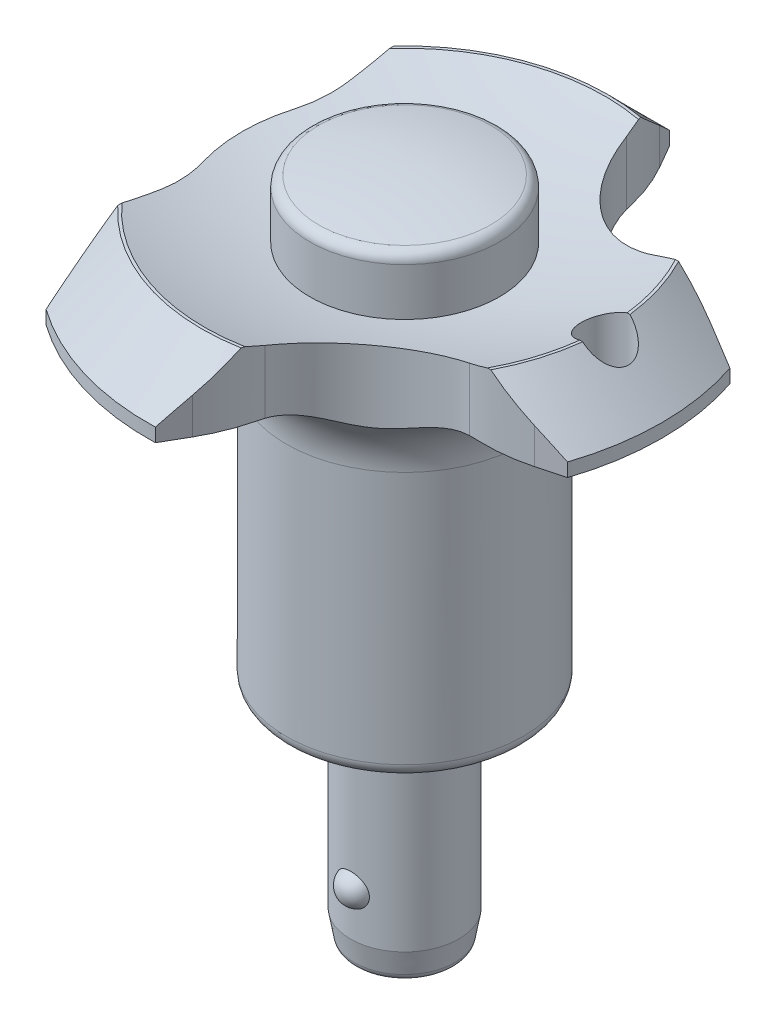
ISO-10303-21;
HEADER;
FILE_DESCRIPTION(('STEP AP214'),'2;1');
FILE_NAME('part.step','',(''),(''),'','','');
FILE_SCHEMA(('AUTOMOTIVE_DESIGN { 1 0 10303 214 1 1 1 1 }'));
ENDSEC;
DATA;
#1=APPLICATION_CONTEXT('core data for automotive mechanical design processes');
#2=APPLICATION_PROTOCOL_DEFINITION('international standard','automotive_design',2000,#1);
#3=PRODUCT_CONTEXT('',#1,'mechanical');
#4=PRODUCT('Part','Part','',(#3));
#5=PRODUCT_RELATED_PRODUCT_CATEGORY('part','',(#4));
#6=PRODUCT_DEFINITION_FORMATION('','',#4);
#7=PRODUCT_DEFINITION_CONTEXT('part definition',#1,'design');
#8=PRODUCT_DEFINITION('design','',#6,#7);
#9=PRODUCT_DEFINITION_SHAPE('','',#8);
#10=(LENGTH_UNIT() NAMED_UNIT(*) SI_UNIT(.MILLI.,.METRE.));
#11=(NAMED_UNIT(*) PLANE_ANGLE_UNIT() SI_UNIT($,.RADIAN.));
#12=(NAMED_UNIT(*) SI_UNIT($,.STERADIAN.) SOLID_ANGLE_UNIT());
#13=UNCERTAINTY_MEASURE_WITH_UNIT(LENGTH_MEASURE(1.E-05),#10,'distance_accuracy_value','');
#14=(GEOMETRIC_REPRESENTATION_CONTEXT(3) GLOBAL_UNCERTAINTY_ASSIGNED_CONTEXT((#13)) GLOBAL_UNIT_ASSIGNED_CONTEXT((#10,
#11,#12)) REPRESENTATION_CONTEXT('',''));
#15=CARTESIAN_POINT('',(0.,0.,0.));
#16=DIRECTION('',(0.,0.,1.));
#17=DIRECTION('',(1.,0.,0.));
#18=AXIS2_PLACEMENT_3D('',#15,#16,#17);
#19=CARTESIAN_POINT('',(0.,33.2,0.));
#20=DIRECTION('',(0.,-1.,0.));
#21=DIRECTION('',(0.,0.,-1.));
#22=AXIS2_PLACEMENT_3D('',#19,#20,#21);
#23=CYLINDRICAL_SURFACE('',#22,7.);
#24=CARTESIAN_POINT('',(0.,31.7572687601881,0.));
#25=DIRECTION('',(0.,-1.,0.));
#26=DIRECTION('',(0.,0.,-1.));
#27=AXIS2_PLACEMENT_3D('',#24,#25,#26);
#28=CIRCLE('',#27,7.);
#29=CARTESIAN_POINT('',(0.,31.7572687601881,-7.));
#30=VERTEX_POINT('',#29);
#31=EDGE_CURVE('P0_E11',#30,#30,#28,.T.);
#32=ORIENTED_EDGE('',*,*,#31,.T.);
#33=EDGE_LOOP('',(#32));
#34=FACE_BOUND('',#33,.T.);
#35=CARTESIAN_POINT('',(0.,15.,0.));
#36=DIRECTION('',(0.,1.,0.));
#37=DIRECTION('',(0.,0.,1.));
#38=AXIS2_PLACEMENT_3D('',#35,#36,#37);
#39=CIRCLE('',#38,7.);
#40=CARTESIAN_POINT('',(0.,15.,7.));
#41=VERTEX_POINT('',#40);
#42=EDGE_CURVE('P0_E48',#41,#41,#39,.T.);
#43=ORIENTED_EDGE('',*,*,#42,.T.);
#44=EDGE_LOOP('',(#43));
#45=FACE_BOUND('',#44,.T.);
#46=ADVANCED_FACE('P0_F16',(#34,#45),#23,.T.);
#47=CARTESIAN_POINT('',(0.,15.,0.));
#48=DIRECTION('',(0.,1.,0.));
#49=DIRECTION('',(0.,0.,1.));
#50=AXIS2_PLACEMENT_3D('',#47,#48,#49);
#51=PLANE('',#50);
#52=ORIENTED_EDGE('',*,*,#42,.F.);
#53=EDGE_LOOP('',(#52));
#54=FACE_BOUND('',#53,.T.);
#55=ADVANCED_FACE('P0_F28',(#54),#51,.F.);
#56=CARTESIAN_POINT('',(0.,2.17499999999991,0.));
#57=DIRECTION('',(0.,1.,0.));
#58=DIRECTION('',(-1.,0.,0.));
#59=AXIS2_PLACEMENT_3D('',#56,#57,#58);
#60=SPHERICAL_SURFACE('',#59,31.0250000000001);
#61=CARTESIAN_POINT('',(0.,32.5402568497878,0.));
#62=DIRECTION('',(0.,-1.,0.));
#63=DIRECTION('',(0.,0.,-1.));
#64=AXIS2_PLACEMENT_3D('',#61,#62,#63);
#65=CIRCLE('',#64,6.36410256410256);
#66=CARTESIAN_POINT('',(0.,32.5402568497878,-6.36410256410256));
#67=VERTEX_POINT('',#66);
#68=EDGE_CURVE('P0_E23',#67,#67,#65,.F.);
#69=ORIENTED_EDGE('',*,*,#68,.T.);
#70=EDGE_LOOP('',(#69));
#71=FACE_BOUND('',#70,.T.);
#72=CARTESIAN_POINT('',(0.,33.2,0.));
#73=VERTEX_POINT('',#72);
#74=VERTEX_LOOP('',#73);
#75=FACE_BOUND('',#74,.T.);
#76=ADVANCED_FACE('P0_F26',(#71,#75),#60,.T.);
#77=CARTESIAN_POINT('',(0.,31.7572687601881,0.));
#78=DIRECTION('',(0.,-1.,0.));
#79=DIRECTION('',(0.,0.,-1.));
#80=AXIS2_PLACEMENT_3D('',#77,#78,#79);
#81=TOROIDAL_SURFACE('',#80,6.2,0.8);
#82=ORIENTED_EDGE('',*,*,#31,.F.);
#83=EDGE_LOOP('',(#82));
#84=FACE_BOUND('',#83,.T.);
#85=ORIENTED_EDGE('',*,*,#68,.F.);
#86=EDGE_LOOP('',(#85));
#87=FACE_BOUND('',#86,.T.);
#88=ADVANCED_FACE('P0_F18',(#84,#87),#81,.T.);
#89=CLOSED_SHELL('',(#46,#55,#76,#88));
#90=MANIFOLD_SOLID_BREP('P0_B1',#89);
#91=CARTESIAN_POINT('',(-19.,30.2,0.));
#92=DIRECTION('',(0.,1.,0.));
#93=DIRECTION('',(-1.,0.,0.));
#94=AXIS2_PLACEMENT_3D('',#91,#92,#93);
#95=PLANE('',#94);
#96=CARTESIAN_POINT('',(0.,30.2,0.));
#97=DIRECTION('',(0.,1.,0.));
#98=DIRECTION('',(-1.,0.,0.));
#99=AXIS2_PLACEMENT_3D('',#96,#97,#98);
#100=CIRCLE('',#99,14.790199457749);
#101=CARTESIAN_POINT('',(14.6866680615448,30.2,-1.74693481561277));
#102=VERTEX_POINT('',#101);
#103=CARTESIAN_POINT('',(13.0598212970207,30.2,-6.94197865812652));
#104=VERTEX_POINT('',#103);
#105=EDGE_CURVE('P1_E287',#102,#104,#100,.T.);
#106=ORIENTED_EDGE('',*,*,#105,.F.);
#107=CARTESIAN_POINT('',(14.790199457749,30.2,0.));
#108=DIRECTION('',(0.,1.,0.));
#109=DIRECTION('',(0.,0.,1.));
#110=AXIS2_PLACEMENT_3D('',#107,#108,#109);
#111=CIRCLE('',#110,1.75);
#112=CARTESIAN_POINT('',(14.8979566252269,30.2,-1.74667924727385));
#113=VERTEX_POINT('',#112);
#114=EDGE_CURVE('P1_E40',#113,#102,#111,.T.);
#115=ORIENTED_EDGE('',*,*,#114,.F.);
#116=CARTESIAN_POINT('',(0.,30.2,0.));
#117=DIRECTION('',(0.,1.,0.));
#118=DIRECTION('',(-1.,0.,0.));
#119=AXIS2_PLACEMENT_3D('',#116,#117,#118);
#120=CIRCLE('',#119,15.);
#121=CARTESIAN_POINT('',(13.300156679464,30.2,-6.93583681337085));
#122=VERTEX_POINT('',#121);
#123=EDGE_CURVE('P1_E231',#113,#122,#120,.T.);
#124=ORIENTED_EDGE('',*,*,#123,.T.);
#125=CARTESIAN_POINT('',(12.8606666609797,30.2,5.55643473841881));
#126=DIRECTION('',(0.,-1.,0.));
#127=DIRECTION('',(0.,0.,-1.));
#128=AXIS2_PLACEMENT_3D('',#125,#126,#127);
#129=CIRCLE('',#128,12.5);
#130=EDGE_CURVE('P1_E520',#104,#122,#129,.T.);
#131=ORIENTED_EDGE('',*,*,#130,.F.);
#132=EDGE_LOOP('',(#106,#115,#124,#131));
#133=FACE_BOUND('',#132,.T.);
#134=ADVANCED_FACE('P1_F16',(#133),#95,.T.);
#135=CARTESIAN_POINT('',(13.3001566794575,30.2,6.9358368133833));
#136=VERTEX_POINT('',#135);
#137=CARTESIAN_POINT('',(14.8979566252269,30.2,1.74667924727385));
#138=VERTEX_POINT('',#137);
#139=EDGE_CURVE('P1_E229',#136,#138,#120,.T.);
#140=ORIENTED_EDGE('',*,*,#139,.T.);
#141=CARTESIAN_POINT('',(14.6866680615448,30.2,1.74693481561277));
#142=VERTEX_POINT('',#141);
#143=EDGE_CURVE('P1_E213',#142,#138,#111,.T.);
#144=ORIENTED_EDGE('',*,*,#143,.F.);
#145=CARTESIAN_POINT('',(13.0598212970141,30.2,6.94197865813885));
#146=VERTEX_POINT('',#145);
#147=EDGE_CURVE('P1_E285',#146,#142,#100,.T.);
#148=ORIENTED_EDGE('',*,*,#147,.F.);
#149=CARTESIAN_POINT('',(12.8606666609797,30.2,-5.55643473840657));
#150=DIRECTION('',(0.,-1.,0.));
#151=DIRECTION('',(0.,0.,1.));
#152=AXIS2_PLACEMENT_3D('',#149,#150,#151);
#153=CIRCLE('',#152,12.5);
#154=EDGE_CURVE('P1_E236',#136,#146,#153,.T.);
#155=ORIENTED_EDGE('',*,*,#154,.F.);
#156=EDGE_LOOP('',(#140,#144,#148,#155));
#157=FACE_BOUND('',#156,.T.);
#158=ADVANCED_FACE('P1_F235',(#157),#95,.T.);
#159=CARTESIAN_POINT('',(-14.25,25.2,0.));
#160=DIRECTION('',(0.,-1.,0.));
#161=DIRECTION('',(1.,0.,0.));
#162=AXIS2_PLACEMENT_3D('',#159,#160,#161);
#163=PLANE('',#162);
#164=CARTESIAN_POINT('',(0.,25.2,0.));
#165=DIRECTION('',(0.,1.,0.));
#166=DIRECTION('',(-1.,0.,0.));
#167=AXIS2_PLACEMENT_3D('',#164,#165,#166);
#168=CIRCLE('',#167,14.25);
#169=CARTESIAN_POINT('',(12.4476557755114,25.2000000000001,6.93674027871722));
#170=VERTEX_POINT('',#169);
#171=CARTESIAN_POINT('',(14.1563337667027,25.2,1.63116960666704));
#172=VERTEX_POINT('',#171);
#173=EDGE_CURVE('P1_E265',#170,#172,#168,.T.);
#174=ORIENTED_EDGE('',*,*,#173,.T.);
#175=CARTESIAN_POINT('',(14.790199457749,25.2,0.));
#176=DIRECTION('',(0.,-1.,0.));
#177=DIRECTION('',(1.,0.,0.));
#178=AXIS2_PLACEMENT_3D('',#175,#176,#177);
#179=CIRCLE('',#178,1.75);
#180=CARTESIAN_POINT('',(14.1563337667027,25.2,-1.63116960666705));
#181=VERTEX_POINT('',#180);
#182=EDGE_CURVE('P1_E32',#172,#181,#179,.F.);
#183=ORIENTED_EDGE('',*,*,#182,.T.);
#184=CARTESIAN_POINT('',(12.4476557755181,25.2,-6.93674027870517));
#185=VERTEX_POINT('',#184);
#186=EDGE_CURVE('P1_E266',#181,#185,#168,.T.);
#187=ORIENTED_EDGE('',*,*,#186,.T.);
#188=CARTESIAN_POINT('',(12.8606666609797,25.2,5.55643473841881));
#189=DIRECTION('',(0.,-1.,0.));
#190=DIRECTION('',(1.,0.,0.));
#191=AXIS2_PLACEMENT_3D('',#188,#189,#190);
#192=CIRCLE('',#191,12.5);
#193=CARTESIAN_POINT('',(16.0959047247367,25.2,-6.51763809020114));
#194=VERTEX_POINT('',#193);
#195=EDGE_CURVE('P1_E1037',#185,#194,#192,.T.);
#196=ORIENTED_EDGE('',*,*,#195,.T.);
#197=DIRECTION('',(0.965925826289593,0.,0.258819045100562));
#198=VECTOR('',#197,1.);
#199=CARTESIAN_POINT('',(-10.5878003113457,25.2,-13.6675153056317));
#200=LINE('',#199,#198);
#201=CARTESIAN_POINT('',(18.0277563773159,25.2,-6.));
#202=VERTEX_POINT('',#201);
#203=EDGE_CURVE('P1_E609',#194,#202,#200,.T.);
#204=ORIENTED_EDGE('',*,*,#203,.T.);
#205=CARTESIAN_POINT('',(0.,25.2,0.));
#206=DIRECTION('',(0.,1.,0.));
#207=DIRECTION('',(-1.,0.,0.));
#208=AXIS2_PLACEMENT_3D('',#205,#206,#207);
#209=CIRCLE('',#208,19.);
#210=CARTESIAN_POINT('',(18.0277563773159,25.2,6.00000000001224));
#211=VERTEX_POINT('',#210);
#212=EDGE_CURVE('P1_E251',#211,#202,#209,.T.);
#213=ORIENTED_EDGE('',*,*,#212,.F.);
#214=DIRECTION('',(-0.965925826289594,0.,0.25881904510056));
#215=VECTOR('',#214,1.);
#216=CARTESIAN_POINT('',(-10.5878003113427,25.2,13.6675153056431));
#217=LINE('',#216,#215);
#218=CARTESIAN_POINT('',(16.0959047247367,25.2,6.51763809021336));
#219=VERTEX_POINT('',#218);
#220=EDGE_CURVE('P1_E512',#211,#219,#217,.T.);
#221=ORIENTED_EDGE('',*,*,#220,.T.);
#222=CARTESIAN_POINT('',(12.8606666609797,25.2,-5.55643473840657));
#223=DIRECTION('',(0.,-1.,0.));
#224=DIRECTION('',(1.,0.,0.));
#225=AXIS2_PLACEMENT_3D('',#222,#223,#224);
#226=CIRCLE('',#225,12.5);
#227=EDGE_CURVE('P1_E679',#219,#170,#226,.T.);
#228=ORIENTED_EDGE('',*,*,#227,.T.);
#229=EDGE_LOOP('',(#174,#183,#187,#196,#204,#213,#221,#228));
#230=FACE_BOUND('',#229,.T.);
#231=ADVANCED_FACE('P1_F733',(#230),#163,.T.);
#232=CARTESIAN_POINT('',(0.,19.7,0.));
#233=DIRECTION('',(0.,1.,0.));
#234=DIRECTION('',(-1.,0.,0.));
#235=AXIS2_PLACEMENT_3D('',#232,#233,#234);
#236=TOROIDAL_SURFACE('',#235,14.25,5.5);
#237=CARTESIAN_POINT('',(0.,19.7,0.));
#238=DIRECTION('',(0.,1.,0.));
#239=DIRECTION('',(-1.,0.,0.));
#240=AXIS2_PLACEMENT_3D('',#237,#238,#239);
#241=CIRCLE('',#240,8.75);
#242=CARTESIAN_POINT('',(-8.75,19.7,0.));
#243=VERTEX_POINT('',#242);
#244=EDGE_CURVE('P1_E274',#243,#243,#241,.T.);
#245=ORIENTED_EDGE('',*,*,#244,.T.);
#246=EDGE_LOOP('',(#245));
#247=FACE_BOUND('',#246,.T.);
#248=ORIENTED_EDGE('',*,*,#186,.F.);
#249=CARTESIAN_POINT('',(14.2502,25.1991429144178,-1.6646022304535));
#250=CARTESIAN_POINT('',(14.2042623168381,25.1999826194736,-1.64970098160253));
#251=CARTESIAN_POINT('',(14.1589561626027,25.2001952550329,-1.63289959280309));
#252=CARTESIAN_POINT('',(14.0699047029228,25.1994597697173,-1.59562095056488));
#253=CARTESIAN_POINT('',(14.0261590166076,25.1985119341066,-1.57514460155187));
#254=CARTESIAN_POINT('',(13.8979419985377,25.1940770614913,-1.5085156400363));
#255=CARTESIAN_POINT('',(13.8162015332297,25.189002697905,-1.4570688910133));
#256=CARTESIAN_POINT('',(13.6625097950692,25.1758106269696,-1.34166462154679));
#257=CARTESIAN_POINT('',(13.5905547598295,25.1676940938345,-1.2777119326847));
#258=CARTESIAN_POINT('',(13.4581285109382,25.1499438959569,-1.13898330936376));
#259=CARTESIAN_POINT('',(13.3976621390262,25.1403095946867,-1.06420283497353));
#260=CARTESIAN_POINT('',(13.2884525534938,25.1209736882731,-0.903822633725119));
#261=CARTESIAN_POINT('',(13.2400286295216,25.1112761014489,-0.818004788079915));
#262=CARTESIAN_POINT('',(13.1581906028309,25.0938088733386,-0.639298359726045));
#263=CARTESIAN_POINT('',(13.1247757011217,25.0860391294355,-0.546410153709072));
#264=CARTESIAN_POINT('',(13.0740128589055,25.0738737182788,-0.356203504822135));
#265=CARTESIAN_POINT('',(13.0566505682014,25.0694750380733,-0.258889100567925));
#266=CARTESIAN_POINT('',(13.0385484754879,25.064883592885,-0.0626413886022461));
#267=CARTESIAN_POINT('',(13.0378045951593,25.0646897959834,0.0362915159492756));
#268=CARTESIAN_POINT('',(13.0527361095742,25.068485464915,0.229974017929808));
#269=CARTESIAN_POINT('',(13.0679443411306,25.0723559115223,0.324762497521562));
#270=CARTESIAN_POINT('',(13.1135594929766,25.0833937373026,0.510409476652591));
#271=CARTESIAN_POINT('',(13.1439686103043,25.0905615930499,0.601267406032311));
#272=CARTESIAN_POINT('',(13.2194330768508,25.1070123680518,0.777474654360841));
#273=CARTESIAN_POINT('',(13.2646222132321,25.1163143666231,0.862764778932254));
#274=CARTESIAN_POINT('',(13.3683648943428,25.1353787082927,1.02476366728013));
#275=CARTESIAN_POINT('',(13.4269226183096,25.1451411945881,1.1014697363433));
#276=CARTESIAN_POINT('',(13.5576641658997,25.1636664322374,1.24624537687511));
#277=CARTESIAN_POINT('',(13.6301729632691,25.1723951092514,1.31402614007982));
#278=CARTESIAN_POINT('',(13.7857547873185,25.1868126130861,1.43644011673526));
#279=CARTESIAN_POINT('',(13.8688152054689,25.1925050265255,1.49108880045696));
#280=CARTESIAN_POINT('',(14.0028942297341,25.1978948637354,1.56381573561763));
#281=CARTESIAN_POINT('',(14.0510697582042,25.1991455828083,1.58715064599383));
#282=CARTESIAN_POINT('',(14.1493071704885,25.2002344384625,1.62929760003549));
#283=CARTESIAN_POINT('',(14.1993667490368,25.200074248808,1.64811497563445));
#284=CARTESIAN_POINT('',(14.2502,25.1991429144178,1.6646022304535));
#285=B_SPLINE_CURVE_WITH_KNOTS('',3,(#249,#250,#251,#252,#253,#254,#255,#256,#257,#258,#259,
#260,#261,#262,#263,#264,#265,#266,#267,#268,#269,#270,#271,#272,#273,#274,#275,#276,#277,#278,
#279,#280,#281,#282,#283,#284),.UNSPECIFIED.,.F.,.F.,(4,2,2,2,2,2,2,2,2,2,2,2,2,2,2,2,2,4),(0.,
0.144809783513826,0.289583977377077,0.578231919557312,0.866768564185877,1.15542654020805,
1.45107354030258,1.74670480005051,2.04207152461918,2.3373657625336,2.6242473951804,
2.91117050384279,3.20076622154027,3.49045259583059,3.78795379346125,4.0851027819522,
4.24551820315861,4.40574334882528),.UNSPECIFIED.);
#286=EDGE_CURVE('P1_E232',#181,#172,#285,.T.);
#287=ORIENTED_EDGE('',*,*,#286,.T.);
#288=ORIENTED_EDGE('',*,*,#173,.F.);
#289=CARTESIAN_POINT('',(14.2502,24.9717309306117,6.86609306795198));
#290=CARTESIAN_POINT('',(14.0793866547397,25.0150346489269,6.88522647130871));
#291=CARTESIAN_POINT('',(13.906667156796,25.0524848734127,6.900953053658));
#292=CARTESIAN_POINT('',(13.5583259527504,25.1151856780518,6.92529634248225));
#293=CARTESIAN_POINT('',(13.3827010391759,25.1404216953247,6.93390457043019));
#294=CARTESIAN_POINT('',(13.0330284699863,25.1777587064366,6.94358053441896));
#295=CARTESIAN_POINT('',(12.8590088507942,25.1900867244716,6.94478048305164));
#296=CARTESIAN_POINT('',(12.5107529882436,25.2018643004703,6.93987786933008));
#297=CARTESIAN_POINT('',(12.3365170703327,25.2013251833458,6.93378173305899));
#298=CARTESIAN_POINT('',(12.0782272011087,25.1906012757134,6.91934094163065));
#299=CARTESIAN_POINT('',(11.9937757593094,25.1855080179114,6.91375527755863));
#300=CARTESIAN_POINT('',(11.824887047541,25.1720758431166,6.90086699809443));
#301=CARTESIAN_POINT('',(11.74045147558,25.1637227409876,6.89355693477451));
#302=CARTESIAN_POINT('',(11.6562800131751,25.1537207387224,6.88540808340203));
#303=B_SPLINE_CURVE_WITH_KNOTS('',3,(#289,#290,#291,#292,#293,#294,#295,#296,#297,#298,#299,
#300,#301,#302),.UNSPECIFIED.,.F.,.F.,(4,2,2,2,2,2,4),(0.,0.5316805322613,1.06399342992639,
1.58677822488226,2.10910291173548,2.36340213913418,2.61882050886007),.UNSPECIFIED.);
#304=CARTESIAN_POINT('',(11.6564800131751,25.1537445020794,6.88542744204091));
#305=VERTEX_POINT('',#304);
#306=EDGE_CURVE('P1_E673',#170,#305,#303,.T.);
#307=ORIENTED_EDGE('',*,*,#306,.T.);
#308=CARTESIAN_POINT('',(11.6566800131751,25.1537682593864,6.88544680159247));
#309=CARTESIAN_POINT('',(11.5594002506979,25.1422170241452,6.87602741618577));
#310=CARTESIAN_POINT('',(11.4622162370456,25.1286218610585,6.8684202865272));
#311=CARTESIAN_POINT('',(11.2682690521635,25.0976778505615,6.85677712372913));
#312=CARTESIAN_POINT('',(11.1715057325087,25.0803304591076,6.85273970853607));
#313=CARTESIAN_POINT('',(10.8826272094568,25.0232534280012,6.8459061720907));
#314=CARTESIAN_POINT('',(10.6913672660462,24.978419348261,6.84833581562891));
#315=CARTESIAN_POINT('',(10.3134871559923,24.8783310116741,6.86648508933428));
#316=CARTESIAN_POINT('',(10.1268470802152,24.8231361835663,6.88213062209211));
#317=CARTESIAN_POINT('',(9.75739324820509,24.7051603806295,6.92601438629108));
#318=CARTESIAN_POINT('',(9.57458205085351,24.6423745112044,6.95426077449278));
#319=CARTESIAN_POINT('',(9.21451205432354,24.5130865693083,7.02261490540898));
#320=CARTESIAN_POINT('',(9.03721777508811,24.4466237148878,7.06261185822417));
#321=CARTESIAN_POINT('',(8.68599997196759,24.3129496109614,7.15446642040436));
#322=CARTESIAN_POINT('',(8.5120767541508,24.2457382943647,7.20632510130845));
#323=CARTESIAN_POINT('',(8.16692767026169,24.1146077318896,7.32220452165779));
#324=CARTESIAN_POINT('',(7.99570322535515,24.0506901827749,7.38623145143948));
#325=CARTESIAN_POINT('',(7.6556057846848,23.9311518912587,7.52704009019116));
#326=CARTESIAN_POINT('',(7.48673142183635,23.8755261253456,7.60381401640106));
#327=CARTESIAN_POINT('',(7.2072473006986,23.794570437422,7.74301998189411));
#328=CARTESIAN_POINT('',(7.09593153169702,23.7653165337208,7.80173499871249));
#329=CARTESIAN_POINT('',(6.87480574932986,23.7149414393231,7.92521803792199));
#330=CARTESIAN_POINT('',(6.76499543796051,23.6938186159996,7.9899848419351));
#331=CARTESIAN_POINT('',(6.54816816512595,23.6613802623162,8.1250385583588));
#332=CARTESIAN_POINT('',(6.4411389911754,23.6500103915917,8.19529247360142));
#333=CARTESIAN_POINT('',(6.23017950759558,23.6378456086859,8.34117425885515));
#334=CARTESIAN_POINT('',(6.12624899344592,23.6370499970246,8.41680177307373));
#335=CARTESIAN_POINT('',(5.92244869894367,23.6461066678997,8.57274294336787));
#336=CARTESIAN_POINT('',(5.82257913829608,23.6559595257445,8.65305685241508));
#337=CARTESIAN_POINT('',(5.62766430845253,23.6854547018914,8.8176065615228));
#338=CARTESIAN_POINT('',(5.53261973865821,23.7050984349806,8.90184292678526));
#339=CARTESIAN_POINT('',(5.25410671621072,23.7768366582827,9.16064349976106));
#340=CARTESIAN_POINT('',(5.07859966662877,23.8416457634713,9.34026674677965));
#341=CARTESIAN_POINT('',(4.76295492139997,23.983991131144,9.69435230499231));
#342=CARTESIAN_POINT('',(4.6210792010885,24.0599787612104,9.86795703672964));
#343=CARTESIAN_POINT('',(4.35338817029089,24.2183718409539,10.2246609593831));
#344=CARTESIAN_POINT('',(4.22759004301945,24.3007840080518,10.4077700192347));
#345=CARTESIAN_POINT('',(3.99189617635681,24.4640334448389,10.783365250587));
#346=CARTESIAN_POINT('',(3.88193483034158,24.5448759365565,10.975808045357));
#347=CARTESIAN_POINT('',(3.67736612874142,24.6990701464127,11.3714451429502));
#348=CARTESIAN_POINT('',(3.58274461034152,24.7724287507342,11.5746292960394));
#349=CARTESIAN_POINT('',(3.4451588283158,24.8787402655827,11.9063480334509));
#350=CARTESIAN_POINT('',(3.39691565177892,24.9159319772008,12.0313525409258));
#351=CARTESIAN_POINT('',(3.30636134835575,24.9847155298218,12.2849736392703));
#352=CARTESIAN_POINT('',(3.26404827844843,25.0163092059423,12.4135890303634));
#353=CARTESIAN_POINT('',(3.18537054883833,25.0730845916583,12.6751677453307));
#354=CARTESIAN_POINT('',(3.14905422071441,25.0982150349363,12.8081569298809));
#355=CARTESIAN_POINT('',(3.08307385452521,25.1407979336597,13.0771429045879));
#356=CARTESIAN_POINT('',(3.05341764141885,25.1582413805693,13.2131430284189));
#357=CARTESIAN_POINT('',(3.02728721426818,25.1713374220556,13.3502980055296));
#358=B_SPLINE_CURVE_WITH_KNOTS('',3,(#308,#309,#310,#311,#312,#313,#314,#315,#316,#317,#318,
#319,#320,#321,#322,#323,#324,#325,#326,#327,#328,#329,#330,#331,#332,#333,#334,#335,#336,#337,
#338,#339,#340,#341,#342,#343,#344,#345,#346,#347,#348,#349,#350,#351,#352,#353,#354,#355,#356,
#357),.UNSPECIFIED.,.F.,.F.,(4,2,2,2,2,2,2,2,2,2,2,2,2,2,2,2,2,2,2,2,2,2,2,2,4),(0.,
0.295159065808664,0.590203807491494,1.17861237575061,1.76374364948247,2.34925424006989,
2.9294124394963,3.50962306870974,4.09012966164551,4.67028311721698,5.05756933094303,
5.44477774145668,5.82981446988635,6.21482572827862,6.5998577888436,6.98494550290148,
7.76013818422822,8.46948591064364,9.17958553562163,9.88665317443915,10.5930642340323,
11.0099916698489,11.4267821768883,11.846783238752,12.2672752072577),.UNSPECIFIED.);
#359=CARTESIAN_POINT('',(3.02732533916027,25.1713182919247,13.3500980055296));
#360=VERTEX_POINT('',#359);
#361=EDGE_CURVE('P1_E505',#305,#360,#358,.T.);
#362=ORIENTED_EDGE('',*,*,#361,.T.);
#363=CARTESIAN_POINT('',(3.02736346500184,25.1712991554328,13.3498980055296));
#364=CARTESIAN_POINT('',(3.01298527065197,25.1785186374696,13.4253331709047));
#365=CARTESIAN_POINT('',(2.99788541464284,25.1843582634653,13.5007611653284));
#366=CARTESIAN_POINT('',(2.96628555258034,25.1933111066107,13.6513637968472));
#367=CARTESIAN_POINT('',(2.9497877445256,25.1964285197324,13.7265386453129));
#368=CARTESIAN_POINT('',(2.91539052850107,25.1999922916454,13.8766301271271));
#369=CARTESIAN_POINT('',(2.8974911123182,25.2004386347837,13.9515467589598));
#370=CARTESIAN_POINT('',(2.86029004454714,25.198702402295,14.1011237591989));
#371=CARTESIAN_POINT('',(2.840986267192,25.19651575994,14.1757835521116));
#372=CARTESIAN_POINT('',(2.82100769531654,25.1930331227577,14.2502));
#373=B_SPLINE_CURVE_WITH_KNOTS('',3,(#363,#364,#365,#366,#367,#368,#369,#370,#371,#372),
.UNSPECIFIED.,.F.,.F.,(4,2,2,2,4),(0.,0.23137741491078,0.462397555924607,0.693419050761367,
0.924797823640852),.UNSPECIFIED.);
#374=CARTESIAN_POINT('',(2.89703894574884,25.2000000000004,13.9524071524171));
#375=VERTEX_POINT('',#374);
#376=EDGE_CURVE('P1_E496',#360,#375,#373,.T.);
#377=ORIENTED_EDGE('',*,*,#376,.T.);
#378=CARTESIAN_POINT('',(-11.,25.2,9.05883546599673));
#379=VERTEX_POINT('',#378);
#380=EDGE_CURVE('P1_E258',#379,#375,#168,.T.);
#381=ORIENTED_EDGE('',*,*,#380,.F.);
#382=CARTESIAN_POINT('',(-11.,24.9921140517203,11.2691840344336));
#383=CARTESIAN_POINT('',(-11.,25.0567843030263,10.9498915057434));
#384=CARTESIAN_POINT('',(-11.,25.1047871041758,10.6273466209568));
#385=CARTESIAN_POINT('',(-11.,25.1717409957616,9.97923980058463));
#386=CARTESIAN_POINT('',(-11.,25.1906796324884,9.65367663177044));
#387=CARTESIAN_POINT('',(-11.,25.2039580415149,8.99956819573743));
#388=CARTESIAN_POINT('',(-11.,25.1981016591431,8.67101974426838));
#389=CARTESIAN_POINT('',(-11.,25.1740146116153,8.17881655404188));
#390=CARTESIAN_POINT('',(-11.,25.1634212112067,8.014726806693));
#391=CARTESIAN_POINT('',(-11.,25.1377182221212,7.68694909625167));
#392=CARTESIAN_POINT('',(-11.,25.122610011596,7.52326102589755));
#393=CARTESIAN_POINT('',(-11.,25.0717669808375,7.03633415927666));
#394=CARTESIAN_POINT('',(-11.,25.0303142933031,6.71369525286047));
#395=CARTESIAN_POINT('',(-11.,24.9367947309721,6.06994764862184));
#396=CARTESIAN_POINT('',(-11.,24.8847251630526,5.74883936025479));
#397=CARTESIAN_POINT('',(-11.,24.7748702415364,5.1068386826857));
#398=CARTESIAN_POINT('',(-11.,24.7170715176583,4.78594864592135));
#399=CARTESIAN_POINT('',(-11.,24.6013192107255,4.14420459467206));
#400=CARTESIAN_POINT('',(-11.,24.5433656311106,3.82335057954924));
#401=CARTESIAN_POINT('',(-11.,24.4336589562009,3.18341475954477));
#402=CARTESIAN_POINT('',(-11.,24.3818564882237,2.86434168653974));
#403=CARTESIAN_POINT('',(-11.,24.2898196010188,2.22446814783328));
#404=CARTESIAN_POINT('',(-11.,24.2495841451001,1.90366783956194));
#405=CARTESIAN_POINT('',(-11.,24.2019503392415,1.42187959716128));
#406=CARTESIAN_POINT('',(-11.,24.1882077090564,1.26151849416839));
#407=CARTESIAN_POINT('',(-11.,24.1653910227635,0.940468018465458));
#408=CARTESIAN_POINT('',(-11.,24.1563167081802,0.779778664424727));
#409=CARTESIAN_POINT('',(-11.,24.143191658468,0.458210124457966));
#410=CARTESIAN_POINT('',(-11.,24.1391403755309,0.297330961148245));
#411=CARTESIAN_POINT('',(-11.,24.1362183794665,-0.0244747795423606));
#412=CARTESIAN_POINT('',(-11.,24.1373476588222,-0.185401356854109));
#413=CARTESIAN_POINT('',(-11.,24.1447228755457,-0.506226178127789));
#414=CARTESIAN_POINT('',(-11.,24.1509398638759,-0.666125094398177));
#415=CARTESIAN_POINT('',(-11.,24.1682055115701,-0.985665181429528));
#416=CARTESIAN_POINT('',(-11.,24.1792544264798,-1.14530633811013));
#417=CARTESIAN_POINT('',(-11.,24.219068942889,-1.62371079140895));
#418=CARTESIAN_POINT('',(-11.,24.2545014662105,-1.94192401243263));
#419=CARTESIAN_POINT('',(-11.,24.3385656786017,-2.57798814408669));
#420=CARTESIAN_POINT('',(-11.,24.3872571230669,-2.89583070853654));
#421=CARTESIAN_POINT('',(-11.,24.4919761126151,-3.5302584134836));
#422=CARTESIAN_POINT('',(-11.,24.548003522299,-3.84684357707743));
#423=CARTESIAN_POINT('',(-11.,24.6620822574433,-4.48207112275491));
#424=CARTESIAN_POINT('',(-11.,24.7201455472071,-4.80071126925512));
#425=CARTESIAN_POINT('',(-11.,24.8324151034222,-5.43871666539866));
#426=CARTESIAN_POINT('',(-11.,24.8866211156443,-5.75808196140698));
#427=CARTESIAN_POINT('',(-11.,24.9859562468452,-6.39733020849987));
#428=CARTESIAN_POINT('',(-11.,25.0311107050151,-6.71720911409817));
#429=CARTESIAN_POINT('',(-11.,25.1077933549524,-7.35857952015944));
#430=CARTESIAN_POINT('',(-11.,25.1393262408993,-7.68007042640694));
#431=CARTESIAN_POINT('',(-11.,25.1697982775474,-8.1171518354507));
#432=CARTESIAN_POINT('',(-11.,25.1766574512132,-8.23220294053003));
#433=CARTESIAN_POINT('',(-11.,25.1878642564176,-8.46246662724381));
#434=CARTESIAN_POINT('',(-11.,25.1922110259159,-8.57767925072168));
#435=CARTESIAN_POINT('',(-11.,25.2011705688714,-8.92329739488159));
#436=CARTESIAN_POINT('',(-11.,25.2017132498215,-9.15382903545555));
#437=CARTESIAN_POINT('',(-11.,25.1903513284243,-9.61413189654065));
#438=CARTESIAN_POINT('',(-11.,25.1784723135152,-9.84390370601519));
#439=CARTESIAN_POINT('',(-11.,25.140740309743,-10.3023467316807));
#440=CARTESIAN_POINT('',(-11.,25.1148864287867,-10.5310178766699));
#441=CARTESIAN_POINT('',(-11.,25.0473132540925,-10.9885778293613));
#442=CARTESIAN_POINT('',(-11.,25.0054249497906,-11.2174421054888));
#443=CARTESIAN_POINT('',(-11.,24.9043006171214,-11.6713763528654));
#444=CARTESIAN_POINT('',(-11.,24.8450629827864,-11.8964459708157));
#445=CARTESIAN_POINT('',(-11.,24.7077839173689,-12.3411322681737));
#446=CARTESIAN_POINT('',(-11.,24.6297189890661,-12.5607417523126));
#447=CARTESIAN_POINT('',(-11.,24.4536618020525,-12.9918183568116));
#448=CARTESIAN_POINT('',(-11.,24.3556774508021,-13.2032886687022));
#449=CARTESIAN_POINT('',(-11.,24.1698924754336,-13.556484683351));
#450=CARTESIAN_POINT('',(-11.,24.0871656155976,-13.7008916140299));
#451=CARTESIAN_POINT('',(-11.,23.9109463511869,-13.9829653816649));
#452=CARTESIAN_POINT('',(-11.,23.8174566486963,-14.1206338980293));
#453=CARTESIAN_POINT('',(-11.,23.6197462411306,-14.3878872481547));
#454=CARTESIAN_POINT('',(-11.,23.5155342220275,-14.5174784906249));
#455=CARTESIAN_POINT('',(-11.,23.2965133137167,-14.7672892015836));
#456=CARTESIAN_POINT('',(-11.,23.1817096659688,-14.887513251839));
#457=CARTESIAN_POINT('',(-11.,22.9406678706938,-15.1183431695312));
#458=CARTESIAN_POINT('',(-11.,22.814331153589,-15.2288464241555));
#459=CARTESIAN_POINT('',(-11.,22.5518429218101,-15.4373981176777));
#460=CARTESIAN_POINT('',(-11.,22.4156964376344,-15.5354528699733));
#461=CARTESIAN_POINT('',(-11.,22.1344061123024,-15.7177182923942));
#462=CARTESIAN_POINT('',(-11.,21.9892620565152,-15.8019286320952));
#463=CARTESIAN_POINT('',(-11.,21.6911496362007,-15.9551204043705));
#464=CARTESIAN_POINT('',(-11.,21.538182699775,-16.0241046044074));
#465=CARTESIAN_POINT('',(-11.,21.2470699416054,-16.1373916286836));
#466=CARTESIAN_POINT('',(-11.,21.1097302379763,-16.1837735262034));
#467=CARTESIAN_POINT('',(-11.,20.8313524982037,-16.2636266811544));
#468=CARTESIAN_POINT('',(-11.,20.6903149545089,-16.2970996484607));
#469=CARTESIAN_POINT('',(-11.,20.405811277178,-16.3506365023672));
#470=CARTESIAN_POINT('',(-11.,20.2623467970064,-16.3707091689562));
#471=CARTESIAN_POINT('',(-11.,19.9741631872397,-16.3971811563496));
#472=CARTESIAN_POINT('',(-11.,19.8294441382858,-16.4035813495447));
#473=CARTESIAN_POINT('',(-11.,19.5542777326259,-16.4026645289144));
#474=CARTESIAN_POINT('',(-11.,19.4238243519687,-16.3966327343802));
#475=CARTESIAN_POINT('',(-11.,19.1638662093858,-16.3734483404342));
#476=CARTESIAN_POINT('',(-11.,19.0343617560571,-16.3562922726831));
#477=CARTESIAN_POINT('',(-11.,18.7773325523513,-16.3110726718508));
#478=CARTESIAN_POINT('',(-11.,18.6498069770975,-16.2830138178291));
#479=CARTESIAN_POINT('',(-11.,18.3975099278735,-16.2163096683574));
#480=CARTESIAN_POINT('',(-11.,18.2727395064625,-16.1776604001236));
#481=CARTESIAN_POINT('',(-11.,18.027459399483,-16.0904491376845));
#482=CARTESIAN_POINT('',(-11.,17.9069305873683,-16.0419409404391));
#483=CARTESIAN_POINT('',(-11.,17.6701345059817,-15.9354155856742));
#484=CARTESIAN_POINT('',(-11.,17.5538687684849,-15.8773950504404));
#485=CARTESIAN_POINT('',(-11.,17.2125645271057,-15.6899905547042));
#486=CARTESIAN_POINT('',(-11.,16.9947530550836,-15.547167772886));
#487=CARTESIAN_POINT('',(-11.,16.5674766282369,-15.2195235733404));
#488=CARTESIAN_POINT('',(-11.,16.3598110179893,-15.0323820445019));
#489=CARTESIAN_POINT('',(-11.,15.9738188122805,-14.6295721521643));
#490=CARTESIAN_POINT('',(-11.,15.7955348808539,-14.4138631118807));
#491=CARTESIAN_POINT('',(-11.,15.5182164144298,-14.0283602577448));
#492=CARTESIAN_POINT('',(-11.,15.4114026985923,-13.8640542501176));
#493=CARTESIAN_POINT('',(-11.,15.2126033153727,-13.5266286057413));
#494=CARTESIAN_POINT('',(-11.,15.1206227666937,-13.3535059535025));
#495=CARTESIAN_POINT('',(-11.,14.9512903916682,-13.0005546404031));
#496=CARTESIAN_POINT('',(-11.,14.8739205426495,-12.8207345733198));
#497=CARTESIAN_POINT('',(-11.,14.7330957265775,-12.4557862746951));
#498=CARTESIAN_POINT('',(-11.,14.669639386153,-12.2706585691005));
#499=CARTESIAN_POINT('',(-11.,14.5325042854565,-11.8193626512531));
#500=CARTESIAN_POINT('',(-11.,14.4653663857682,-11.5511980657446));
#501=CARTESIAN_POINT('',(-11.,14.3550191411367,-11.0098768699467));
#502=CARTESIAN_POINT('',(-11.,14.3118302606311,-10.7367161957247));
#503=CARTESIAN_POINT('',(-11.,14.2466685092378,-10.1861508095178));
#504=CARTESIAN_POINT('',(-11.,14.2248344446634,-9.90873008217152));
#505=CARTESIAN_POINT('',(-11.,14.200147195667,-9.35345519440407));
#506=CARTESIAN_POINT('',(-11.,14.1972707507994,-9.07560198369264));
#507=CARTESIAN_POINT('',(-11.,14.2079234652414,-8.50538399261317));
#508=CARTESIAN_POINT('',(-11.,14.2223389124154,-8.21303845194));
#509=CARTESIAN_POINT('',(-11.,14.2657646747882,-7.62940413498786));
#510=CARTESIAN_POINT('',(-11.,14.2947793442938,-7.33811570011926));
#511=CARTESIAN_POINT('',(-11.,14.3640864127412,-6.75635827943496));
#512=CARTESIAN_POINT('',(-11.,14.4044004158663,-6.46589195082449));
#513=CARTESIAN_POINT('',(-11.,14.4927509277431,-5.88619144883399));
#514=CARTESIAN_POINT('',(-11.,14.5407868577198,-5.59695718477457));
#515=CARTESIAN_POINT('',(-11.,14.6408230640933,-5.01941070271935));
#516=CARTESIAN_POINT('',(-11.,14.692820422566,-4.73109796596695));
#517=CARTESIAN_POINT('',(-11.,14.7968322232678,-4.15446329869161));
#518=CARTESIAN_POINT('',(-11.,14.8488466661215,-3.86614136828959));
#519=CARTESIAN_POINT('',(-11.,14.9485485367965,-3.28921282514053));
#520=CARTESIAN_POINT('',(-11.,14.9962428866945,-3.00060744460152));
#521=CARTESIAN_POINT('',(-11.,15.08301039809,-2.42207235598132));
#522=CARTESIAN_POINT('',(-11.,15.1220839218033,-2.13214270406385));
#523=CARTESIAN_POINT('',(-11.,15.1877312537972,-1.54850674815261));
#524=CARTESIAN_POINT('',(-11.,15.2142043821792,-1.25478867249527));
#525=CARTESIAN_POINT('',(-11.,15.250955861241,-0.666337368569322));
#526=CARTESIAN_POINT('',(-11.,15.26123640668,-0.371604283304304));
#527=CARTESIAN_POINT('',(-11.,15.2642511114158,0.217987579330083));
#528=CARTESIAN_POINT('',(-11.,15.2569833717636,0.512846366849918));
#529=CARTESIAN_POINT('',(-11.,15.2258629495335,1.10168450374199));
#530=CARTESIAN_POINT('',(-11.,15.2020082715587,1.39566374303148));
#531=CARTESIAN_POINT('',(-11.,15.1405496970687,1.98337834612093));
#532=CARTESIAN_POINT('',(-11.,15.102888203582,2.27710744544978));
#533=CARTESIAN_POINT('',(-11.,15.0180025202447,2.8631923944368));
#534=CARTESIAN_POINT('',(-11.,14.9707763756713,3.15554795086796));
#535=CARTESIAN_POINT('',(-11.,14.8712826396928,3.73956613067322));
#536=CARTESIAN_POINT('',(-11.,14.8190118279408,4.03122818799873));
#537=CARTESIAN_POINT('',(-11.,14.713902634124,4.61442779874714));
#538=CARTESIAN_POINT('',(-11.,14.6610642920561,4.90596535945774));
#539=CARTESIAN_POINT('',(-11.,14.5748275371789,5.39900386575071));
#540=CARTESIAN_POINT('',(-11.,14.5404895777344,5.60033768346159));
#541=CARTESIAN_POINT('',(-11.,14.4747988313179,6.00345703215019));
#542=CARTESIAN_POINT('',(-11.,14.4434454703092,6.20524246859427));
#543=CARTESIAN_POINT('',(-11.,14.3850007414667,6.60905235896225));
#544=CARTESIAN_POINT('',(-11.,14.3579014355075,6.81107564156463));
#545=CARTESIAN_POINT('',(-11.,14.3090724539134,7.21577452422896));
#546=CARTESIAN_POINT('',(-11.,14.2873429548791,7.41845014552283));
#547=CARTESIAN_POINT('',(-11.,14.232074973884,8.02591550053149));
#548=CARTESIAN_POINT('',(-11.,14.2082181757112,8.43167372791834));
#549=CARTESIAN_POINT('',(-11.,14.1953179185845,9.24403992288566));
#550=CARTESIAN_POINT('',(-11.,14.2062719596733,9.65064782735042));
#551=CARTESIAN_POINT('',(-11.,14.2565042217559,10.2728500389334));
#552=CARTESIAN_POINT('',(-11.,14.2803170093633,10.4897044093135));
#553=CARTESIAN_POINT('',(-11.,14.3417439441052,10.9213812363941));
#554=CARTESIAN_POINT('',(-11.,14.3793551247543,11.1362041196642));
#555=CARTESIAN_POINT('',(-11.,14.5151208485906,11.7773643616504));
#556=CARTESIAN_POINT('',(-11.,14.6361323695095,12.1992845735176));
#557=CARTESIAN_POINT('',(-11.,14.9237036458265,12.9538158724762));
#558=CARTESIAN_POINT('',(-11.,15.0803198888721,13.2901450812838));
#559=CARTESIAN_POINT('',(-11.,15.3546285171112,13.7715776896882));
#560=CARTESIAN_POINT('',(-11.,15.4525339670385,13.9280947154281));
#561=CARTESIAN_POINT('',(-11.,15.6616620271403,14.2320073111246));
#562=CARTESIAN_POINT('',(-11.,15.7728821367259,14.3794045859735));
#563=CARTESIAN_POINT('',(-11.,15.9868432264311,14.6371402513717));
#564=CARTESIAN_POINT('',(-11.,16.0873843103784,14.7493100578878));
#565=CARTESIAN_POINT('',(-11.,16.2970411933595,14.9653164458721));
#566=CARTESIAN_POINT('',(-11.,16.4061553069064,15.0691546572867));
#567=CARTESIAN_POINT('',(-11.,16.6326933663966,15.2675150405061));
#568=CARTESIAN_POINT('',(-11.,16.7501229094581,15.3620308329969));
#569=CARTESIAN_POINT('',(-11.,16.9926442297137,15.5405531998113));
#570=CARTESIAN_POINT('',(-11.,17.1177322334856,15.6245648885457));
#571=CARTESIAN_POINT('',(-11.,17.3757564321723,15.7816015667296));
#572=CARTESIAN_POINT('',(-11.,17.50873832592,15.8545516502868));
#573=CARTESIAN_POINT('',(-11.,17.7808412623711,15.9877862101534));
#574=CARTESIAN_POINT('',(-11.,17.9199594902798,16.0480764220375));
#575=CARTESIAN_POINT('',(-11.,18.2032644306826,16.1551425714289));
#576=CARTESIAN_POINT('',(-11.,18.3474496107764,16.2019225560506));
#577=CARTESIAN_POINT('',(-11.,18.6396754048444,16.2812716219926));
#578=CARTESIAN_POINT('',(-11.,18.7877155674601,16.3138423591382));
#579=CARTESIAN_POINT('',(-11.,19.0701169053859,16.3615335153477));
#580=CARTESIAN_POINT('',(-11.,19.204225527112,16.3781604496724));
#581=CARTESIAN_POINT('',(-11.,19.4733849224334,16.3994940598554));
#582=CARTESIAN_POINT('',(-11.,19.6084356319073,16.4042015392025));
#583=CARTESIAN_POINT('',(-11.,19.8783792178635,16.4016353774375));
#584=CARTESIAN_POINT('',(-11.,20.0132721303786,16.3943654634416));
#585=CARTESIAN_POINT('',(-11.,20.2818883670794,16.3679469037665));
#586=CARTESIAN_POINT('',(-11.,20.4156117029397,16.3487983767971));
#587=CARTESIAN_POINT('',(-11.,20.6747131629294,16.3000297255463));
#588=CARTESIAN_POINT('',(-11.,20.8001908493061,16.2709359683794));
#589=CARTESIAN_POINT('',(-11.,21.0483588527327,16.2024953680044));
#590=CARTESIAN_POINT('',(-11.,21.1710482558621,16.1631452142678));
#591=CARTESIAN_POINT('',(-11.,21.4128001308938,16.0746424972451));
#592=CARTESIAN_POINT('',(-11.,21.5318634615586,16.0254922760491));
#593=CARTESIAN_POINT('',(-11.,21.7657528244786,15.9178858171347));
#594=CARTESIAN_POINT('',(-11.,21.8805772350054,15.8594260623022));
#595=CARTESIAN_POINT('',(-11.,22.1096769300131,15.7313777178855));
#596=CARTESIAN_POINT('',(-11.,22.2237615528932,15.6614477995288));
#597=CARTESIAN_POINT('',(-11.,22.4461450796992,15.5128978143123));
#598=CARTESIAN_POINT('',(-11.,22.5544418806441,15.4342746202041));
#599=CARTESIAN_POINT('',(-11.,22.8698200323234,15.1865543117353));
#600=CARTESIAN_POINT('',(-11.,23.0676310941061,15.0054694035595));
#601=CARTESIAN_POINT('',(-11.,23.4562962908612,14.5960330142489));
#602=CARTESIAN_POINT('',(-11.,23.6439424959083,14.3646663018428));
#603=CARTESIAN_POINT('',(-11.,23.9849040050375,13.877514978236));
#604=CARTESIAN_POINT('',(-11.,24.1381558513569,13.621686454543));
#605=CARTESIAN_POINT('',(-11.,24.4437796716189,13.0285566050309));
#606=CARTESIAN_POINT('',(-11.,24.5869466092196,12.6865308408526));
#607=CARTESIAN_POINT('',(-11.,24.8244674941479,11.9874225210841));
#608=CARTESIAN_POINT('',(-11.,24.9189557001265,11.6303843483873));
#609=CARTESIAN_POINT('',(-11.,24.9921140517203,11.2691840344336));
#610=B_SPLINE_CURVE_WITH_KNOTS('',3,(#382,#383,#384,#385,#386,#387,#388,#389,#390,#391,#392,
#393,#394,#395,#396,#397,#398,#399,#400,#401,#402,#403,#404,#405,#406,#407,#408,#409,#410,#411,
#412,#413,#414,#415,#416,#417,#418,#419,#420,#421,#422,#423,#424,#425,#426,#427,#428,#429,#430,
#431,#432,#433,#434,#435,#436,#437,#438,#439,#440,#441,#442,#443,#444,#445,#446,#447,#448,#449,
#450,#451,#452,#453,#454,#455,#456,#457,#458,#459,#460,#461,#462,#463,#464,#465,#466,#467,#468,
#469,#470,#471,#472,#473,#474,#475,#476,#477,#478,#479,#480,#481,#482,#483,#484,#485,#486,#487,
#488,#489,#490,#491,#492,#493,#494,#495,#496,#497,#498,#499,#500,#501,#502,#503,#504,#505,#506,
#507,#508,#509,#510,#511,#512,#513,#514,#515,#516,#517,#518,#519,#520,#521,#522,#523,#524,#525,
#526,#527,#528,#529,#530,#531,#532,#533,#534,#535,#536,#537,#538,#539,#540,#541,#542,#543,#544,
#545,#546,#547,#548,#549,#550,#551,#552,#553,#554,#555,#556,#557,#558,#559,#560,#561,#562,#563,
#564,#565,#566,#567,#568,#569,#570,#571,#572,#573,#574,#575,#576,#577,#578,#579,#580,#581,#582,
#583,#584,#585,#586,#587,#588,#589,#590,#591,#592,#593,#594,#595,#596,#597,#598,#599,#600,#601,
#602,#603,#604,#605,#606,#607,#608,#609),.UNSPECIFIED.,.T.,.F.,(4,2,2,2,2,2,2,2,2,2,2,2,2,2,2,2,
2,2,2,2,2,2,2,2,2,2,2,2,2,2,2,2,2,2,2,2,2,2,2,2,2,2,2,2,2,2,2,2,2,2,2,2,2,2,2,2,2,2,2,2,2,2,2,2,
2,2,2,2,2,2,2,2,2,2,2,2,2,2,2,2,2,2,2,2,2,2,2,2,2,2,2,2,2,2,2,2,2,2,2,2,2,2,2,2,2,2,2,2,2,2,2,2,
2,4),(0.,0.976815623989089,1.95404968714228,2.9390290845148,3.43227387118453,3.92536824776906,
4.90094052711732,5.8767605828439,6.85491409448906,7.83304605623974,8.8027031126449,
9.7722732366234,10.2550613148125,10.7378226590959,11.2205313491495,11.7032393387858,
12.1832196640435,12.6632253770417,13.6233298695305,14.5878351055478,15.5523225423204,
16.5239919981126,17.495725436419,18.4646993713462,19.4333391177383,19.7790816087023,
20.1249426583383,20.8162264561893,21.5060890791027,22.1959957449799,22.8933840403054,
23.5908369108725,24.2891647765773,24.9872159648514,25.4860576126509,25.9847742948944,
26.4830901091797,26.981160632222,27.4839791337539,27.9865415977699,28.489116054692,
28.9915990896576,29.4258851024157,29.8601135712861,30.2940572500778,30.7279732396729,
31.1192818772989,31.5107125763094,31.9019754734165,32.2933853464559,32.6827141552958,
33.0721815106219,33.8502776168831,34.6857409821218,35.5224070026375,36.1095976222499,
36.6969904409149,37.2836538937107,37.8702594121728,38.698283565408,39.5270141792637,
40.3610964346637,41.1941551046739,42.071800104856,42.9497070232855,43.8293040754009,
44.708835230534,45.5877246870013,46.4666509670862,47.344143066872,48.2215982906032,
49.105951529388,49.9901848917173,50.8745139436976,51.7589493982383,52.647117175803,
53.5354666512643,54.4243870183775,55.3132451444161,55.9259538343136,56.5385444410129,
57.1499779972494,57.7614316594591,58.9797007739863,60.1978823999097,60.8519467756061,
61.5058706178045,62.8170256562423,63.9253269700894,64.478585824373,65.0317409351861,
65.4832078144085,65.9345861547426,66.3862712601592,66.8377355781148,67.292132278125,
67.7463226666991,68.2003768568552,68.654378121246,69.0592693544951,69.4641332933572,
69.8688712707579,70.2736052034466,70.6595839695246,71.0456874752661,71.4316988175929,
71.8178563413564,72.2188530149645,72.619994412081,73.4214517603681,74.3118469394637,
75.2038716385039,76.3119690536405,77.4169936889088),.UNSPECIFIED.);
#611=CARTESIAN_POINT('',(-11.,25.0560713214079,6.92820323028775));
#612=VERTEX_POINT('',#611);
#613=EDGE_CURVE('P1_E554',#379,#612,#610,.T.);
#614=ORIENTED_EDGE('',*,*,#613,.T.);
#615=CARTESIAN_POINT('',(-11.0000000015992,25.0560961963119,6.92840323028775));
#616=CARTESIAN_POINT('',(-11.0000016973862,25.0375205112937,6.77902194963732));
#617=CARTESIAN_POINT('',(-11.0026732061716,25.0180452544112,6.62978289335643));
#618=CARTESIAN_POINT('',(-11.0133543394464,24.9784592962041,6.33157027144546));
#619=CARTESIAN_POINT('',(-11.0213642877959,24.9583485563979,6.18259672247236));
#620=CARTESIAN_POINT('',(-11.0532604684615,24.8990700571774,5.73800457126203));
#621=CARTESIAN_POINT('',(-11.0850135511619,24.8606847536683,5.44277610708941));
#622=CARTESIAN_POINT('',(-11.1485280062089,24.8111009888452,5.00121455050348));
#623=CARTESIAN_POINT('',(-11.1723663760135,24.7958985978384,4.85415150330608));
#624=CARTESIAN_POINT('',(-11.2253532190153,24.769067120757,4.56065627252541));
#625=CARTESIAN_POINT('',(-11.2545012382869,24.7574377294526,4.41422403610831));
#626=CARTESIAN_POINT('',(-11.3182917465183,24.7384310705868,4.12132175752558));
#627=CARTESIAN_POINT('',(-11.3529670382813,24.7310804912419,3.97485706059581));
#628=CARTESIAN_POINT('',(-11.4089681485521,24.7236838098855,3.75603948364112));
#629=CARTESIAN_POINT('',(-11.4283045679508,24.7218231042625,3.68323096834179));
#630=CARTESIAN_POINT('',(-11.4682967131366,24.7193367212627,3.5379535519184));
#631=CARTESIAN_POINT('',(-11.4889524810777,24.7187110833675,3.46548466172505));
#632=CARTESIAN_POINT('',(-11.5102630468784,24.7187149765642,3.39320566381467));
#633=B_SPLINE_CURVE_WITH_KNOTS('',3,(#615,#616,#617,#618,#619,#620,#621,#622,#623,#624,#625,
#626,#627,#628,#629,#630,#631,#632),.UNSPECIFIED.,.F.,.F.,(4,2,2,2,2,2,2,2,4),(0.,
0.451514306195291,0.903056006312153,1.80027975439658,2.24944035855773,2.69856258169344,
3.15045689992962,3.37650341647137,3.60255715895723),.UNSPECIFIED.);
#634=CARTESIAN_POINT('',(-11.5102040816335,24.7187149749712,3.39340566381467));
#635=VERTEX_POINT('',#634);
#636=EDGE_CURVE('P1_E578',#612,#635,#633,.T.);
#637=ORIENTED_EDGE('',*,*,#636,.T.);
#638=CARTESIAN_POINT('',(0.,24.7187149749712,0.));
#639=DIRECTION('',(0.,-1.,0.));
#640=DIRECTION('',(1.,0.,0.));
#641=AXIS2_PLACEMENT_3D('',#638,#639,#640);
#642=CIRCLE('',#641,12.);
#643=CARTESIAN_POINT('',(-11.5102040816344,24.7187149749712,-3.39340566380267));
#644=VERTEX_POINT('',#643);
#645=EDGE_CURVE('P1_E585',#635,#644,#642,.T.);
#646=ORIENTED_EDGE('',*,*,#645,.T.);
#647=CARTESIAN_POINT('',(-11.5102630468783,24.7187149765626,-3.39320566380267));
#648=CARTESIAN_POINT('',(-11.4889524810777,24.7187110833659,-3.46548466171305));
#649=CARTESIAN_POINT('',(-11.4682967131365,24.7193367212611,-3.53795355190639));
#650=CARTESIAN_POINT('',(-11.4283045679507,24.7218231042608,-3.68323096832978));
#651=CARTESIAN_POINT('',(-11.408968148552,24.7236838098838,-3.7560394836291));
#652=CARTESIAN_POINT('',(-11.3529670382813,24.7310804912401,-3.9748570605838));
#653=CARTESIAN_POINT('',(-11.3182917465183,24.738431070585,-4.12132175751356));
#654=CARTESIAN_POINT('',(-11.2545012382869,24.7574377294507,-4.41422403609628));
#655=CARTESIAN_POINT('',(-11.2253532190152,24.7690671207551,-4.56065627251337));
#656=CARTESIAN_POINT('',(-11.1723663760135,24.7958985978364,-4.85415150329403));
#657=CARTESIAN_POINT('',(-11.1485280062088,24.8111009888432,-5.00121455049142));
#658=CARTESIAN_POINT('',(-11.0850135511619,24.8606847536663,-5.44277610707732));
#659=CARTESIAN_POINT('',(-11.0532604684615,24.8990700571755,-5.73800457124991));
#660=CARTESIAN_POINT('',(-11.0213642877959,24.9583485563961,-6.1825967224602));
#661=CARTESIAN_POINT('',(-11.0133543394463,24.9784592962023,-6.33157027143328));
#662=CARTESIAN_POINT('',(-11.0026732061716,25.0180452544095,-6.62978289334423));
#663=CARTESIAN_POINT('',(-11.0000016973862,25.0375205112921,-6.7790219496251));
#664=CARTESIAN_POINT('',(-11.0000000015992,25.0560961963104,-6.9284032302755));
#665=B_SPLINE_CURVE_WITH_KNOTS('',3,(#647,#648,#649,#650,#651,#652,#653,#654,#655,#656,#657,
#658,#659,#660,#661,#662,#663,#664),.UNSPECIFIED.,.F.,.F.,(4,2,2,2,2,2,2,2,4),(0.,
0.226053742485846,0.452100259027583,0.903994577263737,1.35311680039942,1.80227740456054,
2.69950115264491,3.15104285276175,3.60255715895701),.UNSPECIFIED.);
#666=CARTESIAN_POINT('',(-11.,25.0560713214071,-6.9282032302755));
#667=VERTEX_POINT('',#666);
#668=EDGE_CURVE('P1_E290',#644,#667,#665,.T.);
#669=ORIENTED_EDGE('',*,*,#668,.T.);
#670=CARTESIAN_POINT('',(-11.,24.9921140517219,-11.2691840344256));
#671=CARTESIAN_POINT('',(-11.,24.9457569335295,-11.4980676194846));
#672=CARTESIAN_POINT('',(-11.,24.8908440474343,-11.7252300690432));
#673=CARTESIAN_POINT('',(-11.,24.7625053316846,-12.17419026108));
#674=CARTESIAN_POINT('',(-11.,24.6890897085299,-12.39599088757));
#675=CARTESIAN_POINT('',(-11.,24.5221989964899,-12.8328577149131));
#676=CARTESIAN_POINT('',(-11.,24.4286543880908,-13.047897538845));
#677=CARTESIAN_POINT('',(-11.,24.2207033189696,-13.4676425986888));
#678=CARTESIAN_POINT('',(-11.,24.1063061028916,-13.6723523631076));
#679=CARTESIAN_POINT('',(-11.,23.8961461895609,-14.0049562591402));
#680=CARTESIAN_POINT('',(-11.,23.8061119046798,-14.1364917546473));
#681=CARTESIAN_POINT('',(-11.,23.616143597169,-14.392191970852));
#682=CARTESIAN_POINT('',(-11.,23.5162121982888,-14.5163586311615));
#683=CARTESIAN_POINT('',(-11.,23.3067010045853,-14.7559980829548));
#684=CARTESIAN_POINT('',(-11.,23.1971340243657,-14.8714820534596));
#685=CARTESIAN_POINT('',(-11.,22.9685945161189,-15.0926468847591));
#686=CARTESIAN_POINT('',(-11.,22.8496265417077,-15.1983324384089));
#687=CARTESIAN_POINT('',(-11.,22.6016618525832,-15.3995724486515));
#688=CARTESIAN_POINT('',(-11.,22.4725868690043,-15.4950307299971));
#689=CARTESIAN_POINT('',(-11.,22.2061260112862,-15.673425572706));
#690=CARTESIAN_POINT('',(-11.,22.0687442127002,-15.7563682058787));
#691=CARTESIAN_POINT('',(-11.,21.7865577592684,-15.9085843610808));
#692=CARTESIAN_POINT('',(-11.,21.6417517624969,-15.9778554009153));
#693=CARTESIAN_POINT('',(-11.,21.3459526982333,-16.1016039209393));
#694=CARTESIAN_POINT('',(-11.,21.194960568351,-16.1560836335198));
#695=CARTESIAN_POINT('',(-11.,20.9071439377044,-16.2435849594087));
#696=CARTESIAN_POINT('',(-11.,20.7708698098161,-16.2784247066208));
#697=CARTESIAN_POINT('',(-11.,20.4957225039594,-16.3355713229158));
#698=CARTESIAN_POINT('',(-11.,20.3568496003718,-16.3578795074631));
#699=CARTESIAN_POINT('',(-11.,20.0777210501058,-16.3896449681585));
#700=CARTESIAN_POINT('',(-11.,19.9374662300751,-16.3991095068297));
#701=CARTESIAN_POINT('',(-11.,19.656682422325,-16.4050767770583));
#702=CARTESIAN_POINT('',(-11.,19.5161534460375,-16.4015800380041));
#703=CARTESIAN_POINT('',(-11.,19.2469930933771,-16.3824578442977));
#704=CARTESIAN_POINT('',(-11.,19.1182915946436,-16.3678033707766));
#705=CARTESIAN_POINT('',(-11.,18.8625397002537,-16.3276989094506));
#706=CARTESIAN_POINT('',(-11.,18.7354898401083,-16.3022455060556));
#707=CARTESIAN_POINT('',(-11.,18.4839996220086,-16.2408507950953));
#708=CARTESIAN_POINT('',(-11.,18.3595584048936,-16.2049130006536));
#709=CARTESIAN_POINT('',(-11.,18.1140022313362,-16.1229407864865));
#710=CARTESIAN_POINT('',(-11.,17.9928885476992,-16.076902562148));
#711=CARTESIAN_POINT('',(-11.,17.7534210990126,-15.9746622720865));
#712=CARTESIAN_POINT('',(-11.,17.6351134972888,-15.9183520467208));
#713=CARTESIAN_POINT('',(-11.,17.4033238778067,-15.7965182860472));
#714=CARTESIAN_POINT('',(-11.,17.2898436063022,-15.7309914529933));
#715=CARTESIAN_POINT('',(-11.,16.957655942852,-15.5216176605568));
#716=CARTESIAN_POINT('',(-11.,16.7469352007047,-15.3648620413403));
#717=CARTESIAN_POINT('',(-11.,16.3331427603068,-15.0077586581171));
#718=CARTESIAN_POINT('',(-11.,16.1323510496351,-14.8047976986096));
#719=CARTESIAN_POINT('',(-11.,15.7618900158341,-14.371759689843));
#720=CARTESIAN_POINT('',(-11.,15.5922754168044,-14.141636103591));
#721=CARTESIAN_POINT('',(-11.,15.328022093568,-13.7286856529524));
#722=CARTESIAN_POINT('',(-11.,15.2256941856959,-13.5506829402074));
#723=CARTESIAN_POINT('',(-11.,15.0370895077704,-13.1862961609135));
#724=CARTESIAN_POINT('',(-11.,14.9508183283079,-12.9999092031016));
#725=CARTESIAN_POINT('',(-11.,14.7939632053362,-12.6211292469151));
#726=CARTESIAN_POINT('',(-11.,14.7233482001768,-12.4287490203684));
#727=CARTESIAN_POINT('',(-11.,14.5968014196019,-12.0392643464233));
#728=CARTESIAN_POINT('',(-11.,14.5408694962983,-11.8421599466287));
#729=CARTESIAN_POINT('',(-11.,14.4201946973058,-11.3530346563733));
#730=CARTESIAN_POINT('',(-11.,14.3632442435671,-11.0590802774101));
#731=CARTESIAN_POINT('',(-11.,14.2755590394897,-10.4672921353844));
#732=CARTESIAN_POINT('',(-11.,14.2448377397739,-10.1694564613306));
#733=CARTESIAN_POINT('',(-11.,14.2061265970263,-9.57021366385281));
#734=CARTESIAN_POINT('',(-11.,14.1983022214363,-9.2687962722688));
#735=CARTESIAN_POINT('',(-11.,14.2013060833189,-8.81681702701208));
#736=CARTESIAN_POINT('',(-11.,14.2047665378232,-8.66614798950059));
#737=CARTESIAN_POINT('',(-11.,14.2161509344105,-8.36503238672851));
#738=CARTESIAN_POINT('',(-11.,14.2240732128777,-8.21458575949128));
#739=CARTESIAN_POINT('',(-11.,14.2545912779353,-7.75256728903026));
#740=CARTESIAN_POINT('',(-11.,14.2838090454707,-7.44142878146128));
#741=CARTESIAN_POINT('',(-11.,14.3554051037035,-6.82065099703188));
#742=CARTESIAN_POINT('',(-11.,14.3977875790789,-6.51101222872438));
#743=CARTESIAN_POINT('',(-11.,14.4915738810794,-5.89231944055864));
#744=CARTESIAN_POINT('',(-11.,14.5430008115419,-5.5832690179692));
#745=CARTESIAN_POINT('',(-11.,14.6502529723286,-4.96597868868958));
#746=CARTESIAN_POINT('',(-11.,14.7060779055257,-4.6577387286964));
#747=CARTESIAN_POINT('',(-11.,14.8168556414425,-4.04328609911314));
#748=CARTESIAN_POINT('',(-11.,14.8718118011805,-3.73707405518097));
#749=CARTESIAN_POINT('',(-11.,14.9761002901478,-3.12364936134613));
#750=CARTESIAN_POINT('',(-11.,15.0254324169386,-2.81643667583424));
#751=CARTESIAN_POINT('',(-11.,15.1130261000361,-2.20159636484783));
#752=CARTESIAN_POINT('',(-11.,15.1513300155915,-1.89397501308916));
#753=CARTESIAN_POINT('',(-11.,15.2123990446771,-1.27718555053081));
#754=CARTESIAN_POINT('',(-11.,15.235167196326,-0.968017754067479));
#755=CARTESIAN_POINT('',(-11.,15.2620336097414,-0.348179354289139));
#756=CARTESIAN_POINT('',(-11.,15.2660924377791,-0.0375069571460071));
#757=CARTESIAN_POINT('',(-11.,15.2548302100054,0.583489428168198));
#758=CARTESIAN_POINT('',(-11.,15.2395078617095,0.893813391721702));
#759=CARTESIAN_POINT('',(-11.,15.1916191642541,1.51408899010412));
#760=CARTESIAN_POINT('',(-11.,15.1589964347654,1.82403606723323));
#761=CARTESIAN_POINT('',(-11.,15.0807611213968,2.44225760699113));
#762=CARTESIAN_POINT('',(-11.,15.035146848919,2.7505318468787));
#763=CARTESIAN_POINT('',(-11.,14.9357125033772,3.36836778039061));
#764=CARTESIAN_POINT('',(-11.,14.8818266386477,3.67791849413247));
#765=CARTESIAN_POINT('',(-11.,14.7715309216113,4.29655945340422));
#766=CARTESIAN_POINT('',(-11.,14.715121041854,4.60564969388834));
#767=CARTESIAN_POINT('',(-11.,14.6049519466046,5.22379621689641));
#768=CARTESIAN_POINT('',(-11.,14.5511885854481,5.53285174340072));
#769=CARTESIAN_POINT('',(-11.,14.450911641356,6.15212878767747));
#770=CARTESIAN_POINT('',(-11.,14.4043967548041,6.46235008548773));
#771=CARTESIAN_POINT('',(-11.,14.3451306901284,6.91520870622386));
#772=CARTESIAN_POINT('',(-11.,14.3277739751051,7.05724146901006));
#773=CARTESIAN_POINT('',(-11.,14.2958764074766,7.3416654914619));
#774=CARTESIAN_POINT('',(-11.,14.2813363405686,7.48405683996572));
#775=CARTESIAN_POINT('',(-11.,14.2554979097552,7.76889550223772));
#776=CARTESIAN_POINT('',(-11.,14.2441941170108,7.91134231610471));
#777=CARTESIAN_POINT('',(-11.,14.2251860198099,8.19646392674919));
#778=CARTESIAN_POINT('',(-11.,14.217481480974,8.33913870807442));
#779=CARTESIAN_POINT('',(-11.,14.2003700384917,8.76681920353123));
#780=CARTESIAN_POINT('',(-11.,14.1969057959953,9.05210085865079));
#781=CARTESIAN_POINT('',(-11.,14.2088952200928,9.62242024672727));
#782=CARTESIAN_POINT('',(-11.,14.2243545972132,9.90745788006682));
#783=CARTESIAN_POINT('',(-11.,14.2729063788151,10.4296028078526));
#784=CARTESIAN_POINT('',(-11.,14.3027435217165,10.667008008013));
#785=CARTESIAN_POINT('',(-11.,14.379506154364,11.1390282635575));
#786=CARTESIAN_POINT('',(-11.,14.4264271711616,11.3736440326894));
#787=CARTESIAN_POINT('',(-11.,14.5390768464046,11.8388631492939));
#788=CARTESIAN_POINT('',(-11.,14.6048432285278,12.0694574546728));
#789=CARTESIAN_POINT('',(-11.,14.7565960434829,12.5239051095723));
#790=CARTESIAN_POINT('',(-11.,14.8425759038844,12.7477606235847));
#791=CARTESIAN_POINT('',(-11.,15.0096548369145,13.1264999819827));
#792=CARTESIAN_POINT('',(-11.,15.0857385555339,13.2836053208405));
#793=CARTESIAN_POINT('',(-11.,15.2495757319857,13.5915956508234));
#794=CARTESIAN_POINT('',(-11.,15.3373263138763,13.7424821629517));
#795=CARTESIAN_POINT('',(-11.,15.5245171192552,14.0364330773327));
#796=CARTESIAN_POINT('',(-11.,15.6239344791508,14.1795119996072));
#797=CARTESIAN_POINT('',(-11.,15.8346028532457,14.4566901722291));
#798=CARTESIAN_POINT('',(-11.,15.9458523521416,14.5907905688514));
#799=CARTESIAN_POINT('',(-11.,16.162417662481,14.8291295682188));
#800=CARTESIAN_POINT('',(-11.,16.2661245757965,14.9348317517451));
#801=CARTESIAN_POINT('',(-11.,16.481687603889,15.1376394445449));
#802=CARTESIAN_POINT('',(-11.,16.5935451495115,15.234743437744));
#803=CARTESIAN_POINT('',(-11.,16.8249968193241,15.4193345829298));
#804=CARTESIAN_POINT('',(-11.,16.9445930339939,15.5068191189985));
#805=CARTESIAN_POINT('',(-11.,17.1908938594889,15.6711270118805));
#806=CARTESIAN_POINT('',(-11.,17.3175976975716,15.7479515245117));
#807=CARTESIAN_POINT('',(-11.,17.5781219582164,15.8904037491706));
#808=CARTESIAN_POINT('',(-11.,17.7119794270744,15.9559638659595));
#809=CARTESIAN_POINT('',(-11.,17.9851245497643,16.0744225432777));
#810=CARTESIAN_POINT('',(-11.,18.1244097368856,16.1273267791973));
#811=CARTESIAN_POINT('',(-11.,18.4073252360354,16.2197381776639));
#812=CARTESIAN_POINT('',(-11.,18.5509544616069,16.2592486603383));
#813=CARTESIAN_POINT('',(-11.,18.8413404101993,16.32429043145));
#814=CARTESIAN_POINT('',(-11.,18.9880968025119,16.3498231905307));
#815=CARTESIAN_POINT('',(-11.,19.2682456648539,16.3846369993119));
#816=CARTESIAN_POINT('',(-11.,19.4014661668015,16.3953155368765));
#817=CARTESIAN_POINT('',(-11.,19.668378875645,16.404966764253));
#818=CARTESIAN_POINT('',(-11.,19.8020712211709,16.4039356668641));
#819=CARTESIAN_POINT('',(-11.,20.0687631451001,16.3901748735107));
#820=CARTESIAN_POINT('',(-11.,20.2017631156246,16.3774527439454));
#821=CARTESIAN_POINT('',(-11.,20.4661993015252,16.3404760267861));
#822=CARTESIAN_POINT('',(-11.,20.5976349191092,16.3162171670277));
#823=CARTESIAN_POINT('',(-11.,20.8532660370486,16.2575395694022));
#824=CARTESIAN_POINT('',(-11.,20.9775523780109,16.2235151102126));
#825=CARTESIAN_POINT('',(-11.,21.2229631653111,16.1453975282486));
#826=CARTESIAN_POINT('',(-11.,21.3440864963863,16.1013009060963));
#827=CARTESIAN_POINT('',(-11.,21.5823659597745,16.0035364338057));
#828=CARTESIAN_POINT('',(-11.,21.6995230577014,15.9498709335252));
#829=CARTESIAN_POINT('',(-11.,21.929301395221,15.8334965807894));
#830=CARTESIAN_POINT('',(-11.,22.0419209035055,15.770784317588));
#831=CARTESIAN_POINT('',(-11.,22.2672714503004,15.6337522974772));
#832=CARTESIAN_POINT('',(-11.,22.3797533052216,15.5590224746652));
#833=CARTESIAN_POINT('',(-11.,22.5986003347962,15.4010607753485));
#834=CARTESIAN_POINT('',(-11.,22.7049632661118,15.3178258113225));
#835=CARTESIAN_POINT('',(-11.,23.0141300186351,15.0565831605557));
#836=CARTESIAN_POINT('',(-11.,23.2072230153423,14.8669075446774));
#837=CARTESIAN_POINT('',(-11.,23.5865260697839,14.4387502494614));
#838=CARTESIAN_POINT('',(-11.,23.7691733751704,14.1971460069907));
#839=CARTESIAN_POINT('',(-11.,24.0990041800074,13.6904644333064));
#840=CARTESIAN_POINT('',(-11.,24.2461291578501,13.4253493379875));
#841=CARTESIAN_POINT('',(-11.,24.4753780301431,12.9428045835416));
#842=CARTESIAN_POINT('',(-11.,24.5646577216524,12.7287026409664));
#843=CARTESIAN_POINT('',(-11.,24.7239556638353,12.2933745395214));
#844=CARTESIAN_POINT('',(-11.,24.7939659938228,12.0721454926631));
#845=CARTESIAN_POINT('',(-11.,24.9158178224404,11.6251491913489));
#846=CARTESIAN_POINT('',(-11.,24.9676863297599,11.3993892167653));
#847=CARTESIAN_POINT('',(-11.,25.0548221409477,10.9447367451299));
#848=CARTESIAN_POINT('',(-11.,25.0900889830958,10.7158441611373));
#849=CARTESIAN_POINT('',(-11.,25.1633202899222,10.1087912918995));
#850=CARTESIAN_POINT('',(-11.,25.1885013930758,9.72907286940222));
#851=CARTESIAN_POINT('',(-11.,25.2051903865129,8.96905756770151));
#852=CARTESIAN_POINT('',(-11.,25.1966860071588,8.58876052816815));
#853=CARTESIAN_POINT('',(-11.,25.1530755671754,7.82759344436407));
#854=CARTESIAN_POINT('',(-11.,25.1178139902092,7.44673309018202));
#855=CARTESIAN_POINT('',(-11.,25.050444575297,6.87698164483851));
#856=CARTESIAN_POINT('',(-11.,25.0255495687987,6.68716996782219));
#857=CARTESIAN_POINT('',(-11.,24.9719097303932,6.30811314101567));
#858=CARTESIAN_POINT('',(-11.,24.9431653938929,6.11886792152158));
#859=CARTESIAN_POINT('',(-11.,24.8766469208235,5.70212044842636));
#860=CARTESIAN_POINT('',(-11.,24.8382292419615,5.47472261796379));
#861=CARTESIAN_POINT('',(-11.,24.759088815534,5.02032691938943));
#862=CARTESIAN_POINT('',(-11.,24.7183659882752,4.79332906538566));
#863=CARTESIAN_POINT('',(-11.,24.6365289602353,4.33926514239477));
#864=CARTESIAN_POINT('',(-11.,24.5954145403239,4.11219911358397));
#865=CARTESIAN_POINT('',(-11.,24.5148670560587,3.65775962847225));
#866=CARTESIAN_POINT('',(-11.,24.4754340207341,3.43038616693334));
#867=CARTESIAN_POINT('',(-11.,24.400645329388,2.9765825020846));
#868=CARTESIAN_POINT('',(-11.,24.3652632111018,2.75015674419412));
#869=CARTESIAN_POINT('',(-11.,24.3003614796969,2.29647325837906));
#870=CARTESIAN_POINT('',(-11.,24.2708412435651,2.0692156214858));
#871=CARTESIAN_POINT('',(-11.,24.2196383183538,1.61405414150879));
#872=CARTESIAN_POINT('',(-11.,24.1979469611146,1.38615129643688));
#873=CARTESIAN_POINT('',(-11.,24.1639361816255,0.92963879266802));
#874=CARTESIAN_POINT('',(-11.,24.1516163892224,0.701029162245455));
#875=CARTESIAN_POINT('',(-11.,24.1372814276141,0.242512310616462));
#876=CARTESIAN_POINT('',(-11.,24.1353099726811,0.0126036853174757));
#877=CARTESIAN_POINT('',(-11.,24.1419499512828,-0.447059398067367));
#878=CARTESIAN_POINT('',(-11.,24.1505615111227,-0.676813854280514));
#879=CARTESIAN_POINT('',(-11.,24.1776900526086,-1.13593138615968));
#880=CARTESIAN_POINT('',(-11.,24.1962160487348,-1.36529391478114));
#881=CARTESIAN_POINT('',(-11.,24.2417718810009,-1.82316264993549));
#882=CARTESIAN_POINT('',(-11.,24.2688020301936,-2.05166882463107));
#883=CARTESIAN_POINT('',(-11.,24.3603184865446,-2.73924776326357));
#884=CARTESIAN_POINT('',(-11.,24.4349751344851,-3.19692582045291));
#885=CARTESIAN_POINT('',(-11.,24.5542308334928,-3.88199004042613));
#886=CARTESIAN_POINT('',(-11.,24.5951917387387,-4.11008845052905));
#887=CARTESIAN_POINT('',(-11.,24.6774216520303,-4.56623536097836));
#888=CARTESIAN_POINT('',(-11.,24.7186906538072,-4.79428386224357));
#889=CARTESIAN_POINT('',(-11.,24.8052077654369,-5.28271132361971));
#890=CARTESIAN_POINT('',(-11.,24.8502014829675,-5.54313599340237));
#891=CARTESIAN_POINT('',(-11.,24.9351866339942,-6.06481093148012));
#892=CARTESIAN_POINT('',(-11.,24.9751781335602,-6.32606118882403));
#893=CARTESIAN_POINT('',(-11.,25.0474380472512,-6.84911252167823));
#894=CARTESIAN_POINT('',(-11.,25.0797224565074,-7.11091129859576));
#895=CARTESIAN_POINT('',(-11.,25.1341547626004,-7.63552557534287));
#896=CARTESIAN_POINT('',(-11.,25.1563027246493,-7.89834106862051));
#897=CARTESIAN_POINT('',(-11.,25.2034088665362,-8.68122745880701));
#898=CARTESIAN_POINT('',(-11.,25.2101349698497,-9.20280353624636));
#899=CARTESIAN_POINT('',(-11.,25.1695872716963,-9.98223824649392));
#900=CARTESIAN_POINT('',(-11.,25.1476478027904,-10.2414747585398));
#901=CARTESIAN_POINT('',(-11.,25.0847029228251,-10.7575787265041));
#902=CARTESIAN_POINT('',(-11.,25.0437073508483,-11.0144473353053));
#903=CARTESIAN_POINT('',(-11.,24.9921140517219,-11.2691840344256));
#904=B_SPLINE_CURVE_WITH_KNOTS('',3,(#670,#671,#672,#673,#674,#675,#676,#677,#678,#679,#680,
#681,#682,#683,#684,#685,#686,#687,#688,#689,#690,#691,#692,#693,#694,#695,#696,#697,#698,#699,
#700,#701,#702,#703,#704,#705,#706,#707,#708,#709,#710,#711,#712,#713,#714,#715,#716,#717,#718,
#719,#720,#721,#722,#723,#724,#725,#726,#727,#728,#729,#730,#731,#732,#733,#734,#735,#736,#737,
#738,#739,#740,#741,#742,#743,#744,#745,#746,#747,#748,#749,#750,#751,#752,#753,#754,#755,#756,
#757,#758,#759,#760,#761,#762,#763,#764,#765,#766,#767,#768,#769,#770,#771,#772,#773,#774,#775,
#776,#777,#778,#779,#780,#781,#782,#783,#784,#785,#786,#787,#788,#789,#790,#791,#792,#793,#794,
#795,#796,#797,#798,#799,#800,#801,#802,#803,#804,#805,#806,#807,#808,#809,#810,#811,#812,#813,
#814,#815,#816,#817,#818,#819,#820,#821,#822,#823,#824,#825,#826,#827,#828,#829,#830,#831,#832,
#833,#834,#835,#836,#837,#838,#839,#840,#841,#842,#843,#844,#845,#846,#847,#848,#849,#850,#851,
#852,#853,#854,#855,#856,#857,#858,#859,#860,#861,#862,#863,#864,#865,#866,#867,#868,#869,#870,
#871,#872,#873,#874,#875,#876,#877,#878,#879,#880,#881,#882,#883,#884,#885,#886,#887,#888,#889,
#890,#891,#892,#893,#894,#895,#896,#897,#898,#899,#900,#901,#902,#903),.UNSPECIFIED.,.T.,.F.,(4,
2,2,2,2,2,2,2,2,2,2,2,2,2,2,2,2,2,2,2,2,2,2,2,2,2,2,2,2,2,2,2,2,2,2,2,2,2,2,2,2,2,2,2,2,2,2,2,2,
2,2,2,2,2,2,2,2,2,2,2,2,2,2,2,2,2,2,2,2,2,2,2,2,2,2,2,2,2,2,2,2,2,2,2,2,2,2,2,2,2,2,2,2,2,2,2,2,
2,2,2,2,2,2,2,2,2,2,2,2,2,2,2,2,2,2,2,4),(0.,0.700411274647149,1.4004370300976,2.10292042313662,
2.80509313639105,3.28286437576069,3.76050929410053,4.2375283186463,4.7143176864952,
5.19525653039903,5.67596129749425,6.15675326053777,6.63747261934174,7.05888335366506,
7.48024984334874,7.90137796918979,8.3224888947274,8.71063133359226,9.09889662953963,
9.4870319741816,9.87531377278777,10.2679485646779,10.6607242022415,11.4454138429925,
12.2987173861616,13.1535046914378,13.7686841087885,14.3840773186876,14.9982384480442,
15.6123933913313,16.5092073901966,17.406481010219,18.3102230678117,18.7622968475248,
19.2142021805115,20.1513010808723,21.0886981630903,22.0285255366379,22.9682894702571,
23.9015950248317,24.8349341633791,25.7646390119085,26.6941619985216,27.6256432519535,
28.5571866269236,29.4917846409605,30.426504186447,31.3690856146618,32.3116772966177,
33.2527421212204,34.1936375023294,34.6228819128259,35.0522458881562,35.4808853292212,
35.909496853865,36.7648543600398,37.6204700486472,38.3377407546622,39.0548237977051,
39.7733524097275,40.4916477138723,41.0148791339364,41.5379818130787,42.0600759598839,
42.5821033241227,43.0259058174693,43.4697864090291,43.9137874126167,44.35774023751,
44.8042705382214,45.2506002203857,45.6968191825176,46.1429911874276,46.5434329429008,
46.9440042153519,47.3443164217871,47.7447769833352,48.1309191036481,48.517195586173,
48.9033773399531,49.2897050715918,49.6943973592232,50.0992370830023,50.9081799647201,
51.8135292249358,52.720359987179,53.4153553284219,54.1106359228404,54.8048769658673,
55.4991373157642,56.6387786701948,57.7788351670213,58.9255690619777,59.4998544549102,
60.0740660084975,60.7659045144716,61.4577669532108,62.1500424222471,62.8423298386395,
63.5298001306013,64.2171973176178,64.9038310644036,65.5904376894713,66.2799424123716,
66.969455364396,67.6595963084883,68.3497626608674,69.7404686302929,70.4357348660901,
71.1309869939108,71.923812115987,72.7166267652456,73.5077814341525,74.2989310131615,
75.8598357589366,76.6397629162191,77.4192878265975),.UNSPECIFIED.);
#905=CARTESIAN_POINT('',(-11.,25.2,-9.05883546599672));
#906=VERTEX_POINT('',#905);
#907=EDGE_CURVE('P1_E547',#667,#906,#904,.T.);
#908=ORIENTED_EDGE('',*,*,#907,.T.);
#909=CARTESIAN_POINT('',(2.89703894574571,25.2000000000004,-13.9524071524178));
#910=VERTEX_POINT('',#909);
#911=EDGE_CURVE('P1_E267',#910,#906,#168,.T.);
#912=ORIENTED_EDGE('',*,*,#911,.F.);
#913=CARTESIAN_POINT('',(2.82100769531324,25.1930331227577,-14.2502));
#914=CARTESIAN_POINT('',(2.84098626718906,25.1965157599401,-14.1757835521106));
#915=CARTESIAN_POINT('',(2.86029004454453,25.1987024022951,-14.1011237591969));
#916=CARTESIAN_POINT('',(2.89749111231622,25.2004386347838,-13.9515467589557));
#917=CARTESIAN_POINT('',(2.91539052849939,25.1999922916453,-13.876630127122));
#918=CARTESIAN_POINT('',(2.94978774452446,25.1964285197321,-13.7265386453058));
#919=CARTESIAN_POINT('',(2.96628555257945,25.1933111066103,-13.651363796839));
#920=CARTESIAN_POINT('',(2.99788541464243,25.1843582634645,-13.5007611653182));
#921=CARTESIAN_POINT('',(3.01298527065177,25.1785186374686,-13.4253331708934));
#922=CARTESIAN_POINT('',(3.02736346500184,25.1712991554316,-13.3498980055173));
#923=B_SPLINE_CURVE_WITH_KNOTS('',3,(#913,#914,#915,#916,#917,#918,#919,#920,#921,#922),
.UNSPECIFIED.,.F.,.F.,(4,2,2,2,4),(0.,0.231378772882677,0.462400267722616,0.693420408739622,
0.924797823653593),.UNSPECIFIED.);
#924=CARTESIAN_POINT('',(3.02732533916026,25.1713182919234,-13.3500980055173));
#925=VERTEX_POINT('',#924);
#926=EDGE_CURVE('P1_E613',#910,#925,#923,.T.);
#927=ORIENTED_EDGE('',*,*,#926,.T.);
#928=CARTESIAN_POINT('',(3.02728721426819,25.1713374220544,-13.3502980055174));
#929=CARTESIAN_POINT('',(3.04499625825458,25.1624541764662,-13.2573818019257));
#930=CARTESIAN_POINT('',(3.06431728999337,25.151587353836,-13.1649887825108));
#931=CARTESIAN_POINT('',(3.1060806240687,25.1261737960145,-12.9814555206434));
#932=CARTESIAN_POINT('',(3.12852181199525,25.1116283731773,-12.8903148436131));
#933=CARTESIAN_POINT('',(3.20026172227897,25.0629815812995,-12.6194750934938));
#934=CARTESIAN_POINT('',(3.25407441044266,25.0238181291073,-12.4418499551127));
#935=CARTESIAN_POINT('',(3.37280714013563,24.934571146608,-12.0934385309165));
#936=CARTESIAN_POINT('',(3.43771892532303,24.8844957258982,-11.922647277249));
#937=CARTESIAN_POINT('',(3.57798671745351,24.7760976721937,-11.5880375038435));
#938=CARTESIAN_POINT('',(3.65334903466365,24.7177700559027,-11.4242232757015));
#939=CARTESIAN_POINT('',(3.83679909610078,24.5784349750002,-11.0581516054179));
#940=CARTESIAN_POINT('',(3.94810514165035,24.4956881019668,-10.8581742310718));
#941=CARTESIAN_POINT('',(4.18698964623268,24.3279778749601,-10.4689336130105));
#942=CARTESIAN_POINT('',(4.31458297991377,24.2430125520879,-10.2796803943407));
#943=CARTESIAN_POINT('',(4.58620411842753,24.0793356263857,-9.91190946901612));
#944=CARTESIAN_POINT('',(4.73015449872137,24.0005973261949,-9.73334683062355));
#945=CARTESIAN_POINT('',(5.03633470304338,23.8592354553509,-9.38588554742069));
#946=CARTESIAN_POINT('',(5.19852645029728,23.7965791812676,-9.21696784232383));
#947=CARTESIAN_POINT('',(5.46235208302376,23.7216909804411,-8.96583491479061));
#948=CARTESIAN_POINT('',(5.55735080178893,23.6995361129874,-8.87961298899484));
#949=CARTESIAN_POINT('',(5.75243597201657,23.6649569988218,-8.71102354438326));
#950=CARTESIAN_POINT('',(5.85252156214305,23.6525311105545,-8.62865537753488));
#951=CARTESIAN_POINT('',(6.05665305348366,23.6385160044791,-8.46887267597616));
#952=CARTESIAN_POINT('',(6.16068099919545,23.6368824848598,-8.39143918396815));
#953=CARTESIAN_POINT('',(6.37211692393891,23.6444820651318,-8.24190181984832));
#954=CARTESIAN_POINT('',(6.47952515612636,23.6537159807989,-8.16979834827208));
#955=CARTESIAN_POINT('',(6.69582319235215,23.6821177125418,-8.03203234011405));
#956=CARTESIAN_POINT('',(6.80469340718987,23.701202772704,-7.96632148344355));
#957=CARTESIAN_POINT('',(7.02409068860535,23.7477991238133,-7.84085287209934));
#958=CARTESIAN_POINT('',(7.13461867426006,23.775315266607,-7.78109857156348));
#959=CARTESIAN_POINT('',(7.35760411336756,23.83720669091,-7.66715924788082));
#960=CARTESIAN_POINT('',(7.47006961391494,23.8716279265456,-7.61301543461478));
#961=CARTESIAN_POINT('',(7.6960038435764,23.945394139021,-7.51060573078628));
#962=CARTESIAN_POINT('',(7.80947246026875,23.9847385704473,-7.46233919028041));
#963=CARTESIAN_POINT('',(8.1432448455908,24.104665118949,-7.32928005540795));
#964=CARTESIAN_POINT('',(8.36502639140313,24.1896489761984,-7.25213100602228));
#965=CARTESIAN_POINT('',(8.81388792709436,24.3617313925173,-7.11762394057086));
#966=CARTESIAN_POINT('',(9.04097304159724,24.4488320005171,-7.06028598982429));
#967=CARTESIAN_POINT('',(9.50000074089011,24.6166988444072,-6.96570100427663));
#968=CARTESIAN_POINT('',(9.73190433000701,24.6975011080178,-6.92833123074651));
#969=CARTESIAN_POINT('',(10.2018518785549,24.8465543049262,-6.87401002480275));
#970=CARTESIAN_POINT('',(10.4398862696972,24.9148235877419,-6.85702853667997));
#971=CARTESIAN_POINT('',(10.8410848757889,25.0131431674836,-6.84673303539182));
#972=CARTESIAN_POINT('',(11.0028294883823,25.0483538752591,-6.84742733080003));
#973=CARTESIAN_POINT('',(11.328490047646,25.1089474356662,-6.85880425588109));
#974=CARTESIAN_POINT('',(11.492412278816,25.1342881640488,-6.86952904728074));
#975=CARTESIAN_POINT('',(11.6566800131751,25.1537682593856,-6.88544680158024));
#976=B_SPLINE_CURVE_WITH_KNOTS('',3,(#928,#929,#930,#931,#932,#933,#934,#935,#936,#937,#938,
#939,#940,#941,#942,#943,#944,#945,#946,#947,#948,#949,#950,#951,#952,#953,#954,#955,#956,#957,
#958,#959,#960,#961,#962,#963,#964,#965,#966,#967,#968,#969,#970,#971,#972,#973,#974,#975),
.UNSPECIFIED.,.F.,.F.,(4,2,2,2,2,2,2,2,2,2,2,2,2,2,2,2,2,2,2,2,2,2,2,4),(0.,0.28493487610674,
0.56976824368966,1.13788182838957,1.70557463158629,2.2736117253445,3.00281872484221,
3.732696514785,4.4592531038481,5.18432029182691,5.57445480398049,5.96452347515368,
6.35298994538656,6.74148557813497,7.12676946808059,7.51227549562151,7.90043771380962,
8.28855696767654,9.0366558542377,9.78551023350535,10.5297070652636,11.2728054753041,
11.7688437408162,12.2669764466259),.UNSPECIFIED.);
#977=CARTESIAN_POINT('',(11.6564800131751,25.153744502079,-6.88542744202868));
#978=VERTEX_POINT('',#977);
#979=EDGE_CURVE('P1_E1036',#925,#978,#976,.T.);
#980=ORIENTED_EDGE('',*,*,#979,.T.);
#981=CARTESIAN_POINT('',(11.6562800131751,25.1537207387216,-6.8854080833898));
#982=CARTESIAN_POINT('',(11.8315845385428,25.1745615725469,-6.90241357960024));
#983=CARTESIAN_POINT('',(12.0080531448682,25.1882330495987,-6.91572189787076));
#984=CARTESIAN_POINT('',(12.3619164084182,25.2017619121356,-6.93485822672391));
#985=CARTESIAN_POINT('',(12.5393109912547,25.2016203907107,-6.94068682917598));
#986=CARTESIAN_POINT('',(12.8906975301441,25.1881641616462,-6.94474635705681));
#987=CARTESIAN_POINT('',(13.0646968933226,25.1750691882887,-6.94310237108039));
#988=CARTESIAN_POINT('',(13.4110393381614,25.1365653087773,-6.93264308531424));
#989=CARTESIAN_POINT('',(13.5833831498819,25.1111621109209,-6.92383110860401));
#990=CARTESIAN_POINT('',(13.837539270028,25.064641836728,-6.90561517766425));
#991=CARTESIAN_POINT('',(13.9203969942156,25.0480218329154,-6.89883859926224));
#992=CARTESIAN_POINT('',(14.0857123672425,25.0119702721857,-6.88366897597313));
#993=CARTESIAN_POINT('',(14.1681669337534,24.9925273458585,-6.87526934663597));
#994=CARTESIAN_POINT('',(14.2502,24.9717309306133,-6.86609306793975));
#995=B_SPLINE_CURVE_WITH_KNOTS('',3,(#981,#982,#983,#984,#985,#986,#987,#988,#989,#990,#991,
#992,#993,#994),.UNSPECIFIED.,.F.,.F.,(4,2,2,2,2,2,4),(0.,0.53181813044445,1.06359417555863,
1.58650156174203,2.1091666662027,2.36345226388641,2.61879197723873),.UNSPECIFIED.);
#996=EDGE_CURVE('P1_E369',#978,#185,#995,.T.);
#997=ORIENTED_EDGE('',*,*,#996,.T.);
#998=EDGE_LOOP('',(#248,#287,#288,#307,#362,#377,#381,#614,#637,#646,#669,#908,#912,#927,#980,#997));
#999=FACE_BOUND('',#998,.T.);
#1000=ADVANCED_FACE('P1_F301',(#247,#999),#236,.F.);
#1001=CARTESIAN_POINT('',(0.,30.2,0.));
#1002=DIRECTION('',(0.,-1.,0.));
#1003=DIRECTION('',(1.,0.,0.));
#1004=AXIS2_PLACEMENT_3D('',#1001,#1002,#1003);
#1005=CONICAL_SURFACE('',#1004,15.,0.785398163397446);
#1006=ORIENTED_EDGE('',*,*,#123,.F.);
#1007=CARTESIAN_POINT('',(14.8977537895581,30.2002,-1.74669174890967));
#1008=CARTESIAN_POINT('',(14.9500383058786,30.1486454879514,-1.74346330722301));
#1009=CARTESIAN_POINT('',(15.0023679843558,30.0973137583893,-1.73789294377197));
#1010=CARTESIAN_POINT('',(15.1069445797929,29.9952456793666,-1.7219120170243));
#1011=CARTESIAN_POINT('',(15.1591914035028,29.9445098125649,-1.71149777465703));
#1012=CARTESIAN_POINT('',(15.3162221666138,29.7927709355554,-1.67256996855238));
#1013=CARTESIAN_POINT('',(15.4204917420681,29.693029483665,-1.63641537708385));
#1014=CARTESIAN_POINT('',(15.6131570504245,29.5104076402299,-1.54764224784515));
#1015=CARTESIAN_POINT('',(15.702017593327,29.4268937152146,-1.49733780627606));
#1016=CARTESIAN_POINT('',(15.8734155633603,29.2669898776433,-1.37839489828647));
#1017=CARTESIAN_POINT('',(15.9559711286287,29.1905793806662,-1.30981178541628));
#1018=CARTESIAN_POINT('',(16.0927169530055,29.0648063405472,-1.17176490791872));
#1019=CARTESIAN_POINT('',(16.1490037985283,29.0133159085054,-1.10632756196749));
#1020=CARTESIAN_POINT('',(16.2533632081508,28.9182396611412,-0.964057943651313));
#1021=CARTESIAN_POINT('',(16.3014441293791,28.8746458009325,-0.887237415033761));
#1022=CARTESIAN_POINT('',(16.3787840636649,28.8047426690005,-0.737983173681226));
#1023=CARTESIAN_POINT('',(16.4098764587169,28.7767311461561,-0.667303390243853));
#1024=CARTESIAN_POINT('',(16.4629986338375,28.7289605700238,-0.51996264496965));
#1025=CARTESIAN_POINT('',(16.4850336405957,28.7091967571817,-0.443305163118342));
#1026=CARTESIAN_POINT('',(16.5186620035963,28.6790634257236,-0.285419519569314));
#1027=CARTESIAN_POINT('',(16.5301936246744,28.6687494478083,-0.204167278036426));
#1028=CARTESIAN_POINT('',(16.5416639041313,28.6584902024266,-0.040202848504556));
#1029=CARTESIAN_POINT('',(16.5416070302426,28.6585409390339,0.0425087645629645));
#1030=CARTESIAN_POINT('',(16.5305021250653,28.6684736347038,0.198368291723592));
#1031=CARTESIAN_POINT('',(16.5205304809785,28.6773928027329,0.271659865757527));
#1032=CARTESIAN_POINT('',(16.4918388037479,28.7030962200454,0.415056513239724));
#1033=CARTESIAN_POINT('',(16.4731181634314,28.7198810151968,0.485161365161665));
#1034=CARTESIAN_POINT('',(16.427291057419,28.7610597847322,0.622781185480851));
#1035=CARTESIAN_POINT('',(16.399942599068,28.7856735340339,0.690148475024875));
#1036=CARTESIAN_POINT('',(16.3384348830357,28.841189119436,0.818881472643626));
#1037=CARTESIAN_POINT('',(16.3042720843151,28.872094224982,0.880244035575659));
#1038=CARTESIAN_POINT('',(16.2136473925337,28.9543539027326,1.02289765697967));
#1039=CARTESIAN_POINT('',(16.1541084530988,29.0086179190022,1.10056695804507));
#1040=CARTESIAN_POINT('',(16.0268640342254,29.1252697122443,1.24187135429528));
#1041=CARTESIAN_POINT('',(15.9591412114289,29.1876747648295,1.30547580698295));
#1042=CARTESIAN_POINT('',(15.7942741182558,29.3405844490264,1.43841677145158));
#1043=CARTESIAN_POINT('',(15.6949554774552,29.4334287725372,1.5023491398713));
#1044=CARTESIAN_POINT('',(15.4910670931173,29.6258632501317,1.60763039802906));
#1045=CARTESIAN_POINT('',(15.3864908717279,29.7254617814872,1.64895064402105));
#1046=CARTESIAN_POINT('',(15.2173103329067,29.8882278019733,1.6983711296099));
#1047=CARTESIAN_POINT('',(15.1533421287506,29.9501382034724,1.71314747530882));
#1048=CARTESIAN_POINT('',(15.0254698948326,30.0746647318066,1.73531624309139));
#1049=CARTESIAN_POINT('',(14.9615672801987,30.1372754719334,1.74274689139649));
#1050=CARTESIAN_POINT('',(14.8977537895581,30.2002,1.74669174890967));
#1051=B_SPLINE_CURVE_WITH_KNOTS('',3,(#1007,#1008,#1009,#1010,#1011,#1012,#1013,#1014,#1015,
#1016,#1017,#1018,#1019,#1020,#1021,#1022,#1023,#1024,#1025,#1026,#1027,#1028,#1029,#1030,#1031,
#1032,#1033,#1034,#1035,#1036,#1037,#1038,#1039,#1040,#1041,#1042,#1043,#1044,#1045,#1046,#1047,
#1048,#1049,#1050),.UNSPECIFIED.,.F.,.F.,(4,2,2,2,2,2,2,2,2,2,2,2,2,2,2,2,2,2,2,2,2,4),(0.,
0.220407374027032,0.440982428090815,0.885496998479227,1.27992562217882,1.67317310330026,
1.97362861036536,2.27377627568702,2.51919880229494,2.76447950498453,3.01119274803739,
3.25781087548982,3.48028939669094,3.70278336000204,3.93217533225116,4.16168681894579,
4.49553418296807,4.83010187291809,5.27842586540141,5.72731646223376,5.99776006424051,
6.26678877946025),.UNSPECIFIED.);
#1052=EDGE_CURVE('P1_E216',#113,#138,#1051,.T.);
#1053=ORIENTED_EDGE('',*,*,#1052,.T.);
#1054=ORIENTED_EDGE('',*,*,#139,.F.);
#1055=CARTESIAN_POINT('',(13.29992690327,30.2002,6.93584489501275));
#1056=CARTESIAN_POINT('',(13.5321013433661,29.9981087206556,6.92768357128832));
#1057=CARTESIAN_POINT('',(13.7649910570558,29.7970848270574,6.91301117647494));
#1058=CARTESIAN_POINT('',(14.2310698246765,29.3977504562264,6.8704165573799));
#1059=CARTESIAN_POINT('',(14.4642573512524,29.1994353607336,6.84252086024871));
#1060=CARTESIAN_POINT('',(14.9307409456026,28.8052820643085,6.7732203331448));
#1061=CARTESIAN_POINT('',(15.1640370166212,28.6094439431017,6.73181506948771));
#1062=CARTESIAN_POINT('',(15.6304807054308,28.2200578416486,6.63516023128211));
#1063=CARTESIAN_POINT('',(15.8636270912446,28.0265152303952,6.57988310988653));
#1064=CARTESIAN_POINT('',(16.0961047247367,27.8344163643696,6.5175844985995));
#1065=B_SPLINE_CURVE_WITH_KNOTS('',3,(#1055,#1056,#1057,#1058,#1059,#1060,#1061,#1062,#1063,
#1064),.UNSPECIFIED.,.F.,.F.,(4,2,2,2,4),(0.,0.923694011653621,1.84554280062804,
2.76742118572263,3.69114493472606),.UNSPECIFIED.);
#1066=CARTESIAN_POINT('',(16.0959047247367,27.8345816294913,6.51763809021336));
#1067=VERTEX_POINT('',#1066);
#1068=EDGE_CURVE('P1_E434',#136,#1067,#1065,.T.);
#1069=ORIENTED_EDGE('',*,*,#1068,.T.);
#1070=CARTESIAN_POINT('',(16.0957047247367,27.8347468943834,6.51769168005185));
#1071=CARTESIAN_POINT('',(16.2582431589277,27.7004352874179,6.4741396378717));
#1072=CARTESIAN_POINT('',(16.4203653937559,27.5655849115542,6.4306991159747));
#1073=CARTESIAN_POINT('',(16.743829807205,27.2948952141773,6.34402708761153));
#1074=CARTESIAN_POINT('',(16.905172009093,27.1590559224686,6.30079557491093));
#1075=CARTESIAN_POINT('',(17.2271378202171,26.8864694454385,6.21452509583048));
#1076=CARTESIAN_POINT('',(17.3877614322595,26.7497222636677,6.17148612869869));
#1077=CARTESIAN_POINT('',(17.708345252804,26.4753867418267,6.08558595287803));
#1078=CARTESIAN_POINT('',(17.868305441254,26.3377983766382,6.04272474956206));
#1079=CARTESIAN_POINT('',(18.0279563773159,26.1998271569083,5.99994641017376));
#1080=B_SPLINE_CURVE_WITH_KNOTS('',3,(#1070,#1071,#1072,#1073,#1074,#1075,#1076,#1077,#1078,
#1079),.UNSPECIFIED.,.F.,.F.,(4,2,2,2,4),(0.,0.645905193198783,1.29179099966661,
1.93767428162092,2.58357694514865),.UNSPECIFIED.);
#1081=CARTESIAN_POINT('',(18.0277563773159,26.2,6.00000000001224));
#1082=VERTEX_POINT('',#1081);
#1083=EDGE_CURVE('P1_E453',#1067,#1082,#1080,.T.);
#1084=ORIENTED_EDGE('',*,*,#1083,.T.);
#1085=CARTESIAN_POINT('',(0.,26.2,0.));
#1086=DIRECTION('',(0.,1.,0.));
#1087=DIRECTION('',(-1.,0.,0.));
#1088=AXIS2_PLACEMENT_3D('',#1085,#1086,#1087);
#1089=CIRCLE('',#1088,19.);
#1090=CARTESIAN_POINT('',(18.0277563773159,26.2000000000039,-6.));
#1091=VERTEX_POINT('',#1090);
#1092=EDGE_CURVE('P1_E706',#1091,#1082,#1089,.F.);
#1093=ORIENTED_EDGE('',*,*,#1092,.F.);
#1094=CARTESIAN_POINT('',(18.0279563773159,26.1998271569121,-5.99994641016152));
#1095=CARTESIAN_POINT('',(17.868305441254,26.3377983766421,-6.04272474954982));
#1096=CARTESIAN_POINT('',(17.708345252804,26.4753867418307,-6.08558595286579));
#1097=CARTESIAN_POINT('',(17.3877614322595,26.7497222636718,-6.17148612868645));
#1098=CARTESIAN_POINT('',(17.2271378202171,26.8864694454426,-6.21452509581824));
#1099=CARTESIAN_POINT('',(16.905172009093,27.1590559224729,-6.30079557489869));
#1100=CARTESIAN_POINT('',(16.743829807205,27.2948952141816,-6.34402708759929));
#1101=CARTESIAN_POINT('',(16.4203653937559,27.5655849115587,-6.43069911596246));
#1102=CARTESIAN_POINT('',(16.2582431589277,27.7004352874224,-6.47413963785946));
#1103=CARTESIAN_POINT('',(16.0957047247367,27.834746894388,-6.51769168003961));
#1104=B_SPLINE_CURVE_WITH_KNOTS('',3,(#1094,#1095,#1096,#1097,#1098,#1099,#1100,#1101,#1102,
#1103),.UNSPECIFIED.,.F.,.F.,(4,2,2,2,4),(0.,0.645902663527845,1.29178594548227,
1.93767175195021,2.58357694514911),.UNSPECIFIED.);
#1105=CARTESIAN_POINT('',(16.0959047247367,27.8345816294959,-6.51763809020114));
#1106=VERTEX_POINT('',#1105);
#1107=EDGE_CURVE('P1_E418',#1091,#1106,#1104,.T.);
#1108=ORIENTED_EDGE('',*,*,#1107,.T.);
#1109=CARTESIAN_POINT('',(16.0961047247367,27.8344163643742,-6.51758449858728));
#1110=CARTESIAN_POINT('',(15.8636270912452,28.0265152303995,-6.57988310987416));
#1111=CARTESIAN_POINT('',(15.6304807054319,28.2200578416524,-6.63516023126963));
#1112=CARTESIAN_POINT('',(15.1640370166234,28.6094439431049,-6.73181506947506));
#1113=CARTESIAN_POINT('',(14.9307409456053,28.8052820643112,-6.7732203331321));
#1114=CARTESIAN_POINT('',(14.4642573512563,29.1994353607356,-6.84252086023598));
#1115=CARTESIAN_POINT('',(14.2310698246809,29.397750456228,-6.87041655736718));
#1116=CARTESIAN_POINT('',(13.7649910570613,29.7970848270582,-6.91301117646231));
#1117=CARTESIAN_POINT('',(13.5321013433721,29.998108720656,-6.92768357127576));
#1118=CARTESIAN_POINT('',(13.2999269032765,30.2002,-6.9358448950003));
#1119=B_SPLINE_CURVE_WITH_KNOTS('',3,(#1109,#1110,#1111,#1112,#1113,#1114,#1115,#1116,#1117,
#1118),.UNSPECIFIED.,.F.,.F.,(4,2,2,2,4),(0.,0.923723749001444,1.84560213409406,
2.76745092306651,3.69114493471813),.UNSPECIFIED.);
#1120=EDGE_CURVE('P1_E363',#1106,#122,#1119,.T.);
#1121=ORIENTED_EDGE('',*,*,#1120,.T.);
#1122=EDGE_LOOP('',(#1006,#1053,#1054,#1069,#1084,#1093,#1108,#1121));
#1123=FACE_BOUND('',#1122,.T.);
#1124=ADVANCED_FACE('P1_F227',(#1123),#1005,.T.);
#1125=CARTESIAN_POINT('',(0.,72.7,0.));
#1126=DIRECTION('',(-1.,0.,0.));
#1127=DIRECTION('',(0.,1.,0.));
#1128=AXIS2_PLACEMENT_3D('',#1125,#1126,#1127);
#1129=SPHERICAL_SURFACE('',#1128,45.);
#1130=CARTESIAN_POINT('',(0.,28.2477784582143,0.));
#1131=DIRECTION('',(0.,1.,0.));
#1132=DIRECTION('',(-1.,0.,0.));
#1133=AXIS2_PLACEMENT_3D('',#1130,#1131,#1132);
#1134=CIRCLE('',#1133,7.);
#1135=CARTESIAN_POINT('',(-7.,28.2477784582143,0.));
#1136=VERTEX_POINT('',#1135);
#1137=EDGE_CURVE('P1_E222',#1136,#1136,#1134,.F.);
#1138=ORIENTED_EDGE('',*,*,#1137,.T.);
#1139=EDGE_LOOP('',(#1138));
#1140=FACE_BOUND('',#1139,.T.);
#1141=CARTESIAN_POINT('',(14.6872427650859,30.2002000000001,-1.74696878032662));
#1142=CARTESIAN_POINT('',(14.6361992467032,30.1824364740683,-1.74395854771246));
#1143=CARTESIAN_POINT('',(14.5852929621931,30.1647319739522,-1.73871422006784));
#1144=CARTESIAN_POINT('',(14.4840547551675,30.1295443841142,-1.72377428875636));
#1145=CARTESIAN_POINT('',(14.4337228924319,30.1120613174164,-1.71407822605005));
#1146=CARTESIAN_POINT('',(14.284019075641,30.060092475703,-1.67833093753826));
#1147=CARTESIAN_POINT('',(14.1859757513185,30.0260998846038,-1.64562278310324));
#1148=CARTESIAN_POINT('',(13.9964340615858,29.9604576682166,-1.56305708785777));
#1149=CARTESIAN_POINT('',(13.9049437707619,29.9288109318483,-1.51317881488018));
#1150=CARTESIAN_POINT('',(13.7315622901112,29.8688979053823,-1.39736762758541));
#1151=CARTESIAN_POINT('',(13.6496637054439,29.8406290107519,-1.33144720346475));
#1152=CARTESIAN_POINT('',(13.5008050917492,29.7892910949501,-1.18757074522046));
#1153=CARTESIAN_POINT('',(13.4334418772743,29.7660814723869,-1.11008264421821));
#1154=CARTESIAN_POINT('',(13.3128260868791,29.7245508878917,-0.943621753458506));
#1155=CARTESIAN_POINT('',(13.2595717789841,29.7062293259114,-0.854650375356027));
#1156=CARTESIAN_POINT('',(13.1718654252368,29.676068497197,-0.673116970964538));
#1157=CARTESIAN_POINT('',(13.1365304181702,29.6639246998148,-0.581031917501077));
#1158=CARTESIAN_POINT('',(13.0817647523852,29.6451074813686,-0.391726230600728));
#1159=CARTESIAN_POINT('',(13.0623281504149,29.6384320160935,-0.294507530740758));
#1160=CARTESIAN_POINT('',(13.0406439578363,29.6309848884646,-0.102382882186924));
#1161=CARTESIAN_POINT('',(13.0376651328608,29.6299620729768,-0.00756851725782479));
#1162=CARTESIAN_POINT('',(13.0470433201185,29.6331826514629,0.181200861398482));
#1163=CARTESIAN_POINT('',(13.0593985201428,29.6374254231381,0.275155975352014));
#1164=CARTESIAN_POINT('',(13.0986897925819,29.6509224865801,0.458186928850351));
#1165=CARTESIAN_POINT('',(13.1254184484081,29.6601054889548,0.54731279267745));
#1166=CARTESIAN_POINT('',(13.1923624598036,29.683116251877,0.719700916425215));
#1167=CARTESIAN_POINT('',(13.2325793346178,29.6969445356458,0.802962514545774));
#1168=CARTESIAN_POINT('',(13.326125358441,29.7291301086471,0.963210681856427));
#1169=CARTESIAN_POINT('',(13.3797124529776,29.7475765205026,1.04002848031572));
#1170=CARTESIAN_POINT('',(13.4978019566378,29.7882586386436,1.18357565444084));
#1171=CARTESIAN_POINT('',(13.5623046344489,29.8104944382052,1.25030478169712));
#1172=CARTESIAN_POINT('',(13.7035302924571,29.8592223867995,1.37511162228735));
#1173=CARTESIAN_POINT('',(13.7806795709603,29.8858635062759,1.43264863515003));
#1174=CARTESIAN_POINT('',(13.9426429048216,29.9418505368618,1.53404432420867));
#1175=CARTESIAN_POINT('',(14.0274623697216,29.9711983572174,1.5778932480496));
#1176=CARTESIAN_POINT('',(14.2062544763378,30.0331296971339,1.65265819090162));
#1177=CARTESIAN_POINT('',(14.3004628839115,30.0657977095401,1.68294569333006));
#1178=CARTESIAN_POINT('',(14.4441387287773,30.1156790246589,1.71614868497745));
#1179=CARTESIAN_POINT('',(14.4924264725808,30.1324533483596,1.72517841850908));
#1180=CARTESIAN_POINT('',(14.5895151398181,30.1662004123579,1.73914551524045));
#1181=CARTESIAN_POINT('',(14.6383159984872,30.183173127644,1.74408338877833));
#1182=CARTESIAN_POINT('',(14.6872427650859,30.2002000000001,1.74696878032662));
#1183=B_SPLINE_CURVE_WITH_KNOTS('',3,(#1141,#1142,#1143,#1144,#1145,#1146,#1147,#1148,#1149,
#1150,#1151,#1152,#1153,#1154,#1155,#1156,#1157,#1158,#1159,#1160,#1161,#1162,#1163,#1164,#1165,
#1166,#1167,#1168,#1169,#1170,#1171,#1172,#1173,#1174,#1175,#1176,#1177,#1178,#1179,#1180,#1181,
#1182),.UNSPECIFIED.,.F.,.F.,(4,2,2,2,2,2,2,2,2,2,2,2,2,2,2,2,2,2,2,2,4),(0.,0.162293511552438,
0.324603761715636,0.649340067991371,0.974469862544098,1.29934732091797,1.613524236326,
1.92766256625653,2.22428151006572,2.52078951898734,2.80401057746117,3.08719816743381,
3.36640476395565,3.645642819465,3.93075278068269,4.21586976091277,4.51413172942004,
4.81260571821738,5.12375886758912,5.27934754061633,5.43491680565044),.UNSPECIFIED.);
#1184=EDGE_CURVE('P1_E217',#102,#142,#1183,.T.);
#1185=ORIENTED_EDGE('',*,*,#1184,.F.);
#1186=ORIENTED_EDGE('',*,*,#105,.T.);
#1187=CARTESIAN_POINT('',(11.6562800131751,29.7847079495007,-6.8854080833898));
#1188=CARTESIAN_POINT('',(11.7732586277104,29.8182973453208,-6.8967322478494));
#1189=CARTESIAN_POINT('',(11.8903145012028,29.8521641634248,-6.90639783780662));
#1190=CARTESIAN_POINT('',(12.124410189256,29.9204047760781,-6.92241440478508));
#1191=CARTESIAN_POINT('',(12.2414499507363,29.9547781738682,-6.92876784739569));
#1192=CARTESIAN_POINT('',(12.5926165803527,30.0586815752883,-6.94288797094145));
#1193=CARTESIAN_POINT('',(12.826725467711,30.1289760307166,-6.9457081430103));
#1194=CARTESIAN_POINT('',(13.0604776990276,30.2002,-6.94196818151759));
#1195=B_SPLINE_CURVE_WITH_KNOTS('',3,(#1187,#1188,#1189,#1190,#1191,#1192,#1193,#1194),
.UNSPECIFIED.,.F.,.F.,(4,2,2,4),(0.,0.366675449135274,0.733077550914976,1.46608623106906),.UNSPECIFIED.);
#1196=CARTESIAN_POINT('',(11.6564800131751,29.7847653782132,-6.88542744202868));
#1197=VERTEX_POINT('',#1196);
#1198=EDGE_CURVE('P1_E332',#1197,#104,#1195,.T.);
#1199=ORIENTED_EDGE('',*,*,#1198,.F.);
#1200=CARTESIAN_POINT('',(3.0272872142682,29.8327038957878,-13.3502980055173));
#1201=CARTESIAN_POINT('',(3.06673557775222,29.7709952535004,-13.1432221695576));
#1202=CARTESIAN_POINT('',(3.11455643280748,29.7118265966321,-12.9369560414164));
#1203=CARTESIAN_POINT('',(3.22688924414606,29.5989677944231,-12.5274258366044));
#1204=CARTESIAN_POINT('',(3.29140622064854,29.5452793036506,-12.3241626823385));
#1205=CARTESIAN_POINT('',(3.43715810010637,29.4437442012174,-11.9218589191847));
#1206=CARTESIAN_POINT('',(3.51841686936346,29.3959060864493,-11.7228247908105));
#1207=CARTESIAN_POINT('',(3.69732040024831,29.306556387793,-11.3308109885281));
#1208=CARTESIAN_POINT('',(3.79496338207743,29.2650441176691,-11.1378306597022));
#1209=CARTESIAN_POINT('',(4.00645897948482,29.1886089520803,-10.7589856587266));
#1210=CARTESIAN_POINT('',(4.12034866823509,29.1537015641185,-10.5731385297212));
#1211=CARTESIAN_POINT('',(4.36354550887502,29.0909130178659,-10.210564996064));
#1212=CARTESIAN_POINT('',(4.49285236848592,29.0630317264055,-10.0338384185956));
#1213=CARTESIAN_POINT('',(4.76593527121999,29.014582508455,-9.6911659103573));
#1214=CARTESIAN_POINT('',(4.90969637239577,28.9940071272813,-9.52520913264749));
#1215=CARTESIAN_POINT('',(5.21079831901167,28.9603308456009,-9.20529486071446));
#1216=CARTESIAN_POINT('',(5.36813851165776,28.9472295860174,-9.05133679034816));
#1217=CARTESIAN_POINT('',(5.68865784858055,28.9290035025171,-8.76263406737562));
#1218=CARTESIAN_POINT('',(5.85134920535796,28.9235796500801,-8.62736628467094));
#1219=CARTESIAN_POINT('',(6.18698922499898,28.9197863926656,-8.37011170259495));
#1220=CARTESIAN_POINT('',(6.35993767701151,28.9214168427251,-8.24812463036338));
#1221=CARTESIAN_POINT('',(6.71483591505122,28.9317178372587,-8.018303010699));
#1222=CARTESIAN_POINT('',(6.89678724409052,28.9403895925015,-7.91047090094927));
#1223=CARTESIAN_POINT('',(7.2682871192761,28.9646944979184,-7.70971982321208));
#1224=CARTESIAN_POINT('',(7.45783553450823,28.9803275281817,-7.61680059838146));
#1225=CARTESIAN_POINT('',(7.83967686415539,29.0180745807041,-7.44795344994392));
#1226=CARTESIAN_POINT('',(8.0318613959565,29.0400686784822,-7.37175328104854));
#1227=CARTESIAN_POINT('',(8.42079382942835,29.0904476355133,-7.23466151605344));
#1228=CARTESIAN_POINT('',(8.61754176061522,29.1188325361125,-7.17377001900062));
#1229=CARTESIAN_POINT('',(9.01421753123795,29.1817598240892,-7.06751689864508));
#1230=CARTESIAN_POINT('',(9.2141453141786,29.216302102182,-7.02215499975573));
#1231=CARTESIAN_POINT('',(9.61574941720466,29.2912539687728,-6.94703439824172));
#1232=CARTESIAN_POINT('',(9.81742539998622,29.3316624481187,-6.91727275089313));
#1233=CARTESIAN_POINT('',(10.2937369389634,29.433559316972,-6.86539186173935));
#1234=CARTESIAN_POINT('',(10.5686216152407,29.497412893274,-6.84983221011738));
#1235=CARTESIAN_POINT('',(10.9788271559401,29.6001658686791,-6.84759185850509));
#1236=CARTESIAN_POINT('',(11.1150820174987,29.6355425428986,-6.85034915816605));
#1237=CARTESIAN_POINT('',(11.3866532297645,29.7085301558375,-6.86275724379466));
#1238=CARTESIAN_POINT('',(11.5219697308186,29.7461407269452,-6.87240689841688));
#1239=CARTESIAN_POINT('',(11.6566800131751,29.7848228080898,-6.88544680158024));
#1240=B_SPLINE_CURVE_WITH_KNOTS('',3,(#1200,#1201,#1202,#1203,#1204,#1205,#1206,#1207,#1208,
#1209,#1210,#1211,#1212,#1213,#1214,#1215,#1216,#1217,#1218,#1219,#1220,#1221,#1222,#1223,#1224,
#1225,#1226,#1227,#1228,#1229,#1230,#1231,#1232,#1233,#1234,#1235,#1236,#1237,#1238,#1239),
.UNSPECIFIED.,.F.,.F.,(4,2,2,2,2,2,2,2,2,2,2,2,2,2,2,2,2,2,2,4),(0.,0.658805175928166,
1.31780867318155,1.97775819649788,2.63763607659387,3.29904455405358,3.96044049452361,
4.62115961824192,5.28184699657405,5.91601787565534,6.55017572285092,7.18444263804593,
7.81869862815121,8.44170004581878,9.06470549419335,9.68769988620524,10.3105766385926,
11.1566419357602,11.5788836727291,12.0010561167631),.UNSPECIFIED.);
#1241=CARTESIAN_POINT('',(3.02732533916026,29.8326443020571,-13.3500980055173));
#1242=VERTEX_POINT('',#1241);
#1243=EDGE_CURVE('P1_E340',#1242,#1197,#1240,.T.);
#1244=ORIENTED_EDGE('',*,*,#1243,.F.);
#1245=CARTESIAN_POINT('',(2.7410547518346,30.2002,-14.5345663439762));
#1246=CARTESIAN_POINT('',(2.79829048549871,30.1373258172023,-14.3399198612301));
#1247=CARTESIAN_POINT('',(2.85076741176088,30.0752541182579,-14.1438742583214));
#1248=CARTESIAN_POINT('',(2.94620364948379,29.9527156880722,-13.7489848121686));
#1249=CARTESIAN_POINT('',(2.98916296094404,29.8922489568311,-13.5501409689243));
#1250=CARTESIAN_POINT('',(3.02736346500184,29.8325847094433,-13.3498980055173));
#1251=B_SPLINE_CURVE_WITH_KNOTS('',3,(#1245,#1246,#1247,#1248,#1249,#1250),.UNSPECIFIED.,.F.,
.F.,(4,2,4),(0.,0.636683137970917,1.27336627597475),.UNSPECIFIED.);
#1252=CARTESIAN_POINT('',(2.74123673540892,30.2,-14.533947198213));
#1253=VERTEX_POINT('',#1252);
#1254=EDGE_CURVE('P1_E626',#1253,#1242,#1251,.T.);
#1255=ORIENTED_EDGE('',*,*,#1254,.F.);
#1256=CARTESIAN_POINT('',(-11.,30.2,-9.88685996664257));
#1257=VERTEX_POINT('',#1256);
#1258=EDGE_CURVE('P1_E288',#1253,#1257,#100,.T.);
#1259=ORIENTED_EDGE('',*,*,#1258,.T.);
#1260=CARTESIAN_POINT('',(-11.,72.7,0.));
#1261=DIRECTION('',(-1.,0.,0.));
#1262=DIRECTION('',(0.,0.,1.));
#1263=AXIS2_PLACEMENT_3D('',#1260,#1261,#1262);
#1264=CIRCLE('',#1263,43.6348484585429);
#1265=CARTESIAN_POINT('',(-11.,29.618681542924,-6.9282032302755));
#1266=VERTEX_POINT('',#1265);
#1267=EDGE_CURVE('P1_E327',#1266,#1257,#1264,.F.);
#1268=ORIENTED_EDGE('',*,*,#1267,.F.);
#1269=CARTESIAN_POINT('',(-11.5102630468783,29.3295031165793,-3.39320566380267));
#1270=CARTESIAN_POINT('',(-11.4251052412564,29.3294814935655,-3.68188771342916));
#1271=CARTESIAN_POINT('',(-11.3504591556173,29.3356380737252,-3.97365458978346));
#1272=CARTESIAN_POINT('',(-11.2228846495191,29.3600842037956,-4.55936247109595));
#1273=CARTESIAN_POINT('',(-11.1698150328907,29.3782927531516,-4.85327609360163));
#1274=CARTESIAN_POINT('',(-11.0849495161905,29.4266227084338,-5.44316934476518));
#1275=CARTESIAN_POINT('',(-11.0531530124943,29.4567437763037,-5.73914891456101));
#1276=CARTESIAN_POINT('',(-11.0105852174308,29.5288487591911,-6.33320147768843));
#1277=CARTESIAN_POINT('',(-10.9999561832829,29.5709107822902,-6.63127521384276));
#1278=CARTESIAN_POINT('',(-11.0000000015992,29.6187137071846,-6.9284032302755));
#1279=B_SPLINE_CURVE_WITH_KNOTS('',3,(#1269,#1270,#1271,#1272,#1273,#1274,#1275,#1276,#1277,
#1278),.UNSPECIFIED.,.F.,.F.,(4,2,2,2,4),(0.,0.902658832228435,1.79931172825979,
2.69593918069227,3.59857240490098),.UNSPECIFIED.);
#1280=CARTESIAN_POINT('',(-11.5102040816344,29.3295031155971,-3.39340566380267));
#1281=VERTEX_POINT('',#1280);
#1282=EDGE_CURVE('P1_E320',#1281,#1266,#1279,.T.);
#1283=ORIENTED_EDGE('',*,*,#1282,.F.);
#1284=CARTESIAN_POINT('',(0.,29.3295031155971,0.));
#1285=DIRECTION('',(0.,1.,0.));
#1286=DIRECTION('',(0.,0.,1.));
#1287=AXIS2_PLACEMENT_3D('',#1284,#1285,#1286);
#1288=CIRCLE('',#1287,12.);
#1289=CARTESIAN_POINT('',(-11.5102040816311,29.3295031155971,3.39340566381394));
#1290=VERTEX_POINT('',#1289);
#1291=EDGE_CURVE('P1_E703',#1290,#1281,#1288,.F.);
#1292=ORIENTED_EDGE('',*,*,#1291,.F.);
#1293=CARTESIAN_POINT('',(-11.0000000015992,29.6187137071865,6.92840323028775));
#1294=CARTESIAN_POINT('',(-10.9999561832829,29.5709107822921,6.631275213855));
#1295=CARTESIAN_POINT('',(-11.0105852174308,29.5288487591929,6.33320147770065));
#1296=CARTESIAN_POINT('',(-11.0531530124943,29.4567437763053,5.7391489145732));
#1297=CARTESIAN_POINT('',(-11.0849495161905,29.4266227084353,5.44316934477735));
#1298=CARTESIAN_POINT('',(-11.1698150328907,29.378292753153,4.85327609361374));
#1299=CARTESIAN_POINT('',(-11.2228846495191,29.3600842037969,4.55936247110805));
#1300=CARTESIAN_POINT('',(-11.3504591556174,29.3356380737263,3.97365458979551));
#1301=CARTESIAN_POINT('',(-11.4251052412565,29.3294814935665,3.68188771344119));
#1302=CARTESIAN_POINT('',(-11.5102630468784,29.3295031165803,3.39320566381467));
#1303=B_SPLINE_CURVE_WITH_KNOTS('',3,(#1293,#1294,#1295,#1296,#1297,#1298,#1299,#1300,#1301,
#1302),.UNSPECIFIED.,.F.,.F.,(4,2,2,2,4),(0.,0.9026332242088,1.79926067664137,2.69591357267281,
3.59857240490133),.UNSPECIFIED.);
#1304=CARTESIAN_POINT('',(-11.,29.6186815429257,6.92820323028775));
#1305=VERTEX_POINT('',#1304);
#1306=EDGE_CURVE('P1_E572',#1305,#1290,#1303,.T.);
#1307=ORIENTED_EDGE('',*,*,#1306,.F.);
#1308=CARTESIAN_POINT('',(-11.,72.7,0.));
#1309=DIRECTION('',(-1.,0.,0.));
#1310=DIRECTION('',(0.,0.,1.));
#1311=AXIS2_PLACEMENT_3D('',#1308,#1309,#1310);
#1312=CIRCLE('',#1311,43.6348484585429);
#1313=CARTESIAN_POINT('',(-11.,30.2,9.88685996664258));
#1314=VERTEX_POINT('',#1313);
#1315=EDGE_CURVE('P1_E328',#1314,#1305,#1312,.F.);
#1316=ORIENTED_EDGE('',*,*,#1315,.F.);
#1317=CARTESIAN_POINT('',(2.74123673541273,30.2,14.5339471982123));
#1318=VERTEX_POINT('',#1317);
#1319=EDGE_CURVE('P1_E281',#1314,#1318,#100,.T.);
#1320=ORIENTED_EDGE('',*,*,#1319,.T.);
#1321=CARTESIAN_POINT('',(3.02736346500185,29.8325847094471,13.3498980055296));
#1322=CARTESIAN_POINT('',(2.98916296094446,29.8922489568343,13.5501409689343));
#1323=CARTESIAN_POINT('',(2.94620364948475,29.9527156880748,13.7489848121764));
#1324=CARTESIAN_POINT('',(2.85076741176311,30.0752541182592,14.1438742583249));
#1325=CARTESIAN_POINT('',(2.79829048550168,30.137325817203,14.3399198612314));
#1326=CARTESIAN_POINT('',(2.74105475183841,30.2002,14.5345663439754));
#1327=B_SPLINE_CURVE_WITH_KNOTS('',3,(#1321,#1322,#1323,#1324,#1325,#1326),.UNSPECIFIED.,.F.,
.F.,(4,2,4),(0.,0.636683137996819,1.27336627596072),.UNSPECIFIED.);
#1328=CARTESIAN_POINT('',(3.02732533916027,29.8326443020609,13.3500980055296));
#1329=VERTEX_POINT('',#1328);
#1330=EDGE_CURVE('P1_E490',#1329,#1318,#1327,.T.);
#1331=ORIENTED_EDGE('',*,*,#1330,.F.);
#1332=CARTESIAN_POINT('',(11.6566800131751,29.7848228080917,6.88544680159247));
#1333=CARTESIAN_POINT('',(11.4473323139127,29.724699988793,6.86515712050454));
#1334=CARTESIAN_POINT('',(11.2364201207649,29.6671530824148,6.85309437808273));
#1335=CARTESIAN_POINT('',(10.8128097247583,29.5576007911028,6.84575295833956));
#1336=CARTESIAN_POINT('',(10.6001110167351,29.5055970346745,6.85047919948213));
#1337=CARTESIAN_POINT('',(10.1741131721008,29.4074915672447,6.8770758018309));
#1338=CARTESIAN_POINT('',(9.96081361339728,29.3613977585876,6.89896884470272));
#1339=CARTESIAN_POINT('',(9.53543669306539,29.2755751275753,6.96008415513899));
#1340=CARTESIAN_POINT('',(9.32335920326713,29.2358456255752,6.9993045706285));
#1341=CARTESIAN_POINT('',(8.9014995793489,29.1630065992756,7.09519110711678));
#1342=CARTESIAN_POINT('',(8.69172375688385,29.1299123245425,7.15189667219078));
#1343=CARTESIAN_POINT('',(8.27659229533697,29.0707582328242,7.28254807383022));
#1344=CARTESIAN_POINT('',(8.07123658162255,29.0446982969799,7.35649361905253));
#1345=CARTESIAN_POINT('',(7.66678422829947,28.9998803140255,7.52117605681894));
#1346=CARTESIAN_POINT('',(7.46768158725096,28.9811150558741,7.61189623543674));
#1347=CARTESIAN_POINT('',(7.07714465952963,28.9510324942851,7.80960879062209));
#1348=CARTESIAN_POINT('',(6.88571002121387,28.9397148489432,7.91660041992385));
#1349=CARTESIAN_POINT('',(6.51924810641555,28.9249277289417,8.1416799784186));
#1350=CARTESIAN_POINT('',(6.34387301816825,28.9211733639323,8.25918346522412));
#1351=CARTESIAN_POINT('',(6.00295478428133,28.9206871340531,8.50769013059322));
#1352=CARTESIAN_POINT('',(5.83741146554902,28.9239551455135,8.63869307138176));
#1353=CARTESIAN_POINT('',(5.51733111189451,28.937484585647,8.9132380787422));
#1354=CARTESIAN_POINT('',(5.36279596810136,28.9477472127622,9.05678229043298));
#1355=CARTESIAN_POINT('',(5.0658396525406,28.975172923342,9.35528053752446));
#1356=CARTESIAN_POINT('',(4.92341830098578,28.9923359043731,9.51023440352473));
#1357=CARTESIAN_POINT('',(4.65364430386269,29.0331016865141,9.82795903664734));
#1358=CARTESIAN_POINT('',(4.5260988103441,29.0566047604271,9.99057899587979));
#1359=CARTESIAN_POINT('',(4.28440539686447,29.1099571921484,10.3244967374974));
#1360=CARTESIAN_POINT('',(4.17025760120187,29.1398066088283,10.4957946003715));
#1361=CARTESIAN_POINT('',(3.9559490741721,29.2056094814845,10.845812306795));
#1362=CARTESIAN_POINT('',(3.85578860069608,29.2415630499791,11.0245322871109));
#1363=CARTESIAN_POINT('',(3.66992513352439,29.3192741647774,11.3880409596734));
#1364=CARTESIAN_POINT('',(3.58421951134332,29.3610306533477,11.5728285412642));
#1365=CARTESIAN_POINT('',(3.39779241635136,29.4669592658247,12.0183719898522));
#1366=CARTESIAN_POINT('',(3.30370460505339,29.5336264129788,12.2813590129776));
#1367=CARTESIAN_POINT('',(3.18401989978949,29.6406941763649,12.67985417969));
#1368=CARTESIAN_POINT('',(3.14772348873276,29.6775234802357,12.8132282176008));
#1369=CARTESIAN_POINT('',(3.08220756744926,29.7534426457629,13.0810409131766));
#1370=CARTESIAN_POINT('',(3.05298681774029,29.7925321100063,13.2154793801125));
#1371=CARTESIAN_POINT('',(3.02728721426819,29.8327038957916,13.3502980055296));
#1372=B_SPLINE_CURVE_WITH_KNOTS('',3,(#1332,#1333,#1334,#1335,#1336,#1337,#1338,#1339,#1340,
#1341,#1342,#1343,#1344,#1345,#1346,#1347,#1348,#1349,#1350,#1351,#1352,#1353,#1354,#1355,#1356,
#1357,#1358,#1359,#1360,#1361,#1362,#1363,#1364,#1365,#1366,#1367,#1368,#1369,#1370,#1371),
.UNSPECIFIED.,.F.,.F.,(4,2,2,2,2,2,2,2,2,2,2,2,2,2,2,2,2,2,2,4),(0.,0.65612460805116,
1.31244144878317,1.96962691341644,2.62674215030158,3.28535072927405,3.94394817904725,
4.60189291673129,5.25980744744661,5.89243834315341,6.52505809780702,7.15778627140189,
7.79050505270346,8.41379964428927,9.03710001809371,9.66041188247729,10.2836102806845,
11.143173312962,11.5721520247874,12.0010555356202),.UNSPECIFIED.);
#1373=CARTESIAN_POINT('',(11.6564800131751,29.7847653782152,6.88542744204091));
#1374=VERTEX_POINT('',#1373);
#1375=EDGE_CURVE('P1_E718',#1374,#1329,#1372,.T.);
#1376=ORIENTED_EDGE('',*,*,#1375,.F.);
#1377=CARTESIAN_POINT('',(13.060477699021,30.2002,6.94196818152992));
#1378=CARTESIAN_POINT('',(12.8267254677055,30.128976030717,6.94570814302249));
#1379=CARTESIAN_POINT('',(12.5926165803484,30.0586815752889,6.94288797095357));
#1380=CARTESIAN_POINT('',(12.2414499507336,29.9547781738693,6.92876784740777));
#1381=CARTESIAN_POINT('',(12.1244101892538,29.9204047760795,6.92241440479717));
#1382=CARTESIAN_POINT('',(11.8903145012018,29.8521641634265,6.90639783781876));
#1383=CARTESIAN_POINT('',(11.7732586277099,29.8182973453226,6.89673224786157));
#1384=CARTESIAN_POINT('',(11.6562800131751,29.7847079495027,6.88540808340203));
#1385=B_SPLINE_CURVE_WITH_KNOTS('',3,(#1377,#1378,#1379,#1380,#1381,#1382,#1383,#1384),
.UNSPECIFIED.,.F.,.F.,(4,2,2,4),(0.,0.733008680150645,1.09941078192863,1.46608623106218),.UNSPECIFIED.);
#1386=EDGE_CURVE('P1_E668',#146,#1374,#1385,.T.);
#1387=ORIENTED_EDGE('',*,*,#1386,.F.);
#1388=ORIENTED_EDGE('',*,*,#147,.T.);
#1389=EDGE_LOOP('',(#1185,#1186,#1199,#1244,#1255,#1259,#1268,#1283,#1292,#1307,#1316,#1320,
#1331,#1376,#1387,#1388));
#1390=FACE_BOUND('',#1389,.T.);
#1391=ADVANCED_FACE('P1_F315',(#1140,#1390),#1129,.F.);
#1392=CARTESIAN_POINT('',(-11.,30.2,10.1980390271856));
#1393=VERTEX_POINT('',#1392);
#1394=CARTESIAN_POINT('',(2.67246921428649,30.2,14.7600104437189));
#1395=VERTEX_POINT('',#1394);
#1396=EDGE_CURVE('P1_E237',#1393,#1395,#120,.T.);
#1397=ORIENTED_EDGE('',*,*,#1396,.T.);
#1398=CARTESIAN_POINT('',(-9.25154219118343,30.2,11.0092835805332));
#1399=DIRECTION('',(0.,-1.,0.));
#1400=DIRECTION('',(0.,0.,1.));
#1401=AXIS2_PLACEMENT_3D('',#1398,#1399,#1400);
#1402=CIRCLE('',#1401,12.5);
#1403=EDGE_CURVE('P1_E695',#1318,#1395,#1402,.T.);
#1404=ORIENTED_EDGE('',*,*,#1403,.F.);
#1405=ORIENTED_EDGE('',*,*,#1319,.F.);
#1406=DIRECTION('',(0.,0.,-1.));
#1407=VECTOR('',#1406,1.);
#1408=CARTESIAN_POINT('',(-11.,30.2,15.4919333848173));
#1409=LINE('',#1408,#1407);
#1410=EDGE_CURVE('P1_E604',#1393,#1314,#1409,.T.);
#1411=ORIENTED_EDGE('',*,*,#1410,.F.);
#1412=EDGE_LOOP('',(#1397,#1404,#1405,#1411));
#1413=FACE_BOUND('',#1412,.T.);
#1414=ADVANCED_FACE('P1_F693',(#1413),#95,.T.);
#1415=CARTESIAN_POINT('',(0.,30.2,0.));
#1416=DIRECTION('',(0.,1.,0.));
#1417=DIRECTION('',(-1.,0.,0.));
#1418=AXIS2_PLACEMENT_3D('',#1415,#1416,#1417);
#1419=CYLINDRICAL_SURFACE('',#1418,19.);
#1420=CARTESIAN_POINT('',(-10.9999999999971,25.2,15.4919333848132));
#1421=VERTEX_POINT('',#1420);
#1422=CARTESIAN_POINT('',(0.573775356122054,25.2,18.991334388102));
#1423=VERTEX_POINT('',#1422);
#1424=EDGE_CURVE('P1_E244',#1421,#1423,#209,.T.);
#1425=ORIENTED_EDGE('',*,*,#1424,.T.);
#1426=DIRECTION('',(0.,-1.,0.));
#1427=VECTOR('',#1426,1.);
#1428=CARTESIAN_POINT('',(0.573775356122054,30.2,18.991334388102));
#1429=LINE('',#1428,#1427);
#1430=CARTESIAN_POINT('',(0.573775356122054,26.2,18.991334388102));
#1431=VERTEX_POINT('',#1430);
#1432=EDGE_CURVE('P1_E709',#1431,#1423,#1429,.T.);
#1433=ORIENTED_EDGE('',*,*,#1432,.F.);
#1434=CARTESIAN_POINT('',(-10.9999999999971,26.2000000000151,15.4919333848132));
#1435=VERTEX_POINT('',#1434);
#1436=EDGE_CURVE('P1_E241',#1431,#1435,#1089,.F.);
#1437=ORIENTED_EDGE('',*,*,#1436,.T.);
#1438=DIRECTION('',(0.,-1.,0.));
#1439=VECTOR('',#1438,1.);
#1440=CARTESIAN_POINT('',(-10.9999999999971,30.2,15.4919333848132));
#1441=LINE('',#1440,#1439);
#1442=EDGE_CURVE('P1_E593',#1435,#1421,#1441,.T.);
#1443=ORIENTED_EDGE('',*,*,#1442,.T.);
#1444=EDGE_LOOP('',(#1425,#1433,#1437,#1443));
#1445=FACE_BOUND('',#1444,.T.);
#1446=ADVANCED_FACE('P1_F708',(#1445),#1419,.T.);
#1447=ORIENTED_EDGE('',*,*,#1092,.T.);
#1448=DIRECTION('',(0.,-1.,0.));
#1449=VECTOR('',#1448,1.);
#1450=CARTESIAN_POINT('',(18.0277563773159,30.2,6.00000000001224));
#1451=LINE('',#1450,#1449);
#1452=EDGE_CURVE('P1_E723',#1082,#211,#1451,.T.);
#1453=ORIENTED_EDGE('',*,*,#1452,.T.);
#1454=ORIENTED_EDGE('',*,*,#212,.T.);
#1455=DIRECTION('',(0.,-1.,0.));
#1456=VECTOR('',#1455,1.);
#1457=CARTESIAN_POINT('',(18.0277563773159,30.2,-6.));
#1458=LINE('',#1457,#1456);
#1459=EDGE_CURVE('P1_E523',#1091,#202,#1458,.T.);
#1460=ORIENTED_EDGE('',*,*,#1459,.F.);
#1461=EDGE_LOOP('',(#1447,#1453,#1454,#1460));
#1462=FACE_BOUND('',#1461,.T.);
#1463=ADVANCED_FACE('P1_F742',(#1462),#1419,.T.);
#1464=ORIENTED_EDGE('',*,*,#380,.T.);
#1465=CARTESIAN_POINT('',(-9.25154219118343,25.2,11.0092835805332));
#1466=DIRECTION('',(0.,-1.,0.));
#1467=DIRECTION('',(1.,0.,0.));
#1468=AXIS2_PLACEMENT_3D('',#1465,#1466,#1467);
#1469=CIRCLE('',#1468,12.5);
#1470=CARTESIAN_POINT('',(1.57377535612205,25.2,17.2592835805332));
#1471=VERTEX_POINT('',#1470);
#1472=EDGE_CURVE('P1_E503',#375,#1471,#1469,.T.);
#1473=ORIENTED_EDGE('',*,*,#1472,.T.);
#1474=DIRECTION('',(-0.5,0.,0.866025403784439));
#1475=VECTOR('',#1474,1.);
#1476=CARTESIAN_POINT('',(5.09132053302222,25.2,11.1667166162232));
#1477=LINE('',#1476,#1475);
#1478=EDGE_CURVE('P1_E515',#1471,#1423,#1477,.T.);
#1479=ORIENTED_EDGE('',*,*,#1478,.T.);
#1480=ORIENTED_EDGE('',*,*,#1424,.F.);
#1481=DIRECTION('',(0.,0.,-1.));
#1482=VECTOR('',#1481,1.);
#1483=CARTESIAN_POINT('',(-11.,25.2,0.));
#1484=LINE('',#1483,#1482);
#1485=EDGE_CURVE('P1_E550',#1421,#379,#1484,.T.);
#1486=ORIENTED_EDGE('',*,*,#1485,.T.);
#1487=EDGE_LOOP('',(#1464,#1473,#1479,#1480,#1486));
#1488=FACE_BOUND('',#1487,.T.);
#1489=ADVANCED_FACE('P1_F735',(#1488),#163,.T.);
#1490=CARTESIAN_POINT('',(0.573657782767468,26.1998000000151,18.9915380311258));
#1491=CARTESIAN_POINT('',(0.65635941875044,26.3404794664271,18.8482945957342));
#1492=CARTESIAN_POINT('',(0.739207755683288,26.4808145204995,18.7047970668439));
#1493=CARTESIAN_POINT('',(0.905219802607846,26.7607281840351,18.4172557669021));
#1494=CARTESIAN_POINT('',(0.988383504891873,26.9003068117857,18.2732120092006));
#1495=CARTESIAN_POINT('',(1.15505253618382,27.1786472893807,17.9845327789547));
#1496=CARTESIAN_POINT('',(1.23855786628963,27.3174091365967,17.8398973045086));
#1497=CARTESIAN_POINT('',(1.40593960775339,27.5940428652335,17.549983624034));
#1498=CARTESIAN_POINT('',(1.48981602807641,27.7319147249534,17.4047054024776));
#1499=CARTESIAN_POINT('',(1.57389082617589,27.869301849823,17.2590835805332));
#1500=B_SPLINE_CURVE_WITH_KNOTS('',3,(#1490,#1491,#1492,#1493,#1494,#1495,#1496,#1497,#1498,
#1499),.UNSPECIFIED.,.F.,.F.,(4,2,2,2,4),(0.,0.651414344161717,1.30281286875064,
1.95421348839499,2.60562993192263),.UNSPECIFIED.);
#1501=CARTESIAN_POINT('',(1.57377535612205,27.8691131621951,17.2592835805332));
#1502=VERTEX_POINT('',#1501);
#1503=EDGE_CURVE('P1_E461',#1431,#1502,#1500,.T.);
#1504=ORIENTED_EDGE('',*,*,#1503,.T.);
#1505=CARTESIAN_POINT('',(1.57365988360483,27.8689244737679,17.2594835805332));
#1506=CARTESIAN_POINT('',(1.68976648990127,28.0586396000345,17.0583931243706));
#1507=CARTESIAN_POINT('',(1.79972670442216,28.2496572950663,16.8550017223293));
#1508=CARTESIAN_POINT('',(2.00720301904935,28.6337691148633,16.4446678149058));
#1509=CARTESIAN_POINT('',(2.10474149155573,28.8268588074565,16.237732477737));
#1510=CARTESIAN_POINT('',(2.28764452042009,29.2152752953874,15.8206272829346));
#1511=CARTESIAN_POINT('',(2.37300940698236,29.4106020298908,15.6104575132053));
#1512=CARTESIAN_POINT('',(2.53178771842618,29.8036956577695,15.187123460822));
#1513=CARTESIAN_POINT('',(2.60517897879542,30.0014663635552,14.9739544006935));
#1514=CARTESIAN_POINT('',(2.67253700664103,30.2002,14.7597949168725));
#1515=B_SPLINE_CURVE_WITH_KNOTS('',3,(#1505,#1506,#1507,#1508,#1509,#1510,#1511,#1512,#1513,
#1514),.UNSPECIFIED.,.F.,.F.,(4,2,2,2,4),(0.,0.899456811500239,1.79727001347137,
2.69505885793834,3.59449120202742),.UNSPECIFIED.);
#1516=EDGE_CURVE('P1_E444',#1502,#1395,#1515,.T.);
#1517=ORIENTED_EDGE('',*,*,#1516,.T.);
#1518=ORIENTED_EDGE('',*,*,#1396,.F.);
#1519=CARTESIAN_POINT('',(-11.,33.9194421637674,2.50019701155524));
#1520=CARTESIAN_POINT('',(-11.,33.8225191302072,2.93756103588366));
#1521=CARTESIAN_POINT('',(-11.,33.7026589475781,3.36905692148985));
#1522=CARTESIAN_POINT('',(-11.,33.4256015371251,4.21868721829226));
#1523=CARTESIAN_POINT('',(-11.,33.268508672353,4.63685533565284));
#1524=CARTESIAN_POINT('',(-11.,32.9265207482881,5.45673716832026));
#1525=CARTESIAN_POINT('',(-11.,32.7419027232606,5.85856911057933));
#1526=CARTESIAN_POINT('',(-11.,32.3500491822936,6.6513189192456));
#1527=CARTESIAN_POINT('',(-11.,32.1427977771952,7.04222887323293));
#1528=CARTESIAN_POINT('',(-11.,31.7733693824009,7.70233201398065));
#1529=CARTESIAN_POINT('',(-11.,31.6155272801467,7.97398019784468));
#1530=CARTESIAN_POINT('',(-11.,31.2924456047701,8.51272823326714));
#1531=CARTESIAN_POINT('',(-11.,31.1272082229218,8.77982940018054));
#1532=CARTESIAN_POINT('',(-11.,30.7896699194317,9.31127978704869));
#1533=CARTESIAN_POINT('',(-11.,30.6173394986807,9.57561021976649));
#1534=CARTESIAN_POINT('',(-11.,30.3548101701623,9.96941418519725));
#1535=CARTESIAN_POINT('',(-11.,30.2666258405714,10.1002368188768));
#1536=CARTESIAN_POINT('',(-11.,30.0890131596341,10.3610345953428));
#1537=CARTESIAN_POINT('',(-11.,29.9995848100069,10.4910097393));
#1538=CARTESIAN_POINT('',(-11.,29.6813748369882,10.9491397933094));
#1539=CARTESIAN_POINT('',(-11.,29.4494769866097,11.2751344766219));
#1540=CARTESIAN_POINT('',(-11.,28.9795948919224,11.9227155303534));
#1541=CARTESIAN_POINT('',(-11.,28.7416103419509,12.2443016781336));
#1542=CARTESIAN_POINT('',(-11.,28.2605305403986,12.8837104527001));
#1543=CARTESIAN_POINT('',(-11.,28.0174344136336,13.201532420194));
#1544=CARTESIAN_POINT('',(-11.,27.5269679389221,13.8338645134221));
#1545=CARTESIAN_POINT('',(-11.,27.2795975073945,14.1483745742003));
#1546=CARTESIAN_POINT('',(-11.,26.5315995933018,15.0881960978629));
#1547=CARTESIAN_POINT('',(-11.,26.0255470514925,15.7091907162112));
#1548=CARTESIAN_POINT('',(-11.,25.0028280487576,16.9423765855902));
#1549=CARTESIAN_POINT('',(-11.,24.4861611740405,17.5545674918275));
#1550=CARTESIAN_POINT('',(-11.,23.7123780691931,18.4591778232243));
#1551=CARTESIAN_POINT('',(-11.,23.4583397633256,18.7542377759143));
#1552=CARTESIAN_POINT('',(-11.,22.948580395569,19.3428890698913));
#1553=CARTESIAN_POINT('',(-11.,22.6928593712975,19.6364804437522));
#1554=CARTESIAN_POINT('',(-11.,21.9234417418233,20.515321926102));
#1555=CARTESIAN_POINT('',(-11.,21.4075104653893,21.0986162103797));
#1556=CARTESIAN_POINT('',(-11.,20.3722480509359,22.2595189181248));
#1557=CARTESIAN_POINT('',(-11.,19.8529288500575,22.8371380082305));
#1558=CARTESIAN_POINT('',(-11.,18.8104848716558,23.9888628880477));
#1559=CARTESIAN_POINT('',(-11.,18.2873603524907,24.5629689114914));
#1560=CARTESIAN_POINT('',(-11.,17.7627404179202,25.1356959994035));
#1561=B_SPLINE_CURVE_WITH_KNOTS('',3,(#1519,#1520,#1521,#1522,#1523,#1524,#1525,#1526,#1527,
#1528,#1529,#1530,#1531,#1532,#1533,#1534,#1535,#1536,#1537,#1538,#1539,#1540,#1541,#1542,#1543,
#1544,#1545,#1546,#1547,#1548,#1549,#1550,#1551,#1552,#1553,#1554,#1555,#1556,#1557,#1558,#1559,
#1560),.UNSPECIFIED.,.F.,.F.,(4,2,2,2,2,2,2,2,2,2,2,2,2,2,2,2,2,2,2,2,4),(0.,1.34220094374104,
2.68068329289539,4.00650503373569,5.33326358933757,6.27567530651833,7.21780960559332,
8.16436348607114,8.63766425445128,9.11096436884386,10.3110522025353,11.5112004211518,
12.7115558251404,13.911934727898,16.3149824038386,18.718123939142,19.8861778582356,
21.0542057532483,23.3903531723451,25.7205772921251,28.0506446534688),.UNSPECIFIED.);
#1562=EDGE_CURVE('P1_E390',#1393,#1435,#1561,.T.);
#1563=ORIENTED_EDGE('',*,*,#1562,.T.);
#1564=ORIENTED_EDGE('',*,*,#1436,.F.);
#1565=EDGE_LOOP('',(#1504,#1517,#1518,#1563,#1564));
#1566=FACE_BOUND('',#1565,.T.);
#1567=ADVANCED_FACE('P1_F384',(#1566),#1005,.T.);
#1568=ORIENTED_EDGE('',*,*,#1258,.F.);
#1569=CARTESIAN_POINT('',(-9.25154219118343,30.2,-11.0092835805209));
#1570=DIRECTION('',(0.,-1.,0.));
#1571=DIRECTION('',(0.,0.,-1.));
#1572=AXIS2_PLACEMENT_3D('',#1569,#1570,#1571);
#1573=CIRCLE('',#1572,12.5);
#1574=CARTESIAN_POINT('',(2.6724692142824,30.2,-14.7600104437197));
#1575=VERTEX_POINT('',#1574);
#1576=EDGE_CURVE('P1_E518',#1575,#1253,#1573,.T.);
#1577=ORIENTED_EDGE('',*,*,#1576,.F.);
#1578=CARTESIAN_POINT('',(-11.,30.2,-10.1980390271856));
#1579=VERTEX_POINT('',#1578);
#1580=EDGE_CURVE('P1_E239',#1575,#1579,#120,.T.);
#1581=ORIENTED_EDGE('',*,*,#1580,.T.);
#1582=DIRECTION('',(0.,0.,-1.));
#1583=VECTOR('',#1582,1.);
#1584=CARTESIAN_POINT('',(-11.,30.2,-15.4919333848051));
#1585=LINE('',#1584,#1583);
#1586=EDGE_CURVE('P1_E606',#1257,#1579,#1585,.T.);
#1587=ORIENTED_EDGE('',*,*,#1586,.F.);
#1588=EDGE_LOOP('',(#1568,#1577,#1581,#1587));
#1589=FACE_BOUND('',#1588,.T.);
#1590=ADVANCED_FACE('P1_F385',(#1589),#95,.T.);
#1591=CARTESIAN_POINT('',(-11.,26.2000000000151,-15.4919333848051));
#1592=VERTEX_POINT('',#1591);
#1593=CARTESIAN_POINT('',(0.57377535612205,26.2000000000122,-18.9913343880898));
#1594=VERTEX_POINT('',#1593);
#1595=EDGE_CURVE('P1_E542',#1592,#1594,#1089,.F.);
#1596=ORIENTED_EDGE('',*,*,#1595,.T.);
#1597=DIRECTION('',(0.,-1.,0.));
#1598=VECTOR('',#1597,1.);
#1599=CARTESIAN_POINT('',(0.57377535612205,30.2,-18.9913343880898));
#1600=LINE('',#1599,#1598);
#1601=CARTESIAN_POINT('',(0.57377535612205,25.2,-18.9913343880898));
#1602=VERTEX_POINT('',#1601);
#1603=EDGE_CURVE('P1_E370',#1594,#1602,#1600,.T.);
#1604=ORIENTED_EDGE('',*,*,#1603,.T.);
#1605=CARTESIAN_POINT('',(-11.,25.2,-15.4919333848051));
#1606=VERTEX_POINT('',#1605);
#1607=EDGE_CURVE('P1_E252',#1602,#1606,#209,.T.);
#1608=ORIENTED_EDGE('',*,*,#1607,.T.);
#1609=DIRECTION('',(0.,-1.,0.));
#1610=VECTOR('',#1609,1.);
#1611=CARTESIAN_POINT('',(-11.,30.2,-15.4919333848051));
#1612=LINE('',#1611,#1610);
#1613=EDGE_CURVE('P1_E591',#1592,#1606,#1612,.T.);
#1614=ORIENTED_EDGE('',*,*,#1613,.F.);
#1615=EDGE_LOOP('',(#1596,#1604,#1608,#1614));
#1616=FACE_BOUND('',#1615,.T.);
#1617=ADVANCED_FACE('P1_F540',(#1616),#1419,.T.);
#1618=ORIENTED_EDGE('',*,*,#1607,.F.);
#1619=DIRECTION('',(0.5,0.,0.866025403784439));
#1620=VECTOR('',#1619,1.);
#1621=CARTESIAN_POINT('',(5.09132053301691,25.2,-11.1667166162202));
#1622=LINE('',#1621,#1620);
#1623=CARTESIAN_POINT('',(1.57377535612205,25.2,-17.2592835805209));
#1624=VERTEX_POINT('',#1623);
#1625=EDGE_CURVE('P1_E544',#1602,#1624,#1622,.T.);
#1626=ORIENTED_EDGE('',*,*,#1625,.T.);
#1627=CARTESIAN_POINT('',(-9.25154219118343,25.2,-11.0092835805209));
#1628=DIRECTION('',(0.,-1.,0.));
#1629=DIRECTION('',(1.,0.,0.));
#1630=AXIS2_PLACEMENT_3D('',#1627,#1628,#1629);
#1631=CIRCLE('',#1630,12.5);
#1632=EDGE_CURVE('P1_E612',#1624,#910,#1631,.T.);
#1633=ORIENTED_EDGE('',*,*,#1632,.T.);
#1634=ORIENTED_EDGE('',*,*,#911,.T.);
#1635=DIRECTION('',(0.,0.,-1.));
#1636=VECTOR('',#1635,1.);
#1637=CARTESIAN_POINT('',(-11.,25.2,0.));
#1638=LINE('',#1637,#1636);
#1639=EDGE_CURVE('P1_E299',#906,#1606,#1638,.T.);
#1640=ORIENTED_EDGE('',*,*,#1639,.T.);
#1641=EDGE_LOOP('',(#1618,#1626,#1633,#1634,#1640));
#1642=FACE_BOUND('',#1641,.T.);
#1643=ADVANCED_FACE('P1_F382',(#1642),#163,.T.);
#1644=CARTESIAN_POINT('',(2.67253700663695,30.2002,-14.7597949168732));
#1645=CARTESIAN_POINT('',(2.60517897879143,30.0014663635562,-14.9739544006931));
#1646=CARTESIAN_POINT('',(2.53178771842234,29.8036956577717,-15.1871234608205));
#1647=CARTESIAN_POINT('',(2.37300940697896,29.410602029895,-15.6104575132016));
#1648=CARTESIAN_POINT('',(2.28764452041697,29.2152752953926,-15.8206272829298));
#1649=CARTESIAN_POINT('',(2.10474149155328,28.8268588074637,-16.23773247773));
#1650=CARTESIAN_POINT('',(2.00720301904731,28.6337691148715,-16.4446678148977));
#1651=CARTESIAN_POINT('',(1.79972670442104,28.2496572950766,-16.8550017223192));
#1652=CARTESIAN_POINT('',(1.68976648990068,28.0586396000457,-17.0583931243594));
#1653=CARTESIAN_POINT('',(1.57365988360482,27.8689244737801,-17.2594835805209));
#1654=B_SPLINE_CURVE_WITH_KNOTS('',3,(#1644,#1645,#1646,#1647,#1648,#1649,#1650,#1651,#1652,
#1653),.UNSPECIFIED.,.F.,.F.,(4,2,2,2,4),(0.,0.899432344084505,1.79722118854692,2.6950343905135,
3.59449120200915),.UNSPECIFIED.);
#1655=CARTESIAN_POINT('',(1.57377535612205,27.8691131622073,-17.2592835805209));
#1656=VERTEX_POINT('',#1655);
#1657=EDGE_CURVE('P1_E409',#1575,#1656,#1654,.T.);
#1658=ORIENTED_EDGE('',*,*,#1657,.T.);
#1659=CARTESIAN_POINT('',(1.57389082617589,27.8693018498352,-17.2590835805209));
#1660=CARTESIAN_POINT('',(1.4898160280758,27.7319147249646,-17.4047054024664));
#1661=CARTESIAN_POINT('',(1.40593960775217,27.5940428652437,-17.5499836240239));
#1662=CARTESIAN_POINT('',(1.2385578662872,27.3174091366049,-17.8398973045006));
#1663=CARTESIAN_POINT('',(1.15505253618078,27.1786472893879,-17.9845327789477));
#1664=CARTESIAN_POINT('',(0.988383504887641,26.9003068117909,-18.2732120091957));
#1665=CARTESIAN_POINT('',(0.905219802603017,26.7607281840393,-18.4172557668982));
#1666=CARTESIAN_POINT('',(0.739207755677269,26.4808145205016,-18.7047970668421));
#1667=CARTESIAN_POINT('',(0.656359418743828,26.3404794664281,-18.8482945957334));
#1668=CARTESIAN_POINT('',(0.573657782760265,26.1998000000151,-18.991538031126));
#1669=B_SPLINE_CURVE_WITH_KNOTS('',3,(#1659,#1660,#1661,#1662,#1663,#1664,#1665,#1666,#1667,
#1668),.UNSPECIFIED.,.F.,.F.,(4,2,2,2,4),(0.,0.651416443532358,1.30281706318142,
1.95421558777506,2.60562993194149),.UNSPECIFIED.);
#1670=EDGE_CURVE('P1_E425',#1656,#1594,#1669,.T.);
#1671=ORIENTED_EDGE('',*,*,#1670,.T.);
#1672=ORIENTED_EDGE('',*,*,#1595,.F.);
#1673=CARTESIAN_POINT('',(-11.,14.6358237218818,-28.5161159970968));
#1674=CARTESIAN_POINT('',(-11.,15.1608212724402,-27.9533755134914));
#1675=CARTESIAN_POINT('',(-11.,15.684780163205,-27.3896618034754));
#1676=CARTESIAN_POINT('',(-11.,16.7301388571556,-26.2598453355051));
#1677=CARTESIAN_POINT('',(-11.,17.2515386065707,-25.6937425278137));
#1678=CARTESIAN_POINT('',(-11.,18.2917126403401,-24.5582512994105));
#1679=CARTESIAN_POINT('',(-11.,18.8104843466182,-23.9888605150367));
#1680=CARTESIAN_POINT('',(-11.,19.8442821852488,-22.8466942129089));
#1681=CARTESIAN_POINT('',(-11.,20.3593083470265,-22.2739187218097));
#1682=CARTESIAN_POINT('',(-11.,21.4069287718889,-21.0993797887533));
#1683=CARTESIAN_POINT('',(-11.,21.9393191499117,-20.4974342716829));
#1684=CARTESIAN_POINT('',(-11.,22.9977397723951,-19.2879777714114));
#1685=CARTESIAN_POINT('',(-11.,23.5237700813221,-18.6804668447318));
#1686=CARTESIAN_POINT('',(-11.,24.5674162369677,-17.4586492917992));
#1687=CARTESIAN_POINT('',(-11.,25.0850352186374,-16.8443453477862));
#1688=CARTESIAN_POINT('',(-11.,26.1094243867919,-15.6067624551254));
#1689=CARTESIAN_POINT('',(-11.,26.6161950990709,-14.9834839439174));
#1690=CARTESIAN_POINT('',(-11.,27.3710718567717,-14.0324180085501));
#1691=CARTESIAN_POINT('',(-11.,27.6246419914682,-13.7089668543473));
#1692=CARTESIAN_POINT('',(-11.,28.1271642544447,-13.0585009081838));
#1693=CARTESIAN_POINT('',(-11.,28.376116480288,-12.7314861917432));
#1694=CARTESIAN_POINT('',(-11.,28.8686259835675,-12.0731726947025));
#1695=CARTESIAN_POINT('',(-11.,29.1121806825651,-11.7418719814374));
#1696=CARTESIAN_POINT('',(-11.,29.5926248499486,-11.0744676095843));
#1697=CARTESIAN_POINT('',(-11.,29.8295144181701,-10.7383640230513));
#1698=CARTESIAN_POINT('',(-11.,30.2916407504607,-10.0656850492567));
#1699=CARTESIAN_POINT('',(-11.,30.516999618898,-9.72919380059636));
#1700=CARTESIAN_POINT('',(-11.,30.9580429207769,-9.04986805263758));
#1701=CARTESIAN_POINT('',(-11.,31.1737266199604,-8.70703307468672));
#1702=CARTESIAN_POINT('',(-11.,31.592933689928,-8.01425462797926));
#1703=CARTESIAN_POINT('',(-11.,31.7964643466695,-7.66431559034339));
#1704=CARTESIAN_POINT('',(-11.,32.1884369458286,-6.95613035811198));
#1705=CARTESIAN_POINT('',(-11.,32.3768823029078,-6.59788606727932));
#1706=CARTESIAN_POINT('',(-11.,32.7223173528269,-5.89735271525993));
#1707=CARTESIAN_POINT('',(-11.,32.8805850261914,-5.55569860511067));
#1708=CARTESIAN_POINT('',(-11.,33.1767068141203,-4.86387147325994));
#1709=CARTESIAN_POINT('',(-11.,33.314575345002,-4.5137046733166));
#1710=CARTESIAN_POINT('',(-11.,33.5669072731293,-3.80017959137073));
#1711=CARTESIAN_POINT('',(-11.,33.6810732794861,-3.43671403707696));
#1712=CARTESIAN_POINT('',(-11.,33.8293712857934,-2.88490863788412));
#1713=CARTESIAN_POINT('',(-11.,33.8750219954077,-2.69963347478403));
#1714=CARTESIAN_POINT('',(-11.,33.9579959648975,-2.32716256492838));
#1715=CARTESIAN_POINT('',(-11.,33.9953162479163,-2.13996615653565));
#1716=CARTESIAN_POINT('',(-11.,34.028156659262,-1.95194355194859));
#1717=B_SPLINE_CURVE_WITH_KNOTS('',3,(#1673,#1674,#1675,#1676,#1677,#1678,#1679,#1680,#1681,
#1682,#1683,#1684,#1685,#1686,#1687,#1688,#1689,#1690,#1691,#1692,#1693,#1694,#1695,#1696,#1697,
#1698,#1699,#1700,#1701,#1702,#1703,#1704,#1705,#1706,#1707,#1708,#1709,#1710,#1711,#1712,#1713,
#1714,#1715,#1716),.UNSPECIFIED.,.F.,.F.,(4,2,2,2,2,2,2,2,2,2,2,2,2,2,2,2,2,2,2,2,2,4),(0.,
2.30883276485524,4.61771383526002,6.92853752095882,9.23934303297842,11.6501180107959,
14.0608685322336,16.4706989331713,18.8804122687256,20.1133704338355,21.3463025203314,
22.5798114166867,23.8133018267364,25.028122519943,26.243035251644,27.4572121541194,
28.6711134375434,29.8001688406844,30.9284224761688,32.0700746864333,32.6423521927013,
33.214833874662),.UNSPECIFIED.);
#1718=EDGE_CURVE('P1_E400',#1592,#1579,#1717,.T.);
#1719=ORIENTED_EDGE('',*,*,#1718,.T.);
#1720=ORIENTED_EDGE('',*,*,#1580,.F.);
#1721=EDGE_LOOP('',(#1658,#1671,#1672,#1719,#1720));
#1722=FACE_BOUND('',#1721,.T.);
#1723=ADVANCED_FACE('P1_F377',(#1722),#1005,.T.);
#1724=CARTESIAN_POINT('',(0.,30.2,0.));
#1725=DIRECTION('',(0.,1.,0.));
#1726=DIRECTION('',(-1.,0.,0.));
#1727=AXIS2_PLACEMENT_3D('',#1724,#1725,#1726);
#1728=CYLINDRICAL_SURFACE('',#1727,8.75);
#1729=CARTESIAN_POINT('',(0.,1.,0.));
#1730=DIRECTION('',(0.,-1.,0.));
#1731=DIRECTION('',(1.,0.,0.));
#1732=AXIS2_PLACEMENT_3D('',#1729,#1730,#1731);
#1733=CIRCLE('',#1732,8.75);
#1734=CARTESIAN_POINT('',(8.75,1.,0.));
#1735=VERTEX_POINT('',#1734);
#1736=EDGE_CURVE('P1_E25',#1735,#1735,#1733,.F.);
#1737=ORIENTED_EDGE('',*,*,#1736,.T.);
#1738=EDGE_LOOP('',(#1737));
#1739=FACE_BOUND('',#1738,.T.);
#1740=ORIENTED_EDGE('',*,*,#244,.F.);
#1741=EDGE_LOOP('',(#1740));
#1742=FACE_BOUND('',#1741,.T.);
#1743=ADVANCED_FACE('P1_F381',(#1739,#1742),#1728,.T.);
#1744=CARTESIAN_POINT('',(0.,0.,0.));
#1745=DIRECTION('',(0.,-1.,0.));
#1746=DIRECTION('',(1.,0.,0.));
#1747=AXIS2_PLACEMENT_3D('',#1744,#1745,#1746);
#1748=PLANE('',#1747);
#1749=CARTESIAN_POINT('',(0.,0.,0.));
#1750=DIRECTION('',(0.,-1.,0.));
#1751=DIRECTION('',(1.,0.,0.));
#1752=AXIS2_PLACEMENT_3D('',#1749,#1750,#1751);
#1753=CIRCLE('',#1752,4.);
#1754=CARTESIAN_POINT('',(4.,0.,0.));
#1755=VERTEX_POINT('',#1754);
#1756=EDGE_CURVE('P1_E787',#1755,#1755,#1753,.T.);
#1757=ORIENTED_EDGE('',*,*,#1756,.F.);
#1758=EDGE_LOOP('',(#1757));
#1759=FACE_BOUND('',#1758,.T.);
#1760=CARTESIAN_POINT('',(0.,0.,0.));
#1761=DIRECTION('',(0.,-1.,0.));
#1762=DIRECTION('',(1.,0.,0.));
#1763=AXIS2_PLACEMENT_3D('',#1760,#1761,#1762);
#1764=CIRCLE('',#1763,7.75);
#1765=CARTESIAN_POINT('',(7.75,0.,0.));
#1766=VERTEX_POINT('',#1765);
#1767=EDGE_CURVE('P1_E11',#1766,#1766,#1764,.T.);
#1768=ORIENTED_EDGE('',*,*,#1767,.T.);
#1769=EDGE_LOOP('',(#1768));
#1770=FACE_BOUND('',#1769,.T.);
#1771=ADVANCED_FACE('P1_F311',(#1759,#1770),#1748,.T.);
#1772=CARTESIAN_POINT('',(-23.5,30.2,-6.9282032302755));
#1773=DIRECTION('',(0.,-1.,0.));
#1774=DIRECTION('',(0.,0.,-1.));
#1775=AXIS2_PLACEMENT_3D('',#1772,#1773,#1774);
#1776=CYLINDRICAL_SURFACE('',#1775,12.5000000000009);
#1777=DIRECTION('',(0.,-1.,0.));
#1778=VECTOR('',#1777,1.);
#1779=CARTESIAN_POINT('',(-11.5102040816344,30.2,-3.39340566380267));
#1780=LINE('',#1779,#1778);
#1781=EDGE_CURVE('P1_E601',#1281,#644,#1780,.T.);
#1782=ORIENTED_EDGE('',*,*,#1781,.F.);
#1783=ORIENTED_EDGE('',*,*,#1282,.T.);
#1784=DIRECTION('',(0.,-1.,0.));
#1785=VECTOR('',#1784,1.);
#1786=CARTESIAN_POINT('',(-11.,30.2,-6.9282032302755));
#1787=LINE('',#1786,#1785);
#1788=EDGE_CURVE('P1_E588',#1266,#667,#1787,.T.);
#1789=ORIENTED_EDGE('',*,*,#1788,.T.);
#1790=ORIENTED_EDGE('',*,*,#668,.F.);
#1791=EDGE_LOOP('',(#1782,#1783,#1789,#1790));
#1792=FACE_BOUND('',#1791,.T.);
#1793=ADVANCED_FACE('P1_F305',(#1792),#1776,.F.);
#1794=CARTESIAN_POINT('',(-11.,30.2,-15.4919333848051));
#1795=DIRECTION('',(-1.,0.,0.));
#1796=DIRECTION('',(0.,0.,1.));
#1797=AXIS2_PLACEMENT_3D('',#1794,#1795,#1796);
#1798=PLANE('',#1797);
#1799=ORIENTED_EDGE('',*,*,#907,.F.);
#1800=ORIENTED_EDGE('',*,*,#1788,.F.);
#1801=ORIENTED_EDGE('',*,*,#1267,.T.);
#1802=ORIENTED_EDGE('',*,*,#1586,.T.);
#1803=ORIENTED_EDGE('',*,*,#1718,.F.);
#1804=ORIENTED_EDGE('',*,*,#1613,.T.);
#1805=ORIENTED_EDGE('',*,*,#1639,.F.);
#1806=EDGE_LOOP('',(#1799,#1800,#1801,#1802,#1803,#1804,#1805));
#1807=FACE_BOUND('',#1806,.T.);
#1808=ADVANCED_FACE('P1_F310',(#1807),#1798,.T.);
#1809=CARTESIAN_POINT('',(-11.,30.2,15.4919333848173));
#1810=DIRECTION('',(-1.,0.,0.));
#1811=DIRECTION('',(0.,0.,1.));
#1812=AXIS2_PLACEMENT_3D('',#1809,#1810,#1811);
#1813=PLANE('',#1812);
#1814=ORIENTED_EDGE('',*,*,#1442,.F.);
#1815=ORIENTED_EDGE('',*,*,#1562,.F.);
#1816=ORIENTED_EDGE('',*,*,#1410,.T.);
#1817=ORIENTED_EDGE('',*,*,#1315,.T.);
#1818=DIRECTION('',(0.,-1.,0.));
#1819=VECTOR('',#1818,1.);
#1820=CARTESIAN_POINT('',(-11.,30.2,6.92820323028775));
#1821=LINE('',#1820,#1819);
#1822=EDGE_CURVE('P1_E595',#1305,#612,#1821,.T.);
#1823=ORIENTED_EDGE('',*,*,#1822,.T.);
#1824=ORIENTED_EDGE('',*,*,#613,.F.);
#1825=ORIENTED_EDGE('',*,*,#1485,.F.);
#1826=EDGE_LOOP('',(#1814,#1815,#1816,#1817,#1823,#1824,#1825));
#1827=FACE_BOUND('',#1826,.T.);
#1828=ADVANCED_FACE('P1_F559',(#1827),#1813,.T.);
#1829=CARTESIAN_POINT('',(-23.5,30.2,6.92820323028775));
#1830=DIRECTION('',(0.,-1.,0.));
#1831=DIRECTION('',(0.,0.,-1.));
#1832=AXIS2_PLACEMENT_3D('',#1829,#1830,#1831);
#1833=CYLINDRICAL_SURFACE('',#1832,12.5000000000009);
#1834=ORIENTED_EDGE('',*,*,#1822,.F.);
#1835=ORIENTED_EDGE('',*,*,#1306,.T.);
#1836=DIRECTION('',(0.,-1.,0.));
#1837=VECTOR('',#1836,1.);
#1838=CARTESIAN_POINT('',(-11.5102040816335,30.2,3.39340566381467));
#1839=LINE('',#1838,#1837);
#1840=EDGE_CURVE('P1_E598',#1290,#635,#1839,.T.);
#1841=ORIENTED_EDGE('',*,*,#1840,.T.);
#1842=ORIENTED_EDGE('',*,*,#636,.F.);
#1843=EDGE_LOOP('',(#1834,#1835,#1841,#1842));
#1844=FACE_BOUND('',#1843,.T.);
#1845=ADVANCED_FACE('P1_F563',(#1844),#1833,.F.);
#1846=CARTESIAN_POINT('',(0.,30.2,0.));
#1847=DIRECTION('',(0.,-1.,0.));
#1848=DIRECTION('',(0.,0.,-1.));
#1849=AXIS2_PLACEMENT_3D('',#1846,#1847,#1848);
#1850=CYLINDRICAL_SURFACE('',#1849,12.);
#1851=ORIENTED_EDGE('',*,*,#1840,.F.);
#1852=ORIENTED_EDGE('',*,*,#1291,.T.);
#1853=ORIENTED_EDGE('',*,*,#1781,.T.);
#1854=ORIENTED_EDGE('',*,*,#645,.F.);
#1855=EDGE_LOOP('',(#1851,#1852,#1853,#1854));
#1856=FACE_BOUND('',#1855,.T.);
#1857=ADVANCED_FACE('P1_F569',(#1856),#1850,.T.);
#1858=CARTESIAN_POINT('',(-9.25154219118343,30.2,-11.0092835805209));
#1859=DIRECTION('',(0.,-1.,0.));
#1860=DIRECTION('',(0.,0.,-1.));
#1861=AXIS2_PLACEMENT_3D('',#1858,#1859,#1860);
#1862=CYLINDRICAL_SURFACE('',#1861,12.5);
#1863=DIRECTION('',(0.,-1.,0.));
#1864=VECTOR('',#1863,1.);
#1865=CARTESIAN_POINT('',(1.57377535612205,30.2,-17.2592835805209));
#1866=LINE('',#1865,#1864);
#1867=EDGE_CURVE('P1_E534',#1656,#1624,#1866,.T.);
#1868=ORIENTED_EDGE('',*,*,#1867,.F.);
#1869=ORIENTED_EDGE('',*,*,#1657,.F.);
#1870=ORIENTED_EDGE('',*,*,#1576,.T.);
#1871=ORIENTED_EDGE('',*,*,#1254,.T.);
#1872=DIRECTION('',(0.,-1.,0.));
#1873=VECTOR('',#1872,1.);
#1874=CARTESIAN_POINT('',(3.02732533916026,30.2,-13.3500980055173));
#1875=LINE('',#1874,#1873);
#1876=EDGE_CURVE('P1_E532',#1242,#925,#1875,.T.);
#1877=ORIENTED_EDGE('',*,*,#1876,.T.);
#1878=ORIENTED_EDGE('',*,*,#926,.F.);
#1879=ORIENTED_EDGE('',*,*,#1632,.F.);
#1880=EDGE_LOOP('',(#1868,#1869,#1870,#1871,#1877,#1878,#1879));
#1881=FACE_BOUND('',#1880,.T.);
#1882=ADVANCED_FACE('P1_F619',(#1881),#1862,.T.);
#1883=CARTESIAN_POINT('',(10.8858005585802,30.2,-14.848219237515));
#1884=DIRECTION('',(0.,-1.,0.));
#1885=DIRECTION('',(0.,0.,-1.));
#1886=AXIS2_PLACEMENT_3D('',#1883,#1884,#1885);
#1887=CYLINDRICAL_SURFACE('',#1886,7.99999999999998);
#1888=ORIENTED_EDGE('',*,*,#1876,.F.);
#1889=ORIENTED_EDGE('',*,*,#1243,.T.);
#1890=DIRECTION('',(0.,-1.,0.));
#1891=VECTOR('',#1890,1.);
#1892=CARTESIAN_POINT('',(11.6564800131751,30.2,-6.88542744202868));
#1893=LINE('',#1892,#1891);
#1894=EDGE_CURVE('P1_E529',#1197,#978,#1893,.T.);
#1895=ORIENTED_EDGE('',*,*,#1894,.T.);
#1896=ORIENTED_EDGE('',*,*,#979,.F.);
#1897=EDGE_LOOP('',(#1888,#1889,#1895,#1896));
#1898=FACE_BOUND('',#1897,.T.);
#1899=ADVANCED_FACE('P1_F352',(#1898),#1887,.F.);
#1900=CARTESIAN_POINT('',(12.8606666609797,30.2,5.55643473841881));
#1901=DIRECTION('',(0.,-1.,0.));
#1902=DIRECTION('',(0.,0.,-1.));
#1903=AXIS2_PLACEMENT_3D('',#1900,#1901,#1902);
#1904=CYLINDRICAL_SURFACE('',#1903,12.5);
#1905=ORIENTED_EDGE('',*,*,#996,.F.);
#1906=ORIENTED_EDGE('',*,*,#1894,.F.);
#1907=ORIENTED_EDGE('',*,*,#1198,.T.);
#1908=ORIENTED_EDGE('',*,*,#130,.T.);
#1909=ORIENTED_EDGE('',*,*,#1120,.F.);
#1910=DIRECTION('',(0.,-1.,0.));
#1911=VECTOR('',#1910,1.);
#1912=CARTESIAN_POINT('',(16.0959047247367,30.2,-6.51763809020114));
#1913=LINE('',#1912,#1911);
#1914=EDGE_CURVE('P1_E526',#1106,#194,#1913,.T.);
#1915=ORIENTED_EDGE('',*,*,#1914,.T.);
#1916=ORIENTED_EDGE('',*,*,#195,.F.);
#1917=EDGE_LOOP('',(#1905,#1906,#1907,#1908,#1909,#1915,#1916));
#1918=FACE_BOUND('',#1917,.T.);
#1919=ADVANCED_FACE('P1_F347',(#1918),#1904,.T.);
#1920=CARTESIAN_POINT('',(0.57377535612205,30.2,-18.9913343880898));
#1921=DIRECTION('',(0.866025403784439,0.,-0.5));
#1922=DIRECTION('',(-0.5,0.,-0.866025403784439));
#1923=AXIS2_PLACEMENT_3D('',#1920,#1921,#1922);
#1924=PLANE('',#1923);
#1925=ORIENTED_EDGE('',*,*,#1603,.F.);
#1926=ORIENTED_EDGE('',*,*,#1670,.F.);
#1927=ORIENTED_EDGE('',*,*,#1867,.T.);
#1928=ORIENTED_EDGE('',*,*,#1625,.F.);
#1929=EDGE_LOOP('',(#1925,#1926,#1927,#1928));
#1930=FACE_BOUND('',#1929,.T.);
#1931=ADVANCED_FACE('P1_F351',(#1930),#1924,.T.);
#1932=CARTESIAN_POINT('',(16.0959047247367,30.2,-6.51763809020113));
#1933=DIRECTION('',(0.258819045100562,0.,-0.965925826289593));
#1934=DIRECTION('',(-0.965925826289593,0.,-0.258819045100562));
#1935=AXIS2_PLACEMENT_3D('',#1932,#1933,#1934);
#1936=PLANE('',#1935);
#1937=ORIENTED_EDGE('',*,*,#1914,.F.);
#1938=ORIENTED_EDGE('',*,*,#1107,.F.);
#1939=ORIENTED_EDGE('',*,*,#1459,.T.);
#1940=ORIENTED_EDGE('',*,*,#203,.F.);
#1941=EDGE_LOOP('',(#1937,#1938,#1939,#1940));
#1942=FACE_BOUND('',#1941,.T.);
#1943=ADVANCED_FACE('P1_F354',(#1942),#1936,.T.);
#1944=CARTESIAN_POINT('',(10.8858005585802,30.2,14.8482192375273));
#1945=DIRECTION('',(0.,-1.,0.));
#1946=DIRECTION('',(0.,0.,-1.));
#1947=AXIS2_PLACEMENT_3D('',#1944,#1945,#1946);
#1948=CYLINDRICAL_SURFACE('',#1947,8.);
#1949=DIRECTION('',(0.,-1.,0.));
#1950=VECTOR('',#1949,1.);
#1951=CARTESIAN_POINT('',(11.6564800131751,30.2,6.88542744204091));
#1952=LINE('',#1951,#1950);
#1953=EDGE_CURVE('P1_E729',#1374,#305,#1952,.T.);
#1954=ORIENTED_EDGE('',*,*,#1953,.F.);
#1955=ORIENTED_EDGE('',*,*,#1375,.T.);
#1956=DIRECTION('',(0.,-1.,0.));
#1957=VECTOR('',#1956,1.);
#1958=CARTESIAN_POINT('',(3.02732533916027,30.2,13.3500980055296));
#1959=LINE('',#1958,#1957);
#1960=EDGE_CURVE('P1_E713',#1329,#360,#1959,.T.);
#1961=ORIENTED_EDGE('',*,*,#1960,.T.);
#1962=ORIENTED_EDGE('',*,*,#361,.F.);
#1963=EDGE_LOOP('',(#1954,#1955,#1961,#1962));
#1964=FACE_BOUND('',#1963,.T.);
#1965=ADVANCED_FACE('P1_F485',(#1964),#1948,.F.);
#1966=CARTESIAN_POINT('',(-9.25154219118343,30.2,11.0092835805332));
#1967=DIRECTION('',(0.,-1.,0.));
#1968=DIRECTION('',(0.,0.,-1.));
#1969=AXIS2_PLACEMENT_3D('',#1966,#1967,#1968);
#1970=CYLINDRICAL_SURFACE('',#1969,12.5);
#1971=ORIENTED_EDGE('',*,*,#376,.F.);
#1972=ORIENTED_EDGE('',*,*,#1960,.F.);
#1973=ORIENTED_EDGE('',*,*,#1330,.T.);
#1974=ORIENTED_EDGE('',*,*,#1403,.T.);
#1975=ORIENTED_EDGE('',*,*,#1516,.F.);
#1976=DIRECTION('',(0.,-1.,0.));
#1977=VECTOR('',#1976,1.);
#1978=CARTESIAN_POINT('',(1.57377535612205,30.2,17.2592835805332));
#1979=LINE('',#1978,#1977);
#1980=EDGE_CURVE('P1_E719',#1502,#1471,#1979,.T.);
#1981=ORIENTED_EDGE('',*,*,#1980,.T.);
#1982=ORIENTED_EDGE('',*,*,#1472,.F.);
#1983=EDGE_LOOP('',(#1971,#1972,#1973,#1974,#1975,#1981,#1982));
#1984=FACE_BOUND('',#1983,.T.);
#1985=ADVANCED_FACE('P1_F482',(#1984),#1970,.T.);
#1986=CARTESIAN_POINT('',(12.8606666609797,30.2,-5.55643473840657));
#1987=DIRECTION('',(0.,-1.,0.));
#1988=DIRECTION('',(0.,0.,-1.));
#1989=AXIS2_PLACEMENT_3D('',#1986,#1987,#1988);
#1990=CYLINDRICAL_SURFACE('',#1989,12.5);
#1991=DIRECTION('',(0.,-1.,0.));
#1992=VECTOR('',#1991,1.);
#1993=CARTESIAN_POINT('',(16.0959047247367,30.2,6.51763809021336));
#1994=LINE('',#1993,#1992);
#1995=EDGE_CURVE('P1_E726',#1067,#219,#1994,.T.);
#1996=ORIENTED_EDGE('',*,*,#1995,.F.);
#1997=ORIENTED_EDGE('',*,*,#1068,.F.);
#1998=ORIENTED_EDGE('',*,*,#154,.T.);
#1999=ORIENTED_EDGE('',*,*,#1386,.T.);
#2000=ORIENTED_EDGE('',*,*,#1953,.T.);
#2001=ORIENTED_EDGE('',*,*,#306,.F.);
#2002=ORIENTED_EDGE('',*,*,#227,.F.);
#2003=EDGE_LOOP('',(#1996,#1997,#1998,#1999,#2000,#2001,#2002));
#2004=FACE_BOUND('',#2003,.T.);
#2005=ADVANCED_FACE('P1_F479',(#2004),#1990,.T.);
#2006=CARTESIAN_POINT('',(0.573775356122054,30.2,18.991334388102));
#2007=DIRECTION('',(0.866025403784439,0.,0.5));
#2008=DIRECTION('',(0.5,0.,-0.866025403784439));
#2009=AXIS2_PLACEMENT_3D('',#2006,#2007,#2008);
#2010=PLANE('',#2009);
#2011=ORIENTED_EDGE('',*,*,#1980,.F.);
#2012=ORIENTED_EDGE('',*,*,#1503,.F.);
#2013=ORIENTED_EDGE('',*,*,#1432,.T.);
#2014=ORIENTED_EDGE('',*,*,#1478,.F.);
#2015=EDGE_LOOP('',(#2011,#2012,#2013,#2014));
#2016=FACE_BOUND('',#2015,.T.);
#2017=ADVANCED_FACE('P1_F475',(#2016),#2010,.T.);
#2018=CARTESIAN_POINT('',(16.0959047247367,30.2,6.51763809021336));
#2019=DIRECTION('',(0.25881904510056,0.,0.965925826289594));
#2020=DIRECTION('',(0.965925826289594,0.,-0.25881904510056));
#2021=AXIS2_PLACEMENT_3D('',#2018,#2019,#2020);
#2022=PLANE('',#2021);
#2023=ORIENTED_EDGE('',*,*,#1452,.F.);
#2024=ORIENTED_EDGE('',*,*,#1083,.F.);
#2025=ORIENTED_EDGE('',*,*,#1995,.T.);
#2026=ORIENTED_EDGE('',*,*,#220,.F.);
#2027=EDGE_LOOP('',(#2023,#2024,#2025,#2026));
#2028=FACE_BOUND('',#2027,.T.);
#2029=ADVANCED_FACE('P1_F478',(#2028),#2022,.T.);
#2030=CARTESIAN_POINT('',(14.790199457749,30.2,0.));
#2031=DIRECTION('',(0.,-1.,0.));
#2032=DIRECTION('',(0.,0.,-1.));
#2033=AXIS2_PLACEMENT_3D('',#2030,#2031,#2032);
#2034=CYLINDRICAL_SURFACE('',#2033,1.75);
#2035=ORIENTED_EDGE('',*,*,#286,.F.);
#2036=ORIENTED_EDGE('',*,*,#182,.F.);
#2037=EDGE_LOOP('',(#2035,#2036));
#2038=FACE_BOUND('',#2037,.T.);
#2039=ORIENTED_EDGE('',*,*,#114,.T.);
#2040=ORIENTED_EDGE('',*,*,#1184,.T.);
#2041=ORIENTED_EDGE('',*,*,#143,.T.);
#2042=ORIENTED_EDGE('',*,*,#1052,.F.);
#2043=EDGE_LOOP('',(#2039,#2040,#2041,#2042));
#2044=FACE_BOUND('',#2043,.T.);
#2045=ADVANCED_FACE('P1_F215',(#2038,#2044),#2034,.F.);
#2046=CARTESIAN_POINT('',(0.,1.,0.));
#2047=DIRECTION('',(0.,-1.,0.));
#2048=DIRECTION('',(1.,0.,0.));
#2049=AXIS2_PLACEMENT_3D('',#2046,#2047,#2048);
#2050=TOROIDAL_SURFACE('',#2049,7.75,1.);
#2051=ORIENTED_EDGE('',*,*,#1767,.F.);
#2052=EDGE_LOOP('',(#2051));
#2053=FACE_BOUND('',#2052,.T.);
#2054=ORIENTED_EDGE('',*,*,#1736,.F.);
#2055=EDGE_LOOP('',(#2054));
#2056=FACE_BOUND('',#2055,.T.);
#2057=ADVANCED_FACE('P1_F18',(#2053,#2056),#2050,.T.);
#2058=CARTESIAN_POINT('',(0.,1.75,0.));
#2059=DIRECTION('',(0.,1.,0.));
#2060=DIRECTION('',(-1.,0.,0.));
#2061=AXIS2_PLACEMENT_3D('',#2058,#2059,#2060);
#2062=CYLINDRICAL_SURFACE('',#2061,7.);
#2063=CARTESIAN_POINT('',(0.,1.75,0.));
#2064=DIRECTION('',(0.,1.,0.));
#2065=DIRECTION('',(-1.,0.,0.));
#2066=AXIS2_PLACEMENT_3D('',#2063,#2064,#2065);
#2067=CIRCLE('',#2066,7.);
#2068=CARTESIAN_POINT('',(-7.,1.75,0.));
#2069=VERTEX_POINT('',#2068);
#2070=EDGE_CURVE('P1_E644',#2069,#2069,#2067,.T.);
#2071=ORIENTED_EDGE('',*,*,#2070,.F.);
#2072=EDGE_LOOP('',(#2071));
#2073=FACE_BOUND('',#2072,.T.);
#2074=ORIENTED_EDGE('',*,*,#1137,.F.);
#2075=EDGE_LOOP('',(#2074));
#2076=FACE_BOUND('',#2075,.T.);
#2077=ADVANCED_FACE('P1_F659',(#2073,#2076),#2062,.F.);
#2078=CARTESIAN_POINT('',(0.,1.75,0.));
#2079=DIRECTION('',(0.,1.,0.));
#2080=DIRECTION('',(-1.,0.,0.));
#2081=AXIS2_PLACEMENT_3D('',#2078,#2079,#2080);
#2082=PLANE('',#2081);
#2083=CARTESIAN_POINT('',(0.,1.75,0.));
#2084=DIRECTION('',(0.,1.,0.));
#2085=DIRECTION('',(-1.,0.,0.));
#2086=AXIS2_PLACEMENT_3D('',#2083,#2084,#2085);
#2087=CIRCLE('',#2086,4.);
#2088=CARTESIAN_POINT('',(-4.,1.75,0.));
#2089=VERTEX_POINT('',#2088);
#2090=EDGE_CURVE('P1_E20',#2089,#2089,#2087,.T.);
#2091=ORIENTED_EDGE('',*,*,#2090,.F.);
#2092=EDGE_LOOP('',(#2091));
#2093=FACE_BOUND('',#2092,.T.);
#2094=ORIENTED_EDGE('',*,*,#2070,.T.);
#2095=EDGE_LOOP('',(#2094));
#2096=FACE_BOUND('',#2095,.T.);
#2097=ADVANCED_FACE('P1_F776',(#2093,#2096),#2082,.T.);
#2098=CARTESIAN_POINT('',(0.,30.2,0.));
#2099=DIRECTION('',(0.,-1.,0.));
#2100=DIRECTION('',(1.,0.,0.));
#2101=AXIS2_PLACEMENT_3D('',#2098,#2099,#2100);
#2102=CYLINDRICAL_SURFACE('',#2101,4.);
#2103=ORIENTED_EDGE('',*,*,#2090,.T.);
#2104=EDGE_LOOP('',(#2103));
#2105=FACE_BOUND('',#2104,.T.);
#2106=ORIENTED_EDGE('',*,*,#1756,.T.);
#2107=EDGE_LOOP('',(#2106));
#2108=FACE_BOUND('',#2107,.T.);
#2109=ADVANCED_FACE('P1_F792',(#2105,#2108),#2102,.F.);
#2110=CLOSED_SHELL('',(#134,#158,#231,#1000,#1124,#1391,#1414,#1446,#1463,#1489,#1567,#1590,
#1617,#1643,#1723,#1743,#1771,#1793,#1808,#1828,#1845,#1857,#1882,#1899,#1919,#1931,#1943,#1965,
#1985,#2005,#2017,#2029,#2045,#2057,#2077,#2097,#2109));
#2111=MANIFOLD_SOLID_BREP('P1_B1',#2110);
#2112=CARTESIAN_POINT('',(0.,-16.5,0.));
#2113=DIRECTION('',(0.,1.,0.));
#2114=DIRECTION('',(0.,0.,1.));
#2115=AXIS2_PLACEMENT_3D('',#2112,#2113,#2114);
#2116=CYLINDRICAL_SURFACE('',#2115,4.);
#2117=CARTESIAN_POINT('',(1.21030729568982,-11.145643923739,3.8125));
#2118=CARTESIAN_POINT('',(1.21030679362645,-11.2068513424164,3.81250047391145));
#2119=CARTESIAN_POINT('',(1.20523284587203,-11.2680649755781,3.81412216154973));
#2120=CARTESIAN_POINT('',(1.18512339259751,-11.388676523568,3.82041757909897));
#2121=CARTESIAN_POINT('',(1.17008519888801,-11.4480739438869,3.82509213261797));
#2122=CARTESIAN_POINT('',(1.13061891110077,-11.5632638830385,3.836941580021));
#2123=CARTESIAN_POINT('',(1.10620753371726,-11.6190626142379,3.84411202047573));
#2124=CARTESIAN_POINT('',(1.0487955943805,-11.7257660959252,3.86017000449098));
#2125=CARTESIAN_POINT('',(1.01579415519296,-11.7766703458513,3.86905772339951));
#2126=CARTESIAN_POINT('',(0.941140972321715,-11.8738163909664,3.88790081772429));
#2127=CARTESIAN_POINT('',(0.899271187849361,-11.9198858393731,3.89787926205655));
#2128=CARTESIAN_POINT('',(0.808676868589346,-12.0047366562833,3.91767660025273));
#2129=CARTESIAN_POINT('',(0.759950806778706,-12.0435163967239,3.9274954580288));
#2130=CARTESIAN_POINT('',(0.653883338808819,-12.1151430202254,3.94658111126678));
#2131=CARTESIAN_POINT('',(0.596204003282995,-12.147507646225,3.95578160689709));
#2132=CARTESIAN_POINT('',(0.476170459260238,-12.2027120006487,3.97201840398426));
#2133=CARTESIAN_POINT('',(0.413815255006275,-12.2255496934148,3.97905424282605));
#2134=CARTESIAN_POINT('',(0.283706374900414,-12.2619789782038,3.99047954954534));
#2135=CARTESIAN_POINT('',(0.215838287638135,-12.2751967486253,3.99476133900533));
#2136=CARTESIAN_POINT('',(0.0787367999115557,-12.2907441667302,3.99981341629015));
#2137=CARTESIAN_POINT('',(0.00950328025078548,-12.2930728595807,4.00058339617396));
#2138=CARTESIAN_POINT('',(-0.129266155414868,-12.2867624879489,3.99852015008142));
#2139=CARTESIAN_POINT('',(-0.198795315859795,-12.2779881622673,3.99564248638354));
#2140=CARTESIAN_POINT('',(-0.335317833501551,-12.2493909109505,3.98650779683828));
#2141=CARTESIAN_POINT('',(-0.402311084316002,-12.2295675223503,3.98025062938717));
#2142=CARTESIAN_POINT('',(-0.531755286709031,-12.1792567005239,3.96503224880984));
#2143=CARTESIAN_POINT('',(-0.594211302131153,-12.1487813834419,3.95607410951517));
#2144=CARTESIAN_POINT('',(-0.712807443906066,-12.0777401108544,3.93643512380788));
#2145=CARTESIAN_POINT('',(-0.768947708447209,-12.0371743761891,3.92575431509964));
#2146=CARTESIAN_POINT('',(-0.872215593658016,-11.9476098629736,3.90409777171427));
#2147=CARTESIAN_POINT('',(-0.919484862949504,-11.8987726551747,3.89313057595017));
#2148=CARTESIAN_POINT('',(-1.00463296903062,-11.7933345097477,3.87203333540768));
#2149=CARTESIAN_POINT('',(-1.04251450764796,-11.7367358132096,3.86190305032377));
#2150=CARTESIAN_POINT('',(-1.10595262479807,-11.6201559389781,3.84420433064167));
#2151=CARTESIAN_POINT('',(-1.13200713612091,-11.5604610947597,3.83653743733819));
#2152=CARTESIAN_POINT('',(-1.17334301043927,-11.4371689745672,3.82409965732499));
#2153=CARTESIAN_POINT('',(-1.18862919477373,-11.3735734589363,3.81932747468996));
#2154=CARTESIAN_POINT('',(-1.20723817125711,-11.2484466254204,3.81348458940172));
#2155=CARTESIAN_POINT('',(-1.21122992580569,-11.1870238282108,3.81220706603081));
#2156=CARTESIAN_POINT('',(-1.20902683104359,-11.0643862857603,3.81290652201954));
#2157=CARTESIAN_POINT('',(-1.20283386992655,-11.0031715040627,3.81488289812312));
#2158=CARTESIAN_POINT('',(-1.18080269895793,-10.8844229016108,3.82175752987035));
#2159=CARTESIAN_POINT('',(-1.16523230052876,-10.826834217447,3.82657458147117));
#2160=CARTESIAN_POINT('',(-1.12520347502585,-10.715098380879,3.83853493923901));
#2161=CARTESIAN_POINT('',(-1.10074423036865,-10.6609515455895,3.84567845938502));
#2162=CARTESIAN_POINT('',(-1.04291188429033,-10.5559714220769,3.86176851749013));
#2163=CARTESIAN_POINT('',(-1.00931274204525,-10.5052697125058,3.87075912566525));
#2164=CARTESIAN_POINT('',(-0.934528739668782,-10.4099730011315,3.88949088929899));
#2165=CARTESIAN_POINT('',(-0.893341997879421,-10.3653795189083,3.89923223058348));
#2166=CARTESIAN_POINT('',(-0.801910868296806,-10.2807691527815,3.91908754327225));
#2167=CARTESIAN_POINT('',(-0.751279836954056,-10.2411673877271,3.92919038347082));
#2168=CARTESIAN_POINT('',(-0.644168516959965,-10.1705003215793,3.94816474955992));
#2169=CARTESIAN_POINT('',(-0.587686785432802,-10.1394371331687,3.9570359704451));
#2170=CARTESIAN_POINT('',(-0.467435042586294,-10.0850624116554,3.97307915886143));
#2171=CARTESIAN_POINT('',(-0.403442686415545,-10.0622105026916,3.98014532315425));
#2172=CARTESIAN_POINT('',(-0.2724013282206,-10.0268932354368,3.99125573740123));
#2173=CARTESIAN_POINT('',(-0.205351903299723,-10.0144293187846,3.99529956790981));
#2174=CARTESIAN_POINT('',(-0.0684672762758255,-9.99993560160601,4.00001313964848));
#2175=CARTESIAN_POINT('',(0.00139659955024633,-9.9981496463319,4.00060402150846));
#2176=CARTESIAN_POINT('',(0.140458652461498,-10.0056961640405,3.99813819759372));
#2177=CARTESIAN_POINT('',(0.209656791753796,-10.0150292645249,3.9950812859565));
#2178=CARTESIAN_POINT('',(0.345725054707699,-10.0447162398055,3.98561737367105));
#2179=CARTESIAN_POINT('',(0.412583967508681,-10.0651170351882,3.97919611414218));
#2180=CARTESIAN_POINT('',(0.541729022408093,-10.1166043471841,3.96368036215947));
#2181=CARTESIAN_POINT('',(0.604015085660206,-10.1476910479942,3.95458582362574));
#2182=CARTESIAN_POINT('',(0.72166686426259,-10.219657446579,3.93481006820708));
#2183=CARTESIAN_POINT('',(0.777084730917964,-10.2604554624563,3.9241423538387));
#2184=CARTESIAN_POINT('',(0.879849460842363,-10.3511248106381,3.90238747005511));
#2185=CARTESIAN_POINT('',(0.92719697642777,-10.400995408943,3.89130033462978));
#2186=CARTESIAN_POINT('',(1.01081782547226,-10.5068526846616,3.87040696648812));
#2187=CARTESIAN_POINT('',(1.04740021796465,-10.5625888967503,3.86057087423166));
#2188=CARTESIAN_POINT('',(1.11016159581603,-10.6799272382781,3.84299498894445));
#2189=CARTESIAN_POINT('',(1.13634829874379,-10.7415249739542,3.83525364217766));
#2190=CARTESIAN_POINT('',(1.17446558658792,-10.8598682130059,3.82373767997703));
#2191=CARTESIAN_POINT('',(1.18786829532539,-10.9161042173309,3.8195621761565));
#2192=CARTESIAN_POINT('',(1.20578841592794,-11.0301065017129,3.81394341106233));
#2193=CARTESIAN_POINT('',(1.21030776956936,-11.0878724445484,3.81249955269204));
#2194=CARTESIAN_POINT('',(1.21030729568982,-11.145643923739,3.8125));
#2195=B_SPLINE_CURVE_WITH_KNOTS('',3,(#2117,#2118,#2119,#2120,#2121,#2122,#2123,#2124,#2125,
#2126,#2127,#2128,#2129,#2130,#2131,#2132,#2133,#2134,#2135,#2136,#2137,#2138,#2139,#2140,#2141,
#2142,#2143,#2144,#2145,#2146,#2147,#2148,#2149,#2150,#2151,#2152,#2153,#2154,#2155,#2156,#2157,
#2158,#2159,#2160,#2161,#2162,#2163,#2164,#2165,#2166,#2167,#2168,#2169,#2170,#2171,#2172,#2173,
#2174,#2175,#2176,#2177,#2178,#2179,#2180,#2181,#2182,#2183,#2184,#2185,#2186,#2187,#2188,#2189,
#2190,#2191,#2192,#2193,#2194),.UNSPECIFIED.,.T.,.F.,(4,2,2,2,2,2,2,2,2,2,2,2,2,2,2,2,2,2,2,2,2,
2,2,2,2,2,2,2,2,2,2,2,2,2,2,2,2,2,4),(0.,0.183405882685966,0.366861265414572,0.54999097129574,
0.733139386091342,0.921461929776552,1.10982648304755,1.30925477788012,1.50872566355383,
1.71558519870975,1.92246287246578,2.1318852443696,2.34131639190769,2.55051009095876,
2.75969921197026,2.9651942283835,3.17063003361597,3.36635544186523,3.56199316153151,
3.74577296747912,3.92951870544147,4.10825038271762,4.28699850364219,4.47064819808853,
4.65434349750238,4.84868678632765,5.04307811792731,5.24708831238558,5.45112681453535,
5.65980753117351,5.86850002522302,6.07808424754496,6.28767208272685,6.49555576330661,
6.70342263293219,6.90455567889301,7.10553912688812,7.2786871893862,7.45179739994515),.UNSPECIFIED.);
#2196=CARTESIAN_POINT('',(1.21030729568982,-11.145643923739,3.8125));
#2197=VERTEX_POINT('',#2196);
#2198=EDGE_CURVE('P2_E55',#2197,#2197,#2195,.T.);
#2199=ORIENTED_EDGE('',*,*,#2198,.T.);
#2200=EDGE_LOOP('',(#2199));
#2201=FACE_BOUND('',#2200,.T.);
#2202=CARTESIAN_POINT('',(0.,-14.3333333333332,0.));
#2203=DIRECTION('',(0.,1.,0.));
#2204=DIRECTION('',(0.,0.,1.));
#2205=AXIS2_PLACEMENT_3D('',#2202,#2203,#2204);
#2206=CIRCLE('',#2205,4.);
#2207=CARTESIAN_POINT('',(0.,-14.3333333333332,4.));
#2208=VERTEX_POINT('',#2207);
#2209=EDGE_CURVE('P2_E47',#2208,#2208,#2206,.T.);
#2210=ORIENTED_EDGE('',*,*,#2209,.T.);
#2211=EDGE_LOOP('',(#2210));
#2212=FACE_BOUND('',#2211,.T.);
#2213=CARTESIAN_POINT('',(0.,0.,0.));
#2214=DIRECTION('',(0.,1.,0.));
#2215=DIRECTION('',(0.,0.,1.));
#2216=AXIS2_PLACEMENT_3D('',#2213,#2214,#2215);
#2217=CIRCLE('',#2216,4.);
#2218=CARTESIAN_POINT('',(4.,0.,0.));
#2219=VERTEX_POINT('',#2218);
#2220=CARTESIAN_POINT('',(-4.,0.,0.));
#2221=VERTEX_POINT('',#2220);
#2222=EDGE_CURVE('P2_E41',#2219,#2221,#2217,.T.);
#2223=ORIENTED_EDGE('',*,*,#2222,.F.);
#2224=DIRECTION('',(0.,-1.,0.));
#2225=VECTOR('',#2224,1.);
#2226=CARTESIAN_POINT('',(4.,15.,0.));
#2227=LINE('',#2226,#2225);
#2228=CARTESIAN_POINT('',(4.,15.,0.));
#2229=VERTEX_POINT('',#2228);
#2230=EDGE_CURVE('P2_E48',#2229,#2219,#2227,.T.);
#2231=ORIENTED_EDGE('',*,*,#2230,.F.);
#2232=CARTESIAN_POINT('',(0.,15.,0.));
#2233=DIRECTION('',(0.,1.,0.));
#2234=DIRECTION('',(0.,0.,1.));
#2235=AXIS2_PLACEMENT_3D('',#2232,#2233,#2234);
#2236=CIRCLE('',#2235,4.);
#2237=CARTESIAN_POINT('',(-4.,15.,0.));
#2238=VERTEX_POINT('',#2237);
#2239=EDGE_CURVE('P2_E54',#2238,#2229,#2236,.T.);
#2240=ORIENTED_EDGE('',*,*,#2239,.F.);
#2241=DIRECTION('',(0.,-1.,0.));
#2242=VECTOR('',#2241,1.);
#2243=CARTESIAN_POINT('',(-4.,15.,0.));
#2244=LINE('',#2243,#2242);
#2245=EDGE_CURVE('P2_E52',#2238,#2221,#2244,.T.);
#2246=ORIENTED_EDGE('',*,*,#2245,.T.);
#2247=EDGE_LOOP('',(#2223,#2231,#2240,#2246));
#2248=FACE_BOUND('',#2247,.T.);
#2249=CARTESIAN_POINT('',(-1.21030729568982,-11.145643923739,-3.8125));
#2250=CARTESIAN_POINT('',(-1.21030679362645,-11.2068513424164,-3.81250047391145));
#2251=CARTESIAN_POINT('',(-1.20523284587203,-11.2680649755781,-3.81412216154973));
#2252=CARTESIAN_POINT('',(-1.18512339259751,-11.388676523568,-3.82041757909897));
#2253=CARTESIAN_POINT('',(-1.17008519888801,-11.4480739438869,-3.82509213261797));
#2254=CARTESIAN_POINT('',(-1.13061891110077,-11.5632638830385,-3.836941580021));
#2255=CARTESIAN_POINT('',(-1.10620753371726,-11.6190626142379,-3.84411202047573));
#2256=CARTESIAN_POINT('',(-1.0487955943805,-11.7257660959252,-3.86017000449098));
#2257=CARTESIAN_POINT('',(-1.01579415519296,-11.7766703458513,-3.86905772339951));
#2258=CARTESIAN_POINT('',(-0.941140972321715,-11.8738163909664,-3.88790081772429));
#2259=CARTESIAN_POINT('',(-0.899271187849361,-11.9198858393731,-3.89787926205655));
#2260=CARTESIAN_POINT('',(-0.808676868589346,-12.0047366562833,-3.91767660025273));
#2261=CARTESIAN_POINT('',(-0.759950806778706,-12.0435163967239,-3.9274954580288));
#2262=CARTESIAN_POINT('',(-0.653883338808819,-12.1151430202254,-3.94658111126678));
#2263=CARTESIAN_POINT('',(-0.596204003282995,-12.147507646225,-3.95578160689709));
#2264=CARTESIAN_POINT('',(-0.476170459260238,-12.2027120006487,-3.97201840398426));
#2265=CARTESIAN_POINT('',(-0.413815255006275,-12.2255496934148,-3.97905424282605));
#2266=CARTESIAN_POINT('',(-0.283706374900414,-12.2619789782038,-3.99047954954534));
#2267=CARTESIAN_POINT('',(-0.215838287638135,-12.2751967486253,-3.99476133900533));
#2268=CARTESIAN_POINT('',(-0.0787367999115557,-12.2907441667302,-3.99981341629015));
#2269=CARTESIAN_POINT('',(-0.00950328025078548,-12.2930728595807,-4.00058339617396));
#2270=CARTESIAN_POINT('',(0.129266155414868,-12.2867624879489,-3.99852015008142));
#2271=CARTESIAN_POINT('',(0.198795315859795,-12.2779881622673,-3.99564248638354));
#2272=CARTESIAN_POINT('',(0.335317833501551,-12.2493909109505,-3.98650779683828));
#2273=CARTESIAN_POINT('',(0.402311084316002,-12.2295675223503,-3.98025062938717));
#2274=CARTESIAN_POINT('',(0.531755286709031,-12.1792567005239,-3.96503224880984));
#2275=CARTESIAN_POINT('',(0.594211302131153,-12.1487813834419,-3.95607410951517));
#2276=CARTESIAN_POINT('',(0.712807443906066,-12.0777401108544,-3.93643512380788));
#2277=CARTESIAN_POINT('',(0.768947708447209,-12.0371743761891,-3.92575431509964));
#2278=CARTESIAN_POINT('',(0.872215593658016,-11.9476098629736,-3.90409777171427));
#2279=CARTESIAN_POINT('',(0.919484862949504,-11.8987726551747,-3.89313057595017));
#2280=CARTESIAN_POINT('',(1.00463296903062,-11.7933345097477,-3.87203333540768));
#2281=CARTESIAN_POINT('',(1.04251450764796,-11.7367358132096,-3.86190305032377));
#2282=CARTESIAN_POINT('',(1.10595262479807,-11.6201559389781,-3.84420433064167));
#2283=CARTESIAN_POINT('',(1.13200713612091,-11.5604610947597,-3.83653743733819));
#2284=CARTESIAN_POINT('',(1.17334301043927,-11.4371689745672,-3.82409965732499));
#2285=CARTESIAN_POINT('',(1.18862919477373,-11.3735734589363,-3.81932747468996));
#2286=CARTESIAN_POINT('',(1.20723817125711,-11.2484466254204,-3.81348458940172));
#2287=CARTESIAN_POINT('',(1.21122992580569,-11.1870238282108,-3.81220706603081));
#2288=CARTESIAN_POINT('',(1.20902683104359,-11.0643862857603,-3.81290652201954));
#2289=CARTESIAN_POINT('',(1.20283386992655,-11.0031715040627,-3.81488289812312));
#2290=CARTESIAN_POINT('',(1.18080269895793,-10.8844229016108,-3.82175752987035));
#2291=CARTESIAN_POINT('',(1.16523230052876,-10.826834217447,-3.82657458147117));
#2292=CARTESIAN_POINT('',(1.12520347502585,-10.715098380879,-3.83853493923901));
#2293=CARTESIAN_POINT('',(1.10074423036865,-10.6609515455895,-3.84567845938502));
#2294=CARTESIAN_POINT('',(1.04291188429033,-10.5559714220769,-3.86176851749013));
#2295=CARTESIAN_POINT('',(1.00931274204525,-10.5052697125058,-3.87075912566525));
#2296=CARTESIAN_POINT('',(0.934528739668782,-10.4099730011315,-3.88949088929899));
#2297=CARTESIAN_POINT('',(0.893341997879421,-10.3653795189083,-3.89923223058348));
#2298=CARTESIAN_POINT('',(0.801910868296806,-10.2807691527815,-3.91908754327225));
#2299=CARTESIAN_POINT('',(0.751279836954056,-10.2411673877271,-3.92919038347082));
#2300=CARTESIAN_POINT('',(0.644168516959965,-10.1705003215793,-3.94816474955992));
#2301=CARTESIAN_POINT('',(0.587686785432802,-10.1394371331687,-3.9570359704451));
#2302=CARTESIAN_POINT('',(0.467435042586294,-10.0850624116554,-3.97307915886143));
#2303=CARTESIAN_POINT('',(0.403442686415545,-10.0622105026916,-3.98014532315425));
#2304=CARTESIAN_POINT('',(0.2724013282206,-10.0268932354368,-3.99125573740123));
#2305=CARTESIAN_POINT('',(0.205351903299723,-10.0144293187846,-3.99529956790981));
#2306=CARTESIAN_POINT('',(0.0684672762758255,-9.99993560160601,-4.00001313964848));
#2307=CARTESIAN_POINT('',(-0.00139659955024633,-9.9981496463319,-4.00060402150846));
#2308=CARTESIAN_POINT('',(-0.140458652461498,-10.0056961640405,-3.99813819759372));
#2309=CARTESIAN_POINT('',(-0.209656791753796,-10.0150292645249,-3.9950812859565));
#2310=CARTESIAN_POINT('',(-0.345725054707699,-10.0447162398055,-3.98561737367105));
#2311=CARTESIAN_POINT('',(-0.412583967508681,-10.0651170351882,-3.97919611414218));
#2312=CARTESIAN_POINT('',(-0.541729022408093,-10.1166043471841,-3.96368036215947));
#2313=CARTESIAN_POINT('',(-0.604015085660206,-10.1476910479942,-3.95458582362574));
#2314=CARTESIAN_POINT('',(-0.72166686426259,-10.219657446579,-3.93481006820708));
#2315=CARTESIAN_POINT('',(-0.777084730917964,-10.2604554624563,-3.9241423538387));
#2316=CARTESIAN_POINT('',(-0.879849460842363,-10.3511248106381,-3.90238747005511));
#2317=CARTESIAN_POINT('',(-0.92719697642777,-10.400995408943,-3.89130033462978));
#2318=CARTESIAN_POINT('',(-1.01081782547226,-10.5068526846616,-3.87040696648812));
#2319=CARTESIAN_POINT('',(-1.04740021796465,-10.5625888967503,-3.86057087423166));
#2320=CARTESIAN_POINT('',(-1.11016159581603,-10.6799272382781,-3.84299498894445));
#2321=CARTESIAN_POINT('',(-1.13634829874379,-10.7415249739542,-3.83525364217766));
#2322=CARTESIAN_POINT('',(-1.17446558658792,-10.8598682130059,-3.82373767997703));
#2323=CARTESIAN_POINT('',(-1.18786829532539,-10.9161042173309,-3.8195621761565));
#2324=CARTESIAN_POINT('',(-1.20578841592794,-11.0301065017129,-3.81394341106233));
#2325=CARTESIAN_POINT('',(-1.21030776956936,-11.0878724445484,-3.81249955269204));
#2326=CARTESIAN_POINT('',(-1.21030729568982,-11.145643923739,-3.8125));
#2327=B_SPLINE_CURVE_WITH_KNOTS('',3,(#2249,#2250,#2251,#2252,#2253,#2254,#2255,#2256,#2257,
#2258,#2259,#2260,#2261,#2262,#2263,#2264,#2265,#2266,#2267,#2268,#2269,#2270,#2271,#2272,#2273,
#2274,#2275,#2276,#2277,#2278,#2279,#2280,#2281,#2282,#2283,#2284,#2285,#2286,#2287,#2288,#2289,
#2290,#2291,#2292,#2293,#2294,#2295,#2296,#2297,#2298,#2299,#2300,#2301,#2302,#2303,#2304,#2305,
#2306,#2307,#2308,#2309,#2310,#2311,#2312,#2313,#2314,#2315,#2316,#2317,#2318,#2319,#2320,#2321,
#2322,#2323,#2324,#2325,#2326),.UNSPECIFIED.,.T.,.F.,(4,2,2,2,2,2,2,2,2,2,2,2,2,2,2,2,2,2,2,2,2,
2,2,2,2,2,2,2,2,2,2,2,2,2,2,2,2,2,4),(0.,0.183405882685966,0.366861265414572,0.54999097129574,
0.733139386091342,0.921461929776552,1.10982648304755,1.30925477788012,1.50872566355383,
1.71558519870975,1.92246287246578,2.1318852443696,2.34131639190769,2.55051009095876,
2.75969921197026,2.9651942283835,3.17063003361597,3.36635544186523,3.56199316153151,
3.74577296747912,3.92951870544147,4.10825038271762,4.28699850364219,4.47064819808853,
4.65434349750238,4.84868678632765,5.04307811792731,5.24708831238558,5.45112681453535,
5.65980753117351,5.86850002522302,6.07808424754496,6.28767208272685,6.49555576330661,
6.70342263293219,6.90455567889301,7.10553912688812,7.2786871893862,7.45179739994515),.UNSPECIFIED.);
#2328=CARTESIAN_POINT('',(-1.21030729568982,-11.145643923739,-3.8125));
#2329=VERTEX_POINT('',#2328);
#2330=EDGE_CURVE('P2_E77',#2329,#2329,#2327,.T.);
#2331=ORIENTED_EDGE('',*,*,#2330,.T.);
#2332=EDGE_LOOP('',(#2331));
#2333=FACE_BOUND('',#2332,.T.);
#2334=ADVANCED_FACE('P2_F15',(#2201,#2212,#2248,#2333),#2116,.T.);
#2335=CARTESIAN_POINT('',(0.,-16.5,0.));
#2336=DIRECTION('',(0.,1.,0.));
#2337=DIRECTION('',(0.,0.,1.));
#2338=AXIS2_PLACEMENT_3D('',#2335,#2336,#2337);
#2339=PLANE('',#2338);
#2340=CARTESIAN_POINT('',(0.,-16.5,0.));
#2341=DIRECTION('',(0.,1.,0.));
#2342=DIRECTION('',(0.,0.,1.));
#2343=AXIS2_PLACEMENT_3D('',#2340,#2341,#2342);
#2344=CIRCLE('',#2343,3.09771643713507);
#2345=CARTESIAN_POINT('',(0.,-16.5,3.09771643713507));
#2346=VERTEX_POINT('',#2345);
#2347=EDGE_CURVE('P2_E23',#2346,#2346,#2344,.F.);
#2348=ORIENTED_EDGE('',*,*,#2347,.T.);
#2349=EDGE_LOOP('',(#2348));
#2350=FACE_BOUND('',#2349,.T.);
#2351=ADVANCED_FACE('P2_F97',(#2350),#2339,.F.);
#2352=CARTESIAN_POINT('',(0.,0.,0.));
#2353=DIRECTION('',(0.,1.,0.));
#2354=DIRECTION('',(0.,0.,1.));
#2355=AXIS2_PLACEMENT_3D('',#2352,#2353,#2354);
#2356=PLANE('',#2355);
#2357=DIRECTION('',(-1.,0.,0.));
#2358=VECTOR('',#2357,1.);
#2359=CARTESIAN_POINT('',(-4.,0.,0.));
#2360=LINE('',#2359,#2358);
#2361=EDGE_CURVE('P2_E29',#2219,#2221,#2360,.T.);
#2362=ORIENTED_EDGE('',*,*,#2361,.F.);
#2363=ORIENTED_EDGE('',*,*,#2222,.T.);
#2364=EDGE_LOOP('',(#2362,#2363));
#2365=FACE_BOUND('',#2364,.T.);
#2366=ADVANCED_FACE('P2_F42',(#2365),#2356,.T.);
#2367=CARTESIAN_POINT('',(-4.,15.,0.));
#2368=DIRECTION('',(0.,0.,1.));
#2369=DIRECTION('',(1.,0.,0.));
#2370=AXIS2_PLACEMENT_3D('',#2367,#2368,#2369);
#2371=PLANE('',#2370);
#2372=ORIENTED_EDGE('',*,*,#2361,.T.);
#2373=ORIENTED_EDGE('',*,*,#2245,.F.);
#2374=DIRECTION('',(-1.,0.,0.));
#2375=VECTOR('',#2374,1.);
#2376=CARTESIAN_POINT('',(-4.,15.,0.));
#2377=LINE('',#2376,#2375);
#2378=EDGE_CURVE('P2_E37',#2229,#2238,#2377,.T.);
#2379=ORIENTED_EDGE('',*,*,#2378,.F.);
#2380=ORIENTED_EDGE('',*,*,#2230,.T.);
#2381=EDGE_LOOP('',(#2372,#2373,#2379,#2380));
#2382=FACE_BOUND('',#2381,.T.);
#2383=ADVANCED_FACE('P2_F51',(#2382),#2371,.F.);
#2384=CARTESIAN_POINT('',(0.,15.,0.));
#2385=DIRECTION('',(0.,1.,0.));
#2386=DIRECTION('',(0.,0.,1.));
#2387=AXIS2_PLACEMENT_3D('',#2384,#2385,#2386);
#2388=PLANE('',#2387);
#2389=ORIENTED_EDGE('',*,*,#2239,.T.);
#2390=ORIENTED_EDGE('',*,*,#2378,.T.);
#2391=EDGE_LOOP('',(#2389,#2390));
#2392=FACE_BOUND('',#2391,.T.);
#2393=ADVANCED_FACE('P2_F92',(#2392),#2388,.T.);
#2394=CARTESIAN_POINT('',(0.,-14.3333333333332,0.));
#2395=DIRECTION('',(0.,1.,0.));
#2396=DIRECTION('',(0.,0.,1.));
#2397=AXIS2_PLACEMENT_3D('',#2394,#2395,#2396);
#2398=CONICAL_SURFACE('',#2397,4.,0.174532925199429);
#2399=CARTESIAN_POINT('',(0.,-15.9876618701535,0.));
#2400=DIRECTION('',(0.,1.,0.));
#2401=DIRECTION('',(0.,0.,1.));
#2402=AXIS2_PLACEMENT_3D('',#2399,#2400,#2401);
#2403=CIRCLE('',#2402,3.70829724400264);
#2404=CARTESIAN_POINT('',(0.,-15.9876618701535,3.70829724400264));
#2405=VERTEX_POINT('',#2404);
#2406=EDGE_CURVE('P2_E10',#2405,#2405,#2403,.T.);
#2407=ORIENTED_EDGE('',*,*,#2406,.T.);
#2408=EDGE_LOOP('',(#2407));
#2409=FACE_BOUND('',#2408,.T.);
#2410=ORIENTED_EDGE('',*,*,#2209,.F.);
#2411=EDGE_LOOP('',(#2410));
#2412=FACE_BOUND('',#2411,.T.);
#2413=ADVANCED_FACE('P2_F89',(#2409,#2412),#2398,.T.);
#2414=CARTESIAN_POINT('',(0.,-11.145643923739,3.5));
#2415=DIRECTION('',(0.,-1.,0.));
#2416=DIRECTION('',(0.,0.,1.));
#2417=AXIS2_PLACEMENT_3D('',#2414,#2415,#2416);
#2418=SPHERICAL_SURFACE('',#2417,1.25);
#2419=ORIENTED_EDGE('',*,*,#2198,.F.);
#2420=EDGE_LOOP('',(#2419));
#2421=FACE_BOUND('',#2420,.T.);
#2422=ADVANCED_FACE('P2_F84',(#2421),#2418,.T.);
#2423=CARTESIAN_POINT('',(0.,-11.145643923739,-3.5));
#2424=DIRECTION('',(0.,-1.,0.));
#2425=DIRECTION('',(0.,0.,-1.));
#2426=AXIS2_PLACEMENT_3D('',#2423,#2424,#2425);
#2427=SPHERICAL_SURFACE('',#2426,1.25);
#2428=ORIENTED_EDGE('',*,*,#2330,.F.);
#2429=EDGE_LOOP('',(#2428));
#2430=FACE_BOUND('',#2429,.T.);
#2431=ADVANCED_FACE('P2_F88',(#2430),#2427,.T.);
#2432=CARTESIAN_POINT('',(0.,-15.88,0.));
#2433=DIRECTION('',(0.,1.,0.));
#2434=DIRECTION('',(0.,0.,1.));
#2435=AXIS2_PLACEMENT_3D('',#2432,#2433,#2434);
#2436=TOROIDAL_SURFACE('',#2435,3.09771643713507,0.62);
#2437=ORIENTED_EDGE('',*,*,#2406,.F.);
#2438=EDGE_LOOP('',(#2437));
#2439=FACE_BOUND('',#2438,.T.);
#2440=ORIENTED_EDGE('',*,*,#2347,.F.);
#2441=EDGE_LOOP('',(#2440));
#2442=FACE_BOUND('',#2441,.T.);
#2443=ADVANCED_FACE('P2_F17',(#2439,#2442),#2436,.T.);
#2444=CLOSED_SHELL('',(#2334,#2351,#2366,#2383,#2393,#2413,#2422,#2431,#2443));
#2445=MANIFOLD_SOLID_BREP('P2_B1',#2444);
#2446=ADVANCED_BREP_SHAPE_REPRESENTATION('',(#18,#90,#2111,#2445),#14);
#2447=SHAPE_DEFINITION_REPRESENTATION(#9,#2446);
ENDSEC;
END-ISO-10303-21;
